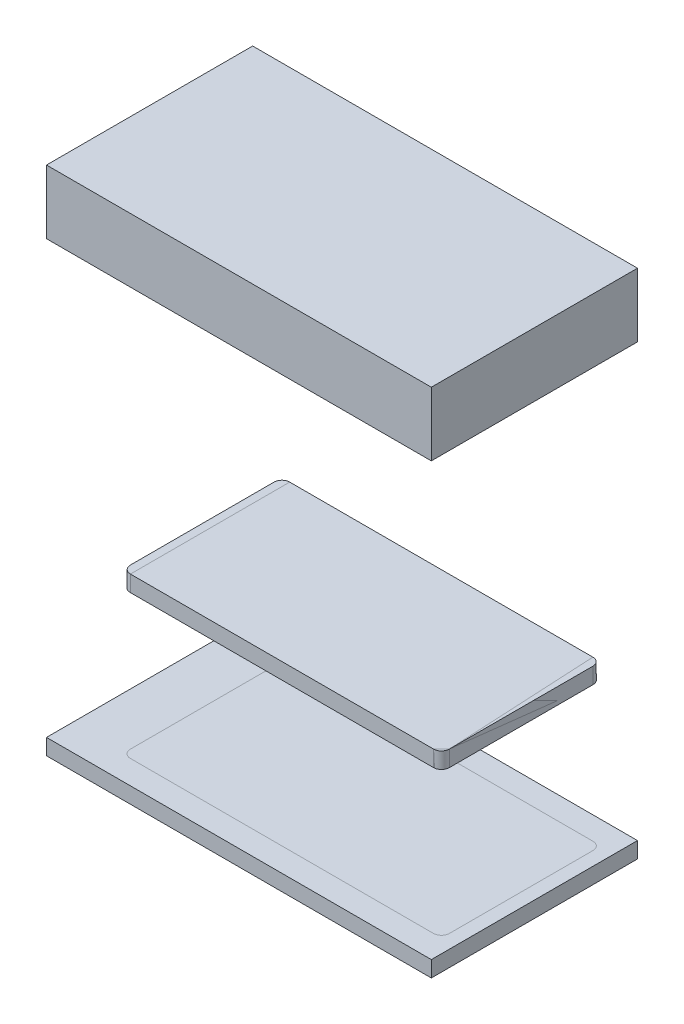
ISO-10303-21;
HEADER;
FILE_DESCRIPTION(('STEP AP214'),'2;1');
FILE_NAME('part.step','',(''),(''),'','','');
FILE_SCHEMA(('AUTOMOTIVE_DESIGN { 1 0 10303 214 1 1 1 1 }'));
ENDSEC;
DATA;
#1=APPLICATION_CONTEXT('core data for automotive mechanical design processes');
#2=APPLICATION_PROTOCOL_DEFINITION('international standard','automotive_design',2000,#1);
#3=PRODUCT_CONTEXT('',#1,'mechanical');
#4=PRODUCT('Part','Part','',(#3));
#5=PRODUCT_RELATED_PRODUCT_CATEGORY('part','',(#4));
#6=PRODUCT_DEFINITION_FORMATION('','',#4);
#7=PRODUCT_DEFINITION_CONTEXT('part definition',#1,'design');
#8=PRODUCT_DEFINITION('design','',#6,#7);
#9=PRODUCT_DEFINITION_SHAPE('','',#8);
#10=(LENGTH_UNIT() NAMED_UNIT(*) SI_UNIT(.MILLI.,.METRE.));
#11=(NAMED_UNIT(*) PLANE_ANGLE_UNIT() SI_UNIT($,.RADIAN.));
#12=(NAMED_UNIT(*) SI_UNIT($,.STERADIAN.) SOLID_ANGLE_UNIT());
#13=UNCERTAINTY_MEASURE_WITH_UNIT(LENGTH_MEASURE(1.E-05),#10,'distance_accuracy_value','');
#14=(GEOMETRIC_REPRESENTATION_CONTEXT(3) GLOBAL_UNCERTAINTY_ASSIGNED_CONTEXT((#13)) GLOBAL_UNIT_ASSIGNED_CONTEXT((#10,
#11,#12)) REPRESENTATION_CONTEXT('',''));
#15=CARTESIAN_POINT('',(0.,0.,0.));
#16=DIRECTION('',(0.,0.,1.));
#17=DIRECTION('',(1.,0.,0.));
#18=AXIS2_PLACEMENT_3D('',#15,#16,#17);
#19=CARTESIAN_POINT('',(0.,-100.,0.));
#20=DIRECTION('',(0.,1.,0.));
#21=DIRECTION('',(0.,0.,1.));
#22=AXIS2_PLACEMENT_3D('',#19,#20,#21);
#23=PLANE('',#22);
#24=DIRECTION('',(0.,0.,-1.));
#25=VECTOR('',#24,1.);
#26=CARTESIAN_POINT('',(577.109459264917,-100.,-513.152738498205));
#27=LINE('',#26,#25);
#28=CARTESIAN_POINT('',(577.109459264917,-100.,-383.952040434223));
#29=VERTEX_POINT('',#28);
#30=CARTESIAN_POINT('',(577.109459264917,-100.,-513.152738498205));
#31=VERTEX_POINT('',#30);
#32=EDGE_CURVE('E754',#29,#31,#27,.T.);
#33=ORIENTED_EDGE('',*,*,#32,.F.);
#34=DIRECTION('',(1.,0.,0.));
#35=VECTOR('',#34,1.);
#36=CARTESIAN_POINT('',(335.935434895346,-100.,-383.952040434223));
#37=LINE('',#36,#35);
#38=CARTESIAN_POINT('',(335.935434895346,-100.,-383.952040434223));
#39=VERTEX_POINT('',#38);
#40=EDGE_CURVE('E767',#39,#29,#37,.T.);
#41=ORIENTED_EDGE('',*,*,#40,.F.);
#42=DIRECTION('',(0.,0.,1.));
#43=VECTOR('',#42,1.);
#44=CARTESIAN_POINT('',(335.935434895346,-100.,-513.152738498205));
#45=LINE('',#44,#43);
#46=CARTESIAN_POINT('',(335.935434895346,-100.,-513.152738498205));
#47=VERTEX_POINT('',#46);
#48=EDGE_CURVE('E756',#47,#39,#45,.T.);
#49=ORIENTED_EDGE('',*,*,#48,.F.);
#50=DIRECTION('',(-1.,0.,0.));
#51=VECTOR('',#50,1.);
#52=CARTESIAN_POINT('',(335.935434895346,-100.,-513.152738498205));
#53=LINE('',#52,#51);
#54=EDGE_CURVE('E745',#31,#47,#53,.T.);
#55=ORIENTED_EDGE('',*,*,#54,.F.);
#56=EDGE_LOOP('',(#33,#41,#49,#55));
#57=FACE_BOUND('',#56,.T.);
#58=ADVANCED_FACE('F671',(#57),#23,.F.);
#59=CARTESIAN_POINT('',(335.935434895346,-50.,-383.952040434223));
#60=DIRECTION('',(0.,0.,-1.));
#61=DIRECTION('',(-1.,0.,0.));
#62=AXIS2_PLACEMENT_3D('',#59,#60,#61);
#63=PLANE('',#62);
#64=DIRECTION('',(0.,-1.,0.));
#65=VECTOR('',#64,1.);
#66=CARTESIAN_POINT('',(577.109459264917,-50.,-383.952040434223));
#67=LINE('',#66,#65);
#68=CARTESIAN_POINT('',(577.109459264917,-90.,-383.952040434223));
#69=VERTEX_POINT('',#68);
#70=EDGE_CURVE('E759',#69,#29,#67,.T.);
#71=ORIENTED_EDGE('',*,*,#70,.F.);
#72=DIRECTION('',(-1.,0.,0.));
#73=VECTOR('',#72,1.);
#74=CARTESIAN_POINT('',(335.935434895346,-90.,-383.952040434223));
#75=LINE('',#74,#73);
#76=CARTESIAN_POINT('',(335.935434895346,-90.,-383.952040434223));
#77=VERTEX_POINT('',#76);
#78=EDGE_CURVE('E675',#69,#77,#75,.T.);
#79=ORIENTED_EDGE('',*,*,#78,.T.);
#80=DIRECTION('',(0.,-1.,0.));
#81=VECTOR('',#80,1.);
#82=CARTESIAN_POINT('',(335.935434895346,-50.,-383.952040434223));
#83=LINE('',#82,#81);
#84=EDGE_CURVE('E770',#77,#39,#83,.T.);
#85=ORIENTED_EDGE('',*,*,#84,.T.);
#86=ORIENTED_EDGE('',*,*,#40,.T.);
#87=EDGE_LOOP('',(#71,#79,#85,#86));
#88=FACE_BOUND('',#87,.T.);
#89=ADVANCED_FACE('F838',(#88),#63,.F.);
#90=CARTESIAN_POINT('',(335.935434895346,-50.,-513.152738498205));
#91=DIRECTION('',(1.,0.,0.));
#92=DIRECTION('',(0.,0.,-1.));
#93=AXIS2_PLACEMENT_3D('',#90,#91,#92);
#94=PLANE('',#93);
#95=ORIENTED_EDGE('',*,*,#84,.F.);
#96=DIRECTION('',(0.,0.,-1.));
#97=VECTOR('',#96,1.);
#98=CARTESIAN_POINT('',(335.935434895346,-90.,-513.152738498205));
#99=LINE('',#98,#97);
#100=CARTESIAN_POINT('',(335.935434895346,-90.,-513.152738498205));
#101=VERTEX_POINT('',#100);
#102=EDGE_CURVE('E776',#77,#101,#99,.T.);
#103=ORIENTED_EDGE('',*,*,#102,.T.);
#104=DIRECTION('',(0.,-1.,0.));
#105=VECTOR('',#104,1.);
#106=CARTESIAN_POINT('',(335.935434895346,-50.,-513.152738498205));
#107=LINE('',#106,#105);
#108=EDGE_CURVE('E750',#101,#47,#107,.T.);
#109=ORIENTED_EDGE('',*,*,#108,.T.);
#110=ORIENTED_EDGE('',*,*,#48,.T.);
#111=EDGE_LOOP('',(#95,#103,#109,#110));
#112=FACE_BOUND('',#111,.T.);
#113=ADVANCED_FACE('F775',(#112),#94,.F.);
#114=CARTESIAN_POINT('',(335.935434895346,-50.,-513.152738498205));
#115=DIRECTION('',(0.,0.,1.));
#116=DIRECTION('',(1.,0.,0.));
#117=AXIS2_PLACEMENT_3D('',#114,#115,#116);
#118=PLANE('',#117);
#119=ORIENTED_EDGE('',*,*,#108,.F.);
#120=DIRECTION('',(1.,0.,0.));
#121=VECTOR('',#120,1.);
#122=CARTESIAN_POINT('',(335.935434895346,-90.,-513.152738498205));
#123=LINE('',#122,#121);
#124=CARTESIAN_POINT('',(577.109459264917,-90.,-513.152738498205));
#125=VERTEX_POINT('',#124);
#126=EDGE_CURVE('E691',#101,#125,#123,.T.);
#127=ORIENTED_EDGE('',*,*,#126,.T.);
#128=DIRECTION('',(0.,-1.,0.));
#129=VECTOR('',#128,1.);
#130=CARTESIAN_POINT('',(577.109459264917,-50.,-513.152738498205));
#131=LINE('',#130,#129);
#132=EDGE_CURVE('E742',#125,#31,#131,.T.);
#133=ORIENTED_EDGE('',*,*,#132,.T.);
#134=ORIENTED_EDGE('',*,*,#54,.T.);
#135=EDGE_LOOP('',(#119,#127,#133,#134));
#136=FACE_BOUND('',#135,.T.);
#137=ADVANCED_FACE('F744',(#136),#118,.F.);
#138=CARTESIAN_POINT('',(577.109459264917,-50.,-513.152738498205));
#139=DIRECTION('',(-1.,0.,0.));
#140=DIRECTION('',(0.,0.,1.));
#141=AXIS2_PLACEMENT_3D('',#138,#139,#140);
#142=PLANE('',#141);
#143=ORIENTED_EDGE('',*,*,#132,.F.);
#144=DIRECTION('',(0.,0.,1.));
#145=VECTOR('',#144,1.);
#146=CARTESIAN_POINT('',(577.109459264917,-90.,-513.152738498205));
#147=LINE('',#146,#145);
#148=EDGE_CURVE('E763',#125,#69,#147,.T.);
#149=ORIENTED_EDGE('',*,*,#148,.T.);
#150=ORIENTED_EDGE('',*,*,#70,.T.);
#151=ORIENTED_EDGE('',*,*,#32,.T.);
#152=EDGE_LOOP('',(#143,#149,#150,#151));
#153=FACE_BOUND('',#152,.T.);
#154=ADVANCED_FACE('F673',(#153),#142,.F.);
#155=CARTESIAN_POINT('',(373.58203197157,-90.,-398.813583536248));
#156=DIRECTION('',(0.,-1.,0.));
#157=DIRECTION('',(1.,0.,0.));
#158=AXIS2_PLACEMENT_3D('',#155,#156,#157);
#159=PLANE('',#158);
#160=DIRECTION('',(-1.,0.,0.));
#161=VECTOR('',#160,1.);
#162=CARTESIAN_POINT('',(563.582222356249,-90.,-498.813583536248));
#163=LINE('',#162,#161);
#164=CARTESIAN_POINT('',(563.582222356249,-90.,-498.813583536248));
#165=VERTEX_POINT('',#164);
#166=CARTESIAN_POINT('',(373.58203197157,-90.,-498.813583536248));
#167=VERTEX_POINT('',#166);
#168=EDGE_CURVE('E830',#165,#167,#163,.T.);
#169=ORIENTED_EDGE('',*,*,#168,.F.);
#170=CARTESIAN_POINT('',(568.58203197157,-90.,-493.813773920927));
#171=CARTESIAN_POINT('',(568.582031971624,-90.,-494.303840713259));
#172=CARTESIAN_POINT('',(568.485900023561,-90.,-494.787990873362));
#173=CARTESIAN_POINT('',(568.389645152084,-90.,-495.272760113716));
#174=CARTESIAN_POINT('',(568.201313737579,-90.,-495.72747973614));
#175=CARTESIAN_POINT('',(568.014381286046,-90.,-496.178821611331));
#176=CARTESIAN_POINT('',(567.74099144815,-90.,-496.588649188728));
#177=CARTESIAN_POINT('',(567.466590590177,-90.,-496.999992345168));
#178=CARTESIAN_POINT('',(567.118583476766,-90.,-497.348257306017));
#179=CARTESIAN_POINT('',(566.773102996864,-90.,-497.693993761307));
#180=CARTESIAN_POINT('',(566.36353488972,-90.,-497.968240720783));
#181=CARTESIAN_POINT('',(565.953400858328,-90.,-498.24286662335));
#182=CARTESIAN_POINT('',(565.499456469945,-90.,-498.431401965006));
#183=CARTESIAN_POINT('',(565.046571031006,-90.,-498.619497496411));
#184=CARTESIAN_POINT('',(564.561628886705,-90.,-498.716417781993));
#185=CARTESIAN_POINT('',(564.075458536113,-90.,-498.813583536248));
#186=CARTESIAN_POINT('',(563.582222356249,-90.,-498.813583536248));
#187=B_SPLINE_CURVE_WITH_KNOTS('',2,(#170,#171,#172,#173,#174,#175,#176,#177,#178,#179,#180,
#181,#182,#183,#184,#185,#186),.UNSPECIFIED.,.F.,.F.,(3,2,2,2,2,2,2,2,3),(0.,0.125,0.25,0.375,
0.5,0.625,0.75,0.875,1.),.UNSPECIFIED.);
#188=CARTESIAN_POINT('',(568.58203197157,-90.,-493.813773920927));
#189=VERTEX_POINT('',#188);
#190=EDGE_CURVE('E14',#189,#165,#187,.T.);
#191=ORIENTED_EDGE('',*,*,#190,.F.);
#192=DIRECTION('',(0.,0.,-1.));
#193=VECTOR('',#192,1.);
#194=CARTESIAN_POINT('',(568.58203197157,-90.,-403.813393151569));
#195=LINE('',#194,#193);
#196=CARTESIAN_POINT('',(568.58203197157,-90.,-403.813393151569));
#197=VERTEX_POINT('',#196);
#198=EDGE_CURVE('E682',#197,#189,#195,.T.);
#199=ORIENTED_EDGE('',*,*,#198,.F.);
#200=CARTESIAN_POINT('',(563.582222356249,-90.,-398.813583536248));
#201=CARTESIAN_POINT('',(564.072289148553,-90.,-398.813583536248));
#202=CARTESIAN_POINT('',(564.556439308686,-90.,-398.909715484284));
#203=CARTESIAN_POINT('',(565.04120854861,-90.,-399.005970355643));
#204=CARTESIAN_POINT('',(565.495928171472,-90.,-399.194301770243));
#205=CARTESIAN_POINT('',(565.947270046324,-90.,-399.381234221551));
#206=CARTESIAN_POINT('',(566.357097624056,-90.,-399.65462405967));
#207=CARTESIAN_POINT('',(566.768440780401,-90.,-399.929024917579));
#208=CARTESIAN_POINT('',(567.116705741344,-90.,-400.277032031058));
#209=CARTESIAN_POINT('',(567.462442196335,-90.,-400.622512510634));
#210=CARTESIAN_POINT('',(567.73668915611,-90.,-401.032080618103));
#211=CARTESIAN_POINT('',(568.011315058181,-90.,-401.442214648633));
#212=CARTESIAN_POINT('',(568.199850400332,-90.,-401.896159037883));
#213=CARTESIAN_POINT('',(568.387945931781,-90.,-402.349044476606));
#214=CARTESIAN_POINT('',(568.484866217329,-90.,-402.833986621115));
#215=CARTESIAN_POINT('',(568.582031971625,-90.,-403.320156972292));
#216=CARTESIAN_POINT('',(568.58203197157,-90.,-403.813393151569));
#217=B_SPLINE_CURVE_WITH_KNOTS('',2,(#200,#201,#202,#203,#204,#205,#206,#207,#208,#209,#210,
#211,#212,#213,#214,#215,#216),.UNSPECIFIED.,.F.,.F.,(3,2,2,2,2,2,2,2,3),(0.,0.125,0.25,0.375,
0.5,0.625,0.75,0.875,1.),.UNSPECIFIED.);
#218=CARTESIAN_POINT('',(563.582222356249,-90.,-398.813583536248));
#219=VERTEX_POINT('',#218);
#220=EDGE_CURVE('E806',#219,#197,#217,.T.);
#221=ORIENTED_EDGE('',*,*,#220,.F.);
#222=DIRECTION('',(1.,0.,0.));
#223=VECTOR('',#222,1.);
#224=CARTESIAN_POINT('',(373.58203197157,-90.,-398.813583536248));
#225=LINE('',#224,#223);
#226=CARTESIAN_POINT('',(373.58203197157,-90.,-398.813583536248));
#227=VERTEX_POINT('',#226);
#228=EDGE_CURVE('E809',#227,#219,#225,.T.);
#229=ORIENTED_EDGE('',*,*,#228,.F.);
#230=CARTESIAN_POINT('',(368.58203197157,-90.,-403.813773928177));
#231=CARTESIAN_POINT('',(368.582031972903,-90.,-403.323684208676));
#232=CARTESIAN_POINT('',(368.678169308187,-90.,-402.83950449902));
#233=CARTESIAN_POINT('',(368.774428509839,-90.,-402.354711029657));
#234=CARTESIAN_POINT('',(368.962766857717,-90.,-401.899963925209));
#235=CARTESIAN_POINT('',(369.149705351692,-90.,-401.448596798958));
#236=CARTESIAN_POINT('',(369.423102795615,-90.,-401.038741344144));
#237=CARTESIAN_POINT('',(369.697511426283,-90.,-400.627369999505));
#238=CARTESIAN_POINT('',(370.045526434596,-90.,-400.279077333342));
#239=CARTESIAN_POINT('',(370.391016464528,-90.,-399.933311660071));
#240=CARTESIAN_POINT('',(370.800594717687,-90.,-399.659037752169));
#241=CARTESIAN_POINT('',(371.210745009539,-90.,-399.384380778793));
#242=CARTESIAN_POINT('',(371.664704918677,-90.,-399.195821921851));
#243=CARTESIAN_POINT('',(372.117610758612,-90.,-399.007700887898));
#244=CARTESIAN_POINT('',(372.602571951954,-90.,-398.91076602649));
#245=CARTESIAN_POINT('',(373.088772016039,-90.,-398.813583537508));
#246=CARTESIAN_POINT('',(373.58203197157,-90.,-398.813583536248));
#247=B_SPLINE_CURVE_WITH_KNOTS('',2,(#230,#231,#232,#233,#234,#235,#236,#237,#238,#239,#240,
#241,#242,#243,#244,#245,#246),.UNSPECIFIED.,.F.,.F.,(3,2,2,2,2,2,2,2,3),(0.,0.125,0.25,0.375,
0.5,0.625,0.75,0.875,1.),.UNSPECIFIED.);
#248=CARTESIAN_POINT('',(368.58203197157,-90.,-403.813773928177));
#249=VERTEX_POINT('',#248);
#250=EDGE_CURVE('E717',#249,#227,#247,.T.);
#251=ORIENTED_EDGE('',*,*,#250,.F.);
#252=DIRECTION('',(0.,0.,1.));
#253=VECTOR('',#252,1.);
#254=CARTESIAN_POINT('',(368.58203197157,-90.,-493.81339314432));
#255=LINE('',#254,#253);
#256=CARTESIAN_POINT('',(368.58203197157,-90.,-493.81339314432));
#257=VERTEX_POINT('',#256);
#258=EDGE_CURVE('E713',#257,#249,#255,.T.);
#259=ORIENTED_EDGE('',*,*,#258,.F.);
#260=CARTESIAN_POINT('',(373.58203197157,-90.,-498.813583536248));
#261=CARTESIAN_POINT('',(373.091942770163,-90.,-498.81358353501));
#262=CARTESIAN_POINT('',(372.607764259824,-90.,-498.71743550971));
#263=CARTESIAN_POINT('',(372.122974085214,-90.,-498.621166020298));
#264=CARTESIAN_POINT('',(371.668232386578,-90.,-498.432808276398));
#265=CARTESIAN_POINT('',(371.216875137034,-90.,-498.245852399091));
#266=CARTESIAN_POINT('',(370.807031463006,-90.,-497.972431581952));
#267=CARTESIAN_POINT('',(370.395677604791,-90.,-497.698003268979));
#268=CARTESIAN_POINT('',(370.047402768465,-90.,-497.349966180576));
#269=CARTESIAN_POINT('',(369.701657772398,-90.,-497.004457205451));
#270=CARTESIAN_POINT('',(369.427402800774,-90.,-496.594859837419));
#271=CARTESIAN_POINT('',(369.152770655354,-90.,-496.184699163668));
#272=CARTESIAN_POINT('',(368.964230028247,-90.,-495.730731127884));
#273=CARTESIAN_POINT('',(368.776127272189,-90.,-495.277817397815));
#274=CARTESIAN_POINT('',(368.679202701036,-90.,-494.792850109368));
#275=CARTESIAN_POINT('',(368.582031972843,-90.,-494.30665116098));
#276=CARTESIAN_POINT('',(368.58203197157,-90.,-493.81339314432));
#277=B_SPLINE_CURVE_WITH_KNOTS('',2,(#260,#261,#262,#263,#264,#265,#266,#267,#268,#269,#270,
#271,#272,#273,#274,#275,#276),.UNSPECIFIED.,.F.,.F.,(3,2,2,2,2,2,2,2,3),(0.,0.125,0.25,0.375,
0.5,0.625,0.75,0.875,1.),.UNSPECIFIED.);
#278=EDGE_CURVE('E709',#167,#257,#277,.T.);
#279=ORIENTED_EDGE('',*,*,#278,.F.);
#280=EDGE_LOOP('',(#169,#191,#199,#221,#229,#251,#259,#279));
#281=FACE_BOUND('',#280,.T.);
#282=ORIENTED_EDGE('',*,*,#126,.F.);
#283=ORIENTED_EDGE('',*,*,#102,.F.);
#284=ORIENTED_EDGE('',*,*,#78,.F.);
#285=ORIENTED_EDGE('',*,*,#148,.F.);
#286=EDGE_LOOP('',(#282,#283,#284,#285));
#287=FACE_BOUND('',#286,.T.);
#288=ADVANCED_FACE('F783',(#281,#287),#159,.F.);
#289=CARTESIAN_POINT('',(563.581841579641,-90.,-493.81339314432));
#290=DIRECTION('',(0.,1.,0.));
#291=DIRECTION('',(0.,0.,1.));
#292=AXIS2_PLACEMENT_3D('',#289,#290,#291);
#293=PLANE('',#292);
#294=ORIENTED_EDGE('',*,*,#190,.T.);
#295=ORIENTED_EDGE('',*,*,#168,.T.);
#296=ORIENTED_EDGE('',*,*,#278,.T.);
#297=ORIENTED_EDGE('',*,*,#258,.T.);
#298=ORIENTED_EDGE('',*,*,#250,.T.);
#299=ORIENTED_EDGE('',*,*,#228,.T.);
#300=ORIENTED_EDGE('',*,*,#220,.T.);
#301=ORIENTED_EDGE('',*,*,#198,.T.);
#302=EDGE_LOOP('',(#294,#295,#296,#297,#298,#299,#300,#301));
#303=FACE_BOUND('',#302,.T.);
#304=ADVANCED_FACE('F793',(#303),#293,.T.);
#305=CLOSED_SHELL('',(#58,#89,#113,#137,#154,#288,#304));
#306=MANIFOLD_SOLID_BREP('B2',#305);
#307=CARTESIAN_POINT('',(577.109459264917,220.649160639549,-513.152738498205));
#308=DIRECTION('',(-1.,0.,0.));
#309=DIRECTION('',(0.,0.,1.));
#310=AXIS2_PLACEMENT_3D('',#307,#308,#309);
#311=PLANE('',#310);
#312=DIRECTION('',(0.,0.,1.));
#313=VECTOR('',#312,1.);
#314=CARTESIAN_POINT('',(577.109459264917,180.649160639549,-513.152738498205));
#315=LINE('',#314,#313);
#316=CARTESIAN_POINT('',(577.109459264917,180.649160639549,-513.152738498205));
#317=VERTEX_POINT('',#316);
#318=CARTESIAN_POINT('',(577.109459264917,180.649160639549,-383.952040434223));
#319=VERTEX_POINT('',#318);
#320=EDGE_CURVE('E1096',#317,#319,#315,.T.);
#321=ORIENTED_EDGE('',*,*,#320,.F.);
#322=DIRECTION('',(0.,-1.,0.));
#323=VECTOR('',#322,1.);
#324=CARTESIAN_POINT('',(577.109459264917,220.649160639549,-513.152738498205));
#325=LINE('',#324,#323);
#326=CARTESIAN_POINT('',(577.109459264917,220.649160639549,-513.152738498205));
#327=VERTEX_POINT('',#326);
#328=EDGE_CURVE('E1079',#327,#317,#325,.T.);
#329=ORIENTED_EDGE('',*,*,#328,.F.);
#330=DIRECTION('',(0.,0.,-1.));
#331=VECTOR('',#330,1.);
#332=CARTESIAN_POINT('',(577.109459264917,220.649160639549,-513.152738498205));
#333=LINE('',#332,#331);
#334=CARTESIAN_POINT('',(577.109459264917,220.649160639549,-383.952040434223));
#335=VERTEX_POINT('',#334);
#336=EDGE_CURVE('E1085',#335,#327,#333,.T.);
#337=ORIENTED_EDGE('',*,*,#336,.F.);
#338=DIRECTION('',(0.,-1.,0.));
#339=VECTOR('',#338,1.);
#340=CARTESIAN_POINT('',(577.109459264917,220.649160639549,-383.952040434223));
#341=LINE('',#340,#339);
#342=EDGE_CURVE('E1105',#335,#319,#341,.T.);
#343=ORIENTED_EDGE('',*,*,#342,.T.);
#344=EDGE_LOOP('',(#321,#329,#337,#343));
#345=FACE_BOUND('',#344,.T.);
#346=ADVANCED_FACE('F989',(#345),#311,.F.);
#347=CARTESIAN_POINT('',(335.935434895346,220.649160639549,-513.152738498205));
#348=DIRECTION('',(0.,0.,1.));
#349=DIRECTION('',(1.,0.,0.));
#350=AXIS2_PLACEMENT_3D('',#347,#348,#349);
#351=PLANE('',#350);
#352=DIRECTION('',(1.,0.,0.));
#353=VECTOR('',#352,1.);
#354=CARTESIAN_POINT('',(335.935434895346,180.649160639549,-513.152738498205));
#355=LINE('',#354,#353);
#356=CARTESIAN_POINT('',(335.935434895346,180.649160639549,-513.152738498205));
#357=VERTEX_POINT('',#356);
#358=EDGE_CURVE('E1098',#357,#317,#355,.T.);
#359=ORIENTED_EDGE('',*,*,#358,.F.);
#360=DIRECTION('',(0.,-1.,0.));
#361=VECTOR('',#360,1.);
#362=CARTESIAN_POINT('',(335.935434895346,220.649160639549,-513.152738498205));
#363=LINE('',#362,#361);
#364=CARTESIAN_POINT('',(335.935434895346,220.649160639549,-513.152738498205));
#365=VERTEX_POINT('',#364);
#366=EDGE_CURVE('E1081',#365,#357,#363,.T.);
#367=ORIENTED_EDGE('',*,*,#366,.F.);
#368=DIRECTION('',(-1.,0.,0.));
#369=VECTOR('',#368,1.);
#370=CARTESIAN_POINT('',(335.935434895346,220.649160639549,-513.152738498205));
#371=LINE('',#370,#369);
#372=EDGE_CURVE('E1074',#327,#365,#371,.T.);
#373=ORIENTED_EDGE('',*,*,#372,.F.);
#374=ORIENTED_EDGE('',*,*,#328,.T.);
#375=EDGE_LOOP('',(#359,#367,#373,#374));
#376=FACE_BOUND('',#375,.T.);
#377=ADVANCED_FACE('F1077',(#376),#351,.F.);
#378=CARTESIAN_POINT('',(335.935434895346,220.649160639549,-513.152738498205));
#379=DIRECTION('',(1.,0.,0.));
#380=DIRECTION('',(0.,0.,-1.));
#381=AXIS2_PLACEMENT_3D('',#378,#379,#380);
#382=PLANE('',#381);
#383=DIRECTION('',(0.,0.,-1.));
#384=VECTOR('',#383,1.);
#385=CARTESIAN_POINT('',(335.935434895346,180.649160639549,-513.152738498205));
#386=LINE('',#385,#384);
#387=CARTESIAN_POINT('',(335.935434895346,180.649160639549,-383.952040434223));
#388=VERTEX_POINT('',#387);
#389=EDGE_CURVE('E1097',#388,#357,#386,.T.);
#390=ORIENTED_EDGE('',*,*,#389,.F.);
#391=DIRECTION('',(0.,-1.,0.));
#392=VECTOR('',#391,1.);
#393=CARTESIAN_POINT('',(335.935434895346,220.649160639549,-383.952040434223));
#394=LINE('',#393,#392);
#395=CARTESIAN_POINT('',(335.935434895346,220.649160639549,-383.952040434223));
#396=VERTEX_POINT('',#395);
#397=EDGE_CURVE('E1100',#396,#388,#394,.T.);
#398=ORIENTED_EDGE('',*,*,#397,.F.);
#399=DIRECTION('',(0.,0.,1.));
#400=VECTOR('',#399,1.);
#401=CARTESIAN_POINT('',(335.935434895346,220.649160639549,-513.152738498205));
#402=LINE('',#401,#400);
#403=EDGE_CURVE('E1084',#365,#396,#402,.T.);
#404=ORIENTED_EDGE('',*,*,#403,.F.);
#405=ORIENTED_EDGE('',*,*,#366,.T.);
#406=EDGE_LOOP('',(#390,#398,#404,#405));
#407=FACE_BOUND('',#406,.T.);
#408=ADVANCED_FACE('F1292',(#407),#382,.F.);
#409=CARTESIAN_POINT('',(335.935434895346,220.649160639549,-383.952040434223));
#410=DIRECTION('',(0.,0.,-1.));
#411=DIRECTION('',(-1.,0.,0.));
#412=AXIS2_PLACEMENT_3D('',#409,#410,#411);
#413=PLANE('',#412);
#414=DIRECTION('',(-1.,0.,0.));
#415=VECTOR('',#414,1.);
#416=CARTESIAN_POINT('',(335.935434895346,180.649160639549,-383.952040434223));
#417=LINE('',#416,#415);
#418=EDGE_CURVE('E992',#319,#388,#417,.T.);
#419=ORIENTED_EDGE('',*,*,#418,.F.);
#420=ORIENTED_EDGE('',*,*,#342,.F.);
#421=DIRECTION('',(1.,0.,0.));
#422=VECTOR('',#421,1.);
#423=CARTESIAN_POINT('',(335.935434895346,220.649160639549,-383.952040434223));
#424=LINE('',#423,#422);
#425=EDGE_CURVE('E1090',#396,#335,#424,.T.);
#426=ORIENTED_EDGE('',*,*,#425,.F.);
#427=ORIENTED_EDGE('',*,*,#397,.T.);
#428=EDGE_LOOP('',(#419,#420,#426,#427));
#429=FACE_BOUND('',#428,.T.);
#430=ADVANCED_FACE('F1296',(#429),#413,.F.);
#431=CARTESIAN_POINT('',(0.,220.649160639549,0.));
#432=DIRECTION('',(0.,1.,0.));
#433=DIRECTION('',(0.,0.,1.));
#434=AXIS2_PLACEMENT_3D('',#431,#432,#433);
#435=PLANE('',#434);
#436=ORIENTED_EDGE('',*,*,#336,.T.);
#437=ORIENTED_EDGE('',*,*,#372,.T.);
#438=ORIENTED_EDGE('',*,*,#403,.T.);
#439=ORIENTED_EDGE('',*,*,#425,.T.);
#440=EDGE_LOOP('',(#436,#437,#438,#439));
#441=FACE_BOUND('',#440,.T.);
#442=ADVANCED_FACE('F1088',(#441),#435,.T.);
#443=CARTESIAN_POINT('',(373.58203197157,180.649160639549,-398.813583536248));
#444=DIRECTION('',(0.,-1.,0.));
#445=DIRECTION('',(1.,0.,0.));
#446=AXIS2_PLACEMENT_3D('',#443,#444,#445);
#447=PLANE('',#446);
#448=DIRECTION('',(-1.,0.,0.));
#449=VECTOR('',#448,1.);
#450=CARTESIAN_POINT('',(563.582222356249,180.649160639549,-498.813583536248));
#451=LINE('',#450,#449);
#452=CARTESIAN_POINT('',(563.582222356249,180.649160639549,-498.813583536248));
#453=VERTEX_POINT('',#452);
#454=CARTESIAN_POINT('',(373.58203197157,180.649160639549,-498.813583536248));
#455=VERTEX_POINT('',#454);
#456=EDGE_CURVE('E1122',#453,#455,#451,.T.);
#457=ORIENTED_EDGE('',*,*,#456,.T.);
#458=CARTESIAN_POINT('',(373.58203197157,180.649160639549,-498.813583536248));
#459=CARTESIAN_POINT('',(373.441528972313,180.649160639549,-498.813583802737));
#460=CARTESIAN_POINT('',(373.301036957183,180.649160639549,-498.807588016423));
#461=CARTESIAN_POINT('',(373.021046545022,180.649160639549,-498.783795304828));
#462=CARTESIAN_POINT('',(372.881548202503,180.649160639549,-498.765997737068));
#463=CARTESIAN_POINT('',(372.604644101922,180.649160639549,-498.718811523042));
#464=CARTESIAN_POINT('',(372.46723674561,180.649160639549,-498.689432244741));
#465=CARTESIAN_POINT('',(372.195366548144,180.649160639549,-498.619282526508));
#466=CARTESIAN_POINT('',(372.060903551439,180.649160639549,-498.578512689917));
#467=CARTESIAN_POINT('',(371.79582019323,180.649160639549,-498.485723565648));
#468=CARTESIAN_POINT('',(371.66520223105,180.649160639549,-498.433697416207));
#469=CARTESIAN_POINT('',(371.408859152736,180.649160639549,-498.318729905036));
#470=CARTESIAN_POINT('',(371.283134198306,180.649160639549,-498.255788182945));
#471=CARTESIAN_POINT('',(371.037431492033,180.649160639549,-498.119602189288));
#472=CARTESIAN_POINT('',(370.917452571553,180.649160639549,-498.046360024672));
#473=CARTESIAN_POINT('',(370.684038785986,180.649160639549,-497.890100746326));
#474=CARTESIAN_POINT('',(370.570603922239,180.649160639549,-497.807083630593));
#475=CARTESIAN_POINT('',(370.350995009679,180.649160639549,-497.631754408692));
#476=CARTESIAN_POINT('',(370.24482728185,180.649160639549,-497.539434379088));
#477=CARTESIAN_POINT('',(370.040734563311,180.649160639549,-497.346100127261));
#478=CARTESIAN_POINT('',(369.942809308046,180.649160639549,-497.245086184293));
#479=CARTESIAN_POINT('',(369.755840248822,180.649160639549,-497.035112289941));
#480=CARTESIAN_POINT('',(369.666797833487,180.649160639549,-496.926151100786));
#481=CARTESIAN_POINT('',(369.498164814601,180.649160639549,-496.701185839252));
#482=CARTESIAN_POINT('',(369.418574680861,180.649160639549,-496.585181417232));
#483=CARTESIAN_POINT('',(369.194926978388,180.649160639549,-496.227957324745));
#484=CARTESIAN_POINT('',(369.065697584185,180.649160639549,-495.977194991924));
#485=CARTESIAN_POINT('',(368.851730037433,180.649160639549,-495.457584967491));
#486=CARTESIAN_POINT('',(368.766966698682,180.649160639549,-495.188747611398));
#487=CARTESIAN_POINT('',(368.664369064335,180.649160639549,-494.734163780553));
#488=CARTESIAN_POINT('',(368.633578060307,180.649160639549,-494.551238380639));
#489=CARTESIAN_POINT('',(368.592430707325,180.649160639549,-494.183371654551));
#490=CARTESIAN_POINT('',(368.58204520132,180.649160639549,-493.998433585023));
#491=CARTESIAN_POINT('',(368.58203197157,180.649160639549,-493.81339314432));
#492=B_SPLINE_CURVE_WITH_KNOTS('',3,(#458,#459,#460,#461,#462,#463,#464,#465,#466,#467,#468,
#469,#470,#471,#472,#473,#474,#475,#476,#477,#478,#479,#480,#481,#482,#483,#484,#485,#486,#487,
#488,#489,#490,#491),.UNSPECIFIED.,.F.,.F.,(4,2,2,2,2,2,2,2,2,2,2,2,2,2,2,2,4),(0.,
0.421366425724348,0.842755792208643,1.26380501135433,1.68483193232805,2.10611623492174,
2.52741444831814,2.94862661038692,3.36983885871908,3.7914129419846,4.21297348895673,
4.63459983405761,5.05624712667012,5.89822709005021,6.73972962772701,7.29516876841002,
7.84981367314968),.UNSPECIFIED.);
#493=CARTESIAN_POINT('',(368.58203197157,180.649160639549,-493.81339314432));
#494=VERTEX_POINT('',#493);
#495=EDGE_CURVE('E1123',#455,#494,#492,.T.);
#496=ORIENTED_EDGE('',*,*,#495,.T.);
#497=DIRECTION('',(0.,0.,1.));
#498=VECTOR('',#497,1.);
#499=CARTESIAN_POINT('',(368.58203197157,180.649160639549,-493.81339314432));
#500=LINE('',#499,#498);
#501=CARTESIAN_POINT('',(368.58203197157,180.649160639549,-403.813773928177));
#502=VERTEX_POINT('',#501);
#503=EDGE_CURVE('E1214',#494,#502,#500,.T.);
#504=ORIENTED_EDGE('',*,*,#503,.T.);
#505=CARTESIAN_POINT('',(368.58203197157,180.649160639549,-403.813773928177));
#506=CARTESIAN_POINT('',(368.582031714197,180.649160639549,-403.673257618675));
#507=CARTESIAN_POINT('',(368.588027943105,180.649160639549,-403.532752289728));
#508=CARTESIAN_POINT('',(368.611822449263,180.649160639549,-403.252735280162));
#509=CARTESIAN_POINT('',(368.629621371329,180.649160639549,-403.113223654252));
#510=CARTESIAN_POINT('',(368.676811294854,180.649160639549,-402.836292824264));
#511=CARTESIAN_POINT('',(368.706192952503,180.649160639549,-402.69887202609));
#512=CARTESIAN_POINT('',(368.776348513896,180.649160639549,-402.426975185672));
#513=CARTESIAN_POINT('',(368.817121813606,180.649160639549,-402.2924989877));
#514=CARTESIAN_POINT('',(368.909919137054,180.649160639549,-402.02738950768));
#515=CARTESIAN_POINT('',(368.961950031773,180.649160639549,-401.896758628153));
#516=CARTESIAN_POINT('',(369.076928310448,180.649160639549,-401.640390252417));
#517=CARTESIAN_POINT('',(369.139876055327,180.649160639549,-401.514652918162));
#518=CARTESIAN_POINT('',(369.276075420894,180.649160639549,-401.268926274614));
#519=CARTESIAN_POINT('',(369.349324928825,180.649160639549,-401.148935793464));
#520=CARTESIAN_POINT('',(369.505600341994,180.649160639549,-400.915499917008));
#521=CARTESIAN_POINT('',(369.588626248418,180.649160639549,-400.802054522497));
#522=CARTESIAN_POINT('',(369.763971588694,180.649160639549,-400.582429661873));
#523=CARTESIAN_POINT('',(369.856298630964,180.649160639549,-400.476256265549));
#524=CARTESIAN_POINT('',(370.049647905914,180.649160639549,-400.272153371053));
#525=CARTESIAN_POINT('',(370.150669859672,180.649160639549,-400.174223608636));
#526=CARTESIAN_POINT('',(370.360660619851,180.649160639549,-399.987246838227));
#527=CARTESIAN_POINT('',(370.469630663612,180.649160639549,-399.89820121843));
#528=CARTESIAN_POINT('',(370.694614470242,180.649160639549,-399.729563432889));
#529=CARTESIAN_POINT('',(370.810628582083,180.649160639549,-399.649971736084));
#530=CARTESIAN_POINT('',(371.167865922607,180.649160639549,-399.426333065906));
#531=CARTESIAN_POINT('',(371.418631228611,180.649160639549,-399.29711447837));
#532=CARTESIAN_POINT('',(371.938246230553,180.649160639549,-399.083172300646));
#533=CARTESIAN_POINT('',(372.207085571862,180.649160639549,-398.998423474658));
#534=CARTESIAN_POINT('',(372.661604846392,180.649160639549,-398.895868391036));
#535=CARTESIAN_POINT('',(372.844462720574,180.649160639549,-398.865096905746));
#536=CARTESIAN_POINT('',(373.212192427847,180.649160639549,-398.823975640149));
#537=CARTESIAN_POINT('',(373.397061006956,180.649160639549,-398.813596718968));
#538=CARTESIAN_POINT('',(373.58203197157,180.649160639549,-398.813583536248));
#539=B_SPLINE_CURVE_WITH_KNOTS('',3,(#505,#506,#507,#508,#509,#510,#511,#512,#513,#514,#515,
#516,#517,#518,#519,#520,#521,#522,#523,#524,#525,#526,#527,#528,#529,#530,#531,#532,#533,#534,
#535,#536,#537,#538),.UNSPECIFIED.,.F.,.F.,(4,2,2,2,2,2,2,2,2,2,2,2,2,2,2,2,4),(0.,
0.421406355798,0.842835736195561,1.26392584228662,1.68499362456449,2.1063191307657,
2.527658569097,2.94891172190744,3.37016492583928,3.79176556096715,4.21335267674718,
4.63500556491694,5.05667935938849,5.8986519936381,6.74014630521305,7.29537699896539,
7.84981369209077),.UNSPECIFIED.);
#540=CARTESIAN_POINT('',(373.58203197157,180.649160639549,-398.813583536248));
#541=VERTEX_POINT('',#540);
#542=EDGE_CURVE('E1206',#502,#541,#539,.T.);
#543=ORIENTED_EDGE('',*,*,#542,.T.);
#544=DIRECTION('',(1.,0.,0.));
#545=VECTOR('',#544,1.);
#546=CARTESIAN_POINT('',(373.58203197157,180.649160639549,-398.813583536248));
#547=LINE('',#546,#545);
#548=CARTESIAN_POINT('',(563.582222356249,180.649160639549,-398.813583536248));
#549=VERTEX_POINT('',#548);
#550=EDGE_CURVE('E1215',#541,#549,#547,.T.);
#551=ORIENTED_EDGE('',*,*,#550,.T.);
#552=CARTESIAN_POINT('',(563.582222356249,180.649160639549,-398.813583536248));
#553=CARTESIAN_POINT('',(563.722727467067,180.649160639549,-398.81358326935));
#554=CARTESIAN_POINT('',(563.863221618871,180.649160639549,-398.819578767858));
#555=CARTESIAN_POINT('',(564.143216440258,180.649160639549,-398.843370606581));
#556=CARTESIAN_POINT('',(564.282717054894,180.649160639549,-398.861167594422));
#557=CARTESIAN_POINT('',(564.559626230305,180.649160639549,-398.908352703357));
#558=CARTESIAN_POINT('',(564.697036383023,180.649160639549,-398.937731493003));
#559=CARTESIAN_POINT('',(564.96891217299,180.649160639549,-399.00788053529));
#560=CARTESIAN_POINT('',(565.103377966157,180.649160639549,-399.048650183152));
#561=CARTESIAN_POINT('',(565.368467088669,180.649160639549,-399.141439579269));
#562=CARTESIAN_POINT('',(565.499088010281,180.649160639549,-399.193466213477));
#563=CARTESIAN_POINT('',(565.75543672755,180.649160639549,-399.308435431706));
#564=CARTESIAN_POINT('',(565.881164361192,180.649160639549,-399.371378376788));
#565=CARTESIAN_POINT('',(566.126871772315,180.649160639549,-399.507567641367));
#566=CARTESIAN_POINT('',(566.246852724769,180.649160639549,-399.580811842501));
#567=CARTESIAN_POINT('',(566.480269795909,180.649160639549,-399.737076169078));
#568=CARTESIAN_POINT('',(566.593705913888,180.649160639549,-399.820096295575));
#569=CARTESIAN_POINT('',(566.813309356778,180.649160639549,-399.99542703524));
#570=CARTESIAN_POINT('',(566.919470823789,180.649160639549,-400.087744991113));
#571=CARTESIAN_POINT('',(567.123550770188,180.649160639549,-400.281075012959));
#572=CARTESIAN_POINT('',(567.221469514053,180.649160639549,-400.382086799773));
#573=CARTESIAN_POINT('',(567.408425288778,180.649160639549,-400.592056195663));
#574=CARTESIAN_POINT('',(567.497460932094,180.649160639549,-400.701015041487));
#575=CARTESIAN_POINT('',(567.666080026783,180.649160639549,-400.925975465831));
#576=CARTESIAN_POINT('',(567.745663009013,180.649160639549,-401.041977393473));
#577=CARTESIAN_POINT('',(567.969280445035,180.649160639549,-401.399180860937));
#578=CARTESIAN_POINT('',(568.098488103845,180.649160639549,-401.64992342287));
#579=CARTESIAN_POINT('',(568.312415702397,180.649160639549,-402.169490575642));
#580=CARTESIAN_POINT('',(568.3971608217,180.649160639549,-402.438304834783));
#581=CARTESIAN_POINT('',(568.499727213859,180.649160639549,-402.892825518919));
#582=CARTESIAN_POINT('',(568.530506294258,180.649160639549,-403.075711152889));
#583=CARTESIAN_POINT('',(568.571637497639,180.649160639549,-403.443496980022));
#584=CARTESIAN_POINT('',(568.58201878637,180.649160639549,-403.628393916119));
#585=CARTESIAN_POINT('',(568.58203197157,180.649160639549,-403.813393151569));
#586=B_SPLINE_CURVE_WITH_KNOTS('',3,(#552,#553,#554,#555,#556,#557,#558,#559,#560,#561,#562,
#563,#564,#565,#566,#567,#568,#569,#570,#571,#572,#573,#574,#575,#576,#577,#578,#579,#580,#581,
#582,#583,#584,#585),.UNSPECIFIED.,.F.,.F.,(4,2,2,2,2,2,2,2,2,2,2,2,2,2,2,2,4),(0.,
0.42137281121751,0.842768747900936,1.26382585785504,1.68486061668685,2.10615365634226,
2.52746063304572,2.94868109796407,3.3699016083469,3.79145741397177,4.21299968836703,
4.63460770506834,5.05623663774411,5.8981343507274,6.73955477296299,7.29487092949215,
7.8493924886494),.UNSPECIFIED.);
#587=CARTESIAN_POINT('',(568.58203197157,180.649160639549,-403.813393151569));
#588=VERTEX_POINT('',#587);
#589=EDGE_CURVE('E1216',#549,#588,#586,.T.);
#590=ORIENTED_EDGE('',*,*,#589,.T.);
#591=DIRECTION('',(0.,0.,-1.));
#592=VECTOR('',#591,1.);
#593=CARTESIAN_POINT('',(568.58203197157,180.649160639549,-403.813393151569));
#594=LINE('',#593,#592);
#595=CARTESIAN_POINT('',(568.58203197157,180.649160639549,-493.813773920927));
#596=VERTEX_POINT('',#595);
#597=EDGE_CURVE('E1121',#588,#596,#594,.T.);
#598=ORIENTED_EDGE('',*,*,#597,.T.);
#599=CARTESIAN_POINT('',(568.58203197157,180.649160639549,-493.813773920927));
#600=CARTESIAN_POINT('',(568.58203223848,180.649160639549,-493.954279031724));
#601=CARTESIAN_POINT('',(568.576036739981,180.649160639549,-494.094773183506));
#602=CARTESIAN_POINT('',(568.552244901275,180.649160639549,-494.374768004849));
#603=CARTESIAN_POINT('',(568.534447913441,180.649160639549,-494.514268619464));
#604=CARTESIAN_POINT('',(568.487262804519,180.649160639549,-494.79117779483));
#605=CARTESIAN_POINT('',(568.457884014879,180.649160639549,-494.928587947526));
#606=CARTESIAN_POINT('',(568.387734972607,180.649160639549,-495.200463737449));
#607=CARTESIAN_POINT('',(568.346965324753,180.649160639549,-495.334929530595));
#608=CARTESIAN_POINT('',(568.25417592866,180.649160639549,-495.600018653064));
#609=CARTESIAN_POINT('',(568.202149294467,180.649160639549,-495.730639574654));
#610=CARTESIAN_POINT('',(568.087180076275,180.649160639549,-495.986988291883));
#611=CARTESIAN_POINT('',(568.024237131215,180.649160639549,-496.112715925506));
#612=CARTESIAN_POINT('',(567.888047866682,180.649160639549,-496.358423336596));
#613=CARTESIAN_POINT('',(567.814803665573,180.649160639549,-496.478404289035));
#614=CARTESIAN_POINT('',(567.658539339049,180.649160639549,-496.711821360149));
#615=CARTESIAN_POINT('',(567.57551921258,180.649160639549,-496.825257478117));
#616=CARTESIAN_POINT('',(567.400188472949,180.649160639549,-497.044860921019));
#617=CARTESIAN_POINT('',(567.307870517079,180.649160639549,-497.151022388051));
#618=CARTESIAN_POINT('',(567.114540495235,180.649160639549,-497.355102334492));
#619=CARTESIAN_POINT('',(567.013528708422,180.649160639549,-497.453021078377));
#620=CARTESIAN_POINT('',(566.80355931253,180.649160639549,-497.639976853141));
#621=CARTESIAN_POINT('',(566.694600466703,180.649160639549,-497.729012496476));
#622=CARTESIAN_POINT('',(566.469640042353,180.649160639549,-497.897631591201));
#623=CARTESIAN_POINT('',(566.353638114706,180.649160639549,-497.977214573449));
#624=CARTESIAN_POINT('',(565.996434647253,180.649160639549,-498.200832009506));
#625=CARTESIAN_POINT('',(565.745692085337,180.649160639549,-498.330039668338));
#626=CARTESIAN_POINT('',(565.226124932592,180.649160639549,-498.54396726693));
#627=CARTESIAN_POINT('',(564.957310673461,180.649160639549,-498.628712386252));
#628=CARTESIAN_POINT('',(564.502789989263,180.649160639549,-498.731278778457));
#629=CARTESIAN_POINT('',(564.319904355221,180.649160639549,-498.762057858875));
#630=CARTESIAN_POINT('',(563.952118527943,180.649160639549,-498.803189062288));
#631=CARTESIAN_POINT('',(563.767221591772,180.649160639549,-498.813570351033));
#632=CARTESIAN_POINT('',(563.582222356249,180.649160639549,-498.813583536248));
#633=B_SPLINE_CURVE_WITH_KNOTS('',3,(#599,#600,#601,#602,#603,#604,#605,#606,#607,#608,#609,
#610,#611,#612,#613,#614,#615,#616,#617,#618,#619,#620,#621,#622,#623,#624,#625,#626,#627,#628,
#629,#630,#631,#632),.UNSPECIFIED.,.F.,.F.,(4,2,2,2,2,2,2,2,2,2,2,2,2,2,2,2,4),(0.,
0.4213728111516,0.842768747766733,1.26382585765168,1.68486061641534,2.10615365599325,
2.52746063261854,2.94868109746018,3.36990160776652,3.79145741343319,4.2129996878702,
4.63460770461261,5.05623663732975,5.89813435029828,6.73955477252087,7.29487092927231,
7.84939248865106),.UNSPECIFIED.);
#634=EDGE_CURVE('E1111',#596,#453,#633,.T.);
#635=ORIENTED_EDGE('',*,*,#634,.T.);
#636=EDGE_LOOP('',(#457,#496,#504,#543,#551,#590,#598,#635));
#637=FACE_BOUND('',#636,.T.);
#638=ORIENTED_EDGE('',*,*,#320,.T.);
#639=ORIENTED_EDGE('',*,*,#418,.T.);
#640=ORIENTED_EDGE('',*,*,#389,.T.);
#641=ORIENTED_EDGE('',*,*,#358,.T.);
#642=EDGE_LOOP('',(#638,#639,#640,#641));
#643=FACE_BOUND('',#642,.T.);
#644=ADVANCED_FACE('F1130',(#637,#643),#447,.T.);
#645=CARTESIAN_POINT('',(563.581841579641,190.649160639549,-493.81339314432));
#646=DIRECTION('',(0.,1.,0.));
#647=DIRECTION('',(0.,0.,1.));
#648=AXIS2_PLACEMENT_3D('',#645,#646,#647);
#649=PLANE('',#648);
#650=CARTESIAN_POINT('',(568.494763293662,190.649160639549,-493.813773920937));
#651=CARTESIAN_POINT('',(568.494763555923,190.649160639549,-493.951835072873));
#652=CARTESIAN_POINT('',(568.488871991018,190.649160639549,-494.089885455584));
#653=CARTESIAN_POINT('',(568.465492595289,190.649160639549,-494.365009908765));
#654=CARTESIAN_POINT('',(568.448004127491,190.649160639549,-494.502083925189));
#655=CARTESIAN_POINT('',(568.401637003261,190.649160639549,-494.774176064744));
#656=CARTESIAN_POINT('',(568.372767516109,190.649160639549,-494.90919575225));
#657=CARTESIAN_POINT('',(568.303834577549,190.649160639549,-495.176341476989));
#658=CARTESIAN_POINT('',(568.263771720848,190.649160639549,-495.308467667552));
#659=CARTESIAN_POINT('',(568.172590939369,190.649160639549,-495.568943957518));
#660=CARTESIAN_POINT('',(568.121466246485,190.649160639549,-495.697291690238));
#661=CARTESIAN_POINT('',(568.008490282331,190.649160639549,-495.949178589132));
#662=CARTESIAN_POINT('',(567.946638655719,190.649160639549,-496.072717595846));
#663=CARTESIAN_POINT('',(567.812810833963,190.649160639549,-496.314147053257));
#664=CARTESIAN_POINT('',(567.740836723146,190.649160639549,-496.432038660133));
#665=CARTESIAN_POINT('',(567.587282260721,190.649160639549,-496.661390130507));
#666=CARTESIAN_POINT('',(567.505701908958,190.649160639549,-496.772849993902));
#667=CARTESIAN_POINT('',(567.333417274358,190.649160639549,-496.988619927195));
#668=CARTESIAN_POINT('',(567.242706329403,190.649160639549,-497.0929246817));
#669=CARTESIAN_POINT('',(567.052742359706,190.649160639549,-497.293434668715));
#670=CARTESIAN_POINT('',(566.953489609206,190.649160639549,-497.389640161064));
#671=CARTESIAN_POINT('',(566.747177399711,190.649160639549,-497.573324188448));
#672=CARTESIAN_POINT('',(566.640116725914,190.649160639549,-497.660801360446));
#673=CARTESIAN_POINT('',(566.419075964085,190.649160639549,-497.826468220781));
#674=CARTESIAN_POINT('',(566.305095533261,190.649160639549,-497.904657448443));
#675=CARTESIAN_POINT('',(565.954117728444,190.649160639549,-498.124357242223));
#676=CARTESIAN_POINT('',(565.707746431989,190.649160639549,-498.25129934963));
#677=CARTESIAN_POINT('',(565.197239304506,190.649160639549,-498.461471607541));
#678=CARTESIAN_POINT('',(564.933113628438,190.649160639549,-498.544726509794));
#679=CARTESIAN_POINT('',(564.486555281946,190.649160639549,-498.645476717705));
#680=CARTESIAN_POINT('',(564.30689438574,190.649160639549,-498.675707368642));
#681=CARTESIAN_POINT('',(563.945594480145,190.649160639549,-498.716105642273));
#682=CARTESIAN_POINT('',(563.763958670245,190.649160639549,-498.726301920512));
#683=CARTESIAN_POINT('',(563.582222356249,190.649160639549,-498.726314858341));
#684=B_SPLINE_CURVE_WITH_KNOTS('',3,(#650,#651,#652,#653,#654,#655,#656,#657,#658,#659,#660,
#661,#662,#663,#664,#665,#666,#667,#668,#669,#670,#671,#672,#673,#674,#675,#676,#677,#678,#679,
#680,#681,#682,#683),.UNSPECIFIED.,.F.,.F.,(4,2,2,2,2,2,2,2,2,2,2,2,2,2,2,2,4),(0.,
0.414043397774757,0.828109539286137,1.24184276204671,1.65555400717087,2.06951909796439,
2.48349790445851,2.89739159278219,3.31128528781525,3.72548319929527,4.13966781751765,
4.55391701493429,4.96818675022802,5.79538959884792,6.62212327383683,7.16764538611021,
7.71238665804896),.UNSPECIFIED.);
#685=CARTESIAN_POINT('',(568.494763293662,190.649160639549,-493.813773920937));
#686=VERTEX_POINT('',#685);
#687=CARTESIAN_POINT('',(563.582222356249,190.649160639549,-498.726314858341));
#688=VERTEX_POINT('',#687);
#689=EDGE_CURVE('E1150',#686,#688,#684,.T.);
#690=ORIENTED_EDGE('',*,*,#689,.F.);
#691=DIRECTION('',(0.,0.,1.));
#692=VECTOR('',#691,1.);
#693=CARTESIAN_POINT('',(568.494763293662,190.649160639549,-403.813393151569));
#694=LINE('',#693,#692);
#695=CARTESIAN_POINT('',(568.494763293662,190.649160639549,-403.813393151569));
#696=VERTEX_POINT('',#695);
#697=EDGE_CURVE('E1158',#696,#686,#694,.F.);
#698=ORIENTED_EDGE('',*,*,#697,.F.);
#699=CARTESIAN_POINT('',(563.582222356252,190.649160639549,-398.900852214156));
#700=CARTESIAN_POINT('',(563.720283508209,190.649160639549,-398.900851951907));
#701=CARTESIAN_POINT('',(563.858333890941,190.649160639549,-398.906743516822));
#702=CARTESIAN_POINT('',(564.133458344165,190.649160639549,-398.930122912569));
#703=CARTESIAN_POINT('',(564.27053236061,190.649160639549,-398.947611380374));
#704=CARTESIAN_POINT('',(564.542624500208,190.649160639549,-398.993978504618));
#705=CARTESIAN_POINT('',(564.677644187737,190.649160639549,-399.022847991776));
#706=CARTESIAN_POINT('',(564.944789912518,190.649160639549,-399.09178093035));
#707=CARTESIAN_POINT('',(565.076916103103,190.649160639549,-399.131843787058));
#708=CARTESIAN_POINT('',(565.337392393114,190.649160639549,-399.223024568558));
#709=CARTESIAN_POINT('',(565.465740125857,190.649160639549,-399.274149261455));
#710=CARTESIAN_POINT('',(565.717627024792,190.649160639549,-399.387125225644));
#711=CARTESIAN_POINT('',(565.841166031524,190.649160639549,-399.448976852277));
#712=CARTESIAN_POINT('',(566.08259548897,190.649160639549,-399.58280467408));
#713=CARTESIAN_POINT('',(566.200487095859,190.649160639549,-399.654778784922));
#714=CARTESIAN_POINT('',(566.42983856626,190.649160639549,-399.808333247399));
#715=CARTESIAN_POINT('',(566.541298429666,190.649160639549,-399.88991359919));
#716=CARTESIAN_POINT('',(566.757068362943,190.649160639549,-400.062198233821));
#717=CARTESIAN_POINT('',(566.861373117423,190.649160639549,-400.152909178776));
#718=CARTESIAN_POINT('',(567.061883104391,190.649160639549,-400.342873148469));
#719=CARTESIAN_POINT('',(567.158088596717,190.649160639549,-400.442125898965));
#720=CARTESIAN_POINT('',(567.341772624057,190.649160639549,-400.64843810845));
#721=CARTESIAN_POINT('',(567.429249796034,190.649160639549,-400.75549878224));
#722=CARTESIAN_POINT('',(567.594916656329,190.649160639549,-400.976539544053));
#723=CARTESIAN_POINT('',(567.673105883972,190.649160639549,-401.090519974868));
#724=CARTESIAN_POINT('',(567.892805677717,190.649160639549,-401.441497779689));
#725=CARTESIAN_POINT('',(568.019747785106,190.649160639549,-401.687869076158));
#726=CARTESIAN_POINT('',(568.229920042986,190.649160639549,-402.198376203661));
#727=CARTESIAN_POINT('',(568.313174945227,190.649160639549,-402.462501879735));
#728=CARTESIAN_POINT('',(568.413925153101,190.649160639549,-402.909060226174));
#729=CARTESIAN_POINT('',(568.444155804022,190.649160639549,-403.088721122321));
#730=CARTESIAN_POINT('',(568.484554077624,190.649160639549,-403.450021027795));
#731=CARTESIAN_POINT('',(568.49475035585,190.649160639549,-403.631656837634));
#732=CARTESIAN_POINT('',(568.494763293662,190.649160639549,-403.813393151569));
#733=B_SPLINE_CURVE_WITH_KNOTS('',3,(#699,#700,#701,#702,#703,#704,#705,#706,#707,#708,#709,
#710,#711,#712,#713,#714,#715,#716,#717,#718,#719,#720,#721,#722,#723,#724,#725,#726,#727,#728,
#729,#730,#731,#732),.UNSPECIFIED.,.F.,.F.,(4,2,2,2,2,2,2,2,2,2,2,2,2,2,2,2,4),(0.,
0.414043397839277,0.828109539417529,1.24184276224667,1.65555400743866,2.06951909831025,
2.48349790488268,2.89739159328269,3.31128528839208,3.72548319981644,4.13966781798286,
4.55391701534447,4.96818675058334,5.79538959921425,6.62212327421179,7.16764538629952,
7.71238665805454),.UNSPECIFIED.);
#734=CARTESIAN_POINT('',(563.582222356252,190.649160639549,-398.900852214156));
#735=VERTEX_POINT('',#734);
#736=EDGE_CURVE('E1255',#735,#696,#733,.T.);
#737=ORIENTED_EDGE('',*,*,#736,.F.);
#738=DIRECTION('',(-1.,0.,0.));
#739=VECTOR('',#738,1.);
#740=CARTESIAN_POINT('',(373.58203197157,190.649160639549,-398.900852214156));
#741=LINE('',#740,#739);
#742=CARTESIAN_POINT('',(373.58203197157,190.649160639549,-398.900852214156));
#743=VERTEX_POINT('',#742);
#744=EDGE_CURVE('E1189',#743,#735,#741,.F.);
#745=ORIENTED_EDGE('',*,*,#744,.F.);
#746=CARTESIAN_POINT('',(368.669300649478,190.649160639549,-403.813773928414));
#747=CARTESIAN_POINT('',(368.6693014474,190.649160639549,-403.675709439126));
#748=CARTESIAN_POINT('',(368.675197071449,190.649160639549,-403.537656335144));
#749=CARTESIAN_POINT('',(368.698584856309,190.649160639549,-403.262525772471));
#750=CARTESIAN_POINT('',(368.716077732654,190.649160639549,-403.125448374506));
#751=CARTESIAN_POINT('',(368.762448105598,190.649160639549,-402.853349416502));
#752=CARTESIAN_POINT('',(368.791316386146,190.649160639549,-402.718326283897));
#753=CARTESIAN_POINT('',(368.86024210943,190.649160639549,-402.451172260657));
#754=CARTESIAN_POINT('',(368.900298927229,190.649160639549,-402.319041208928));
#755=CARTESIAN_POINT('',(368.991471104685,190.649160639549,-402.058554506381));
#756=CARTESIAN_POINT('',(369.042593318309,190.649160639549,-401.930201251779));
#757=CARTESIAN_POINT('',(369.155571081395,190.649160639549,-401.678306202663));
#758=CARTESIAN_POINT('',(369.217427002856,190.649160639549,-401.554764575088));
#759=CARTESIAN_POINT('',(369.351259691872,190.649160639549,-401.313328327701));
#760=CARTESIAN_POINT('',(369.423234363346,190.649160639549,-401.195432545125));
#761=CARTESIAN_POINT('',(369.576785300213,190.649160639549,-400.966069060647));
#762=CARTESIAN_POINT('',(369.658361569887,190.649160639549,-400.85460136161));
#763=CARTESIAN_POINT('',(369.830642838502,190.649160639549,-400.638803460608));
#764=CARTESIAN_POINT('',(369.921355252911,190.649160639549,-400.534479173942));
#765=CARTESIAN_POINT('',(370.111329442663,190.649160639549,-400.333936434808));
#766=CARTESIAN_POINT('',(370.21059092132,190.649160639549,-400.237717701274));
#767=CARTESIAN_POINT('',(370.41692360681,190.649160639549,-400.054011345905));
#768=CARTESIAN_POINT('',(370.523996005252,190.649160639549,-399.966525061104));
#769=CARTESIAN_POINT('',(370.745058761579,190.649160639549,-399.800837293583));
#770=CARTESIAN_POINT('',(370.859049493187,190.649160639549,-399.722636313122));
#771=CARTESIAN_POINT('',(371.210037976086,190.649160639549,-399.502906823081));
#772=CARTESIAN_POINT('',(371.456406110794,190.649160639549,-399.375937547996));
#773=CARTESIAN_POINT('',(371.966921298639,190.649160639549,-399.165742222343));
#774=CARTESIAN_POINT('',(372.231058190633,190.649160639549,-399.08249140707));
#775=CARTESIAN_POINT('',(372.677637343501,190.649160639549,-398.981728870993));
#776=CARTESIAN_POINT('',(372.857309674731,190.649160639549,-398.951488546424));
#777=CARTESIAN_POINT('',(373.218633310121,190.649160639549,-398.911072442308));
#778=CARTESIAN_POINT('',(373.400281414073,190.649160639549,-398.900868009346));
#779=CARTESIAN_POINT('',(373.582031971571,190.649160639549,-398.900852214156));
#780=B_SPLINE_CURVE_WITH_KNOTS('',3,(#746,#747,#748,#749,#750,#751,#752,#753,#754,#755,#756,
#757,#758,#759,#760,#761,#762,#763,#764,#765,#766,#767,#768,#769,#770,#771,#772,#773,#774,#775,
#776,#777,#778,#779),.UNSPECIFIED.,.F.,.F.,(4,2,2,2,2,2,2,2,2,2,2,2,2,2,2,2,4),(0.,
0.414052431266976,0.828130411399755,1.24187360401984,1.655593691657,2.06957077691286,
2.48356221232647,2.89746801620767,3.31137400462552,3.72561869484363,4.13984901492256,
4.55414266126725,4.96845870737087,5.79568808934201,6.62244837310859,7.16800989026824,
7.71279062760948),.UNSPECIFIED.);
#781=CARTESIAN_POINT('',(368.669300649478,190.649160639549,-403.813773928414));
#782=VERTEX_POINT('',#781);
#783=EDGE_CURVE('E1181',#782,#743,#780,.T.);
#784=ORIENTED_EDGE('',*,*,#783,.F.);
#785=DIRECTION('',(0.,0.,-1.));
#786=VECTOR('',#785,1.);
#787=CARTESIAN_POINT('',(368.669300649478,190.649160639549,-493.81339314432));
#788=LINE('',#787,#786);
#789=CARTESIAN_POINT('',(368.669300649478,190.649160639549,-493.81339314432));
#790=VERTEX_POINT('',#789);
#791=EDGE_CURVE('E1190',#790,#782,#788,.F.);
#792=ORIENTED_EDGE('',*,*,#791,.F.);
#793=CARTESIAN_POINT('',(373.58203197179,190.649160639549,-498.726314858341));
#794=CARTESIAN_POINT('',(373.443980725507,190.649160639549,-498.726314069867));
#795=CARTESIAN_POINT('',(373.305940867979,190.649160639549,-498.720418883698));
#796=CARTESIAN_POINT('',(373.030836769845,190.649160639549,-498.697032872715));
#797=CARTESIAN_POINT('',(372.893772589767,190.649160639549,-498.67954133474));
#798=CARTESIAN_POINT('',(372.621700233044,190.649160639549,-498.633174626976));
#799=CARTESIAN_POINT('',(372.486690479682,190.649160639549,-498.60430869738));
#800=CARTESIAN_POINT('',(372.219562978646,190.649160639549,-498.535388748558));
#801=CARTESIAN_POINT('',(372.087445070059,190.649160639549,-498.495335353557));
#802=CARTESIAN_POINT('',(371.826984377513,190.649160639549,-498.40417128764));
#803=CARTESIAN_POINT('',(371.698643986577,190.649160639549,-498.35305377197));
#804=CARTESIAN_POINT('',(371.446774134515,190.649160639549,-498.240086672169));
#805=CARTESIAN_POINT('',(371.323244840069,190.649160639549,-498.178236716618));
#806=CARTESIAN_POINT('',(371.08183244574,190.649160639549,-498.044417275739));
#807=CARTESIAN_POINT('',(370.963948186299,190.649160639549,-497.972449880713));
#808=CARTESIAN_POINT('',(370.734606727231,190.649160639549,-497.818914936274));
#809=CARTESIAN_POINT('',(370.62314953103,190.649160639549,-497.737347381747));
#810=CARTESIAN_POINT('',(370.407367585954,190.649160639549,-497.565082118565));
#811=CARTESIAN_POINT('',(370.303048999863,190.649160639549,-497.474376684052));
#812=CARTESIAN_POINT('',(370.10251649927,190.649160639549,-497.284417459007));
#813=CARTESIAN_POINT('',(370.00630230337,190.649160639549,-497.185163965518));
#814=CARTESIAN_POINT('',(369.822603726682,190.649160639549,-496.978848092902));
#815=CARTESIAN_POINT('',(369.735120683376,190.649160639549,-496.871784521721));
#816=CARTESIAN_POINT('',(369.569437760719,190.649160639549,-496.650740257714));
#817=CARTESIAN_POINT('',(369.491238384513,190.649160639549,-496.536759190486));
#818=CARTESIAN_POINT('',(369.27149998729,190.649160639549,-496.18578389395));
#819=CARTESIAN_POINT('',(369.144519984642,190.649160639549,-495.939418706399));
#820=CARTESIAN_POINT('',(368.934299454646,190.649160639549,-495.42890845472));
#821=CARTESIAN_POINT('',(368.85103421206,190.649160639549,-495.164773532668));
#822=CARTESIAN_POINT('',(368.750229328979,190.649160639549,-494.718130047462));
#823=CARTESIAN_POINT('',(368.719969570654,190.649160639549,-494.538390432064));
#824=CARTESIAN_POINT('',(368.679527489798,190.649160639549,-494.176930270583));
#825=CARTESIAN_POINT('',(368.669316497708,190.649160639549,-493.995212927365));
#826=CARTESIAN_POINT('',(368.669300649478,190.649160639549,-493.813393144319));
#827=B_SPLINE_CURVE_WITH_KNOTS('',3,(#793,#794,#795,#796,#797,#798,#799,#800,#801,#802,#803,
#804,#805,#806,#807,#808,#809,#810,#811,#812,#813,#814,#815,#816,#817,#818,#819,#820,#821,#822,
#823,#824,#825,#826),.UNSPECIFIED.,.F.,.F.,(4,2,2,2,2,2,2,2,2,2,2,2,2,2,2,2,4),(0.,
0.414012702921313,0.828050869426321,1.24175337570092,1.65543280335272,2.06936888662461,
2.48331929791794,2.89718431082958,3.3110495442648,3.72526767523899,4.13947141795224,
4.55373851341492,4.96802805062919,5.79526472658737,6.62203319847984,7.16780241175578,
7.71279060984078),.UNSPECIFIED.);
#828=CARTESIAN_POINT('',(373.58203197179,190.649160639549,-498.726314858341));
#829=VERTEX_POINT('',#828);
#830=EDGE_CURVE('E1174',#829,#790,#827,.T.);
#831=ORIENTED_EDGE('',*,*,#830,.F.);
#832=DIRECTION('',(1.,0.,0.));
#833=VECTOR('',#832,1.);
#834=CARTESIAN_POINT('',(563.582222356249,190.649160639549,-498.726314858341));
#835=LINE('',#834,#833);
#836=EDGE_CURVE('E1157',#688,#829,#835,.F.);
#837=ORIENTED_EDGE('',*,*,#836,.F.);
#838=EDGE_LOOP('',(#690,#698,#737,#745,#784,#792,#831,#837));
#839=FACE_BOUND('',#838,.T.);
#840=ADVANCED_FACE('F1160',(#839),#649,.F.);
#841=CARTESIAN_POINT('',(563.582222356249,180.649160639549,-398.813583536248));
#842=CARTESIAN_POINT('',(564.236832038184,180.649160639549,-398.81358353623));
#843=CARTESIAN_POINT('',(564.890938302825,180.649160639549,-398.943712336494));
#844=CARTESIAN_POINT('',(566.100252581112,180.649160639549,-399.44461553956));
#845=CARTESIAN_POINT('',(566.654866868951,180.649160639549,-399.815192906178));
#846=CARTESIAN_POINT('',(567.580422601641,180.649160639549,-400.740748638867));
#847=CARTESIAN_POINT('',(567.950999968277,180.649160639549,-401.295362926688));
#848=CARTESIAN_POINT('',(568.451903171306,180.649160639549,-402.504677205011));
#849=CARTESIAN_POINT('',(568.582031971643,180.649160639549,-403.158783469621));
#850=CARTESIAN_POINT('',(568.58203197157,180.649160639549,-403.813393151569));
#851=CARTESIAN_POINT('',(563.582222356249,192.649160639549,-398.918305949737));
#852=CARTESIAN_POINT('',(564.223122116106,192.649160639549,-398.918305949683));
#853=CARTESIAN_POINT('',(564.863528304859,192.649160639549,-399.045709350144));
#854=CARTESIAN_POINT('',(566.047513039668,192.649160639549,-399.536120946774));
#855=CARTESIAN_POINT('',(566.59051032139,192.649160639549,-399.898936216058));
#856=CARTESIAN_POINT('',(567.496679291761,192.649160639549,-400.805105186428));
#857=CARTESIAN_POINT('',(567.859494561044,192.649160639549,-401.348102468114));
#858=CARTESIAN_POINT('',(568.349906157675,192.649160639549,-402.532087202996));
#859=CARTESIAN_POINT('',(568.47730955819,192.649160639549,-403.172493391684));
#860=CARTESIAN_POINT('',(568.477309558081,192.649160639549,-403.813393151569));
#861=B_SPLINE_SURFACE_WITH_KNOTS('',1,3,((#841,#842,#843,#844,#845,#846,#847,#848,#849,#850),
(#851,#852,#853,#854,#855,#856,#857,#858,#859,#860)),.UNSPECIFIED.,.F.,.F.,.F.,(2,2),(4,2,2,2,
4),(0.,1.),(5.49782521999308,5.89050526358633,6.28318530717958,6.67586535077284,
7.06854539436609),.UNSPECIFIED.);
#862=DIRECTION('',(-2.4198442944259E-13,-0.999961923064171,0.00872653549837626));
#863=VECTOR('',#862,1.);
#864=CARTESIAN_POINT('',(563.582222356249,180.649160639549,-398.813583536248));
#865=LINE('',#864,#863);
#866=EDGE_CURVE('E1244',#735,#549,#865,.T.);
#867=DIRECTION('',(0.00872653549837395,-0.999961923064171,0.));
#868=VECTOR('',#867,1.);
#869=CARTESIAN_POINT('',(568.58203197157,180.649160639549,-403.813393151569));
#870=LINE('',#869,#868);
#871=EDGE_CURVE('E1245',#696,#588,#870,.T.);
#872=ORIENTED_EDGE('',*,*,#589,.F.);
#873=ORIENTED_EDGE('',*,*,#866,.F.);
#874=ORIENTED_EDGE('',*,*,#736,.T.);
#875=ORIENTED_EDGE('',*,*,#871,.T.);
#876=EDGE_LOOP('',(#872,#873,#874,#875));
#877=FACE_BOUND('',#876,.T.);
#878=ADVANCED_FACE('F1164',(#877),#861,.T.);
#879=CARTESIAN_POINT('',(373.58203197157,180.649160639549,-398.813583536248));
#880=DIRECTION('',(0.,0.00872653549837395,0.999961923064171));
#881=DIRECTION('',(0.,-0.999961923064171,0.00872653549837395));
#882=AXIS2_PLACEMENT_3D('',#879,#880,#881);
#883=PLANE('',#882);
#884=ORIENTED_EDGE('',*,*,#550,.F.);
#885=DIRECTION('',(0.,-0.999961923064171,0.00872653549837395));
#886=VECTOR('',#885,1.);
#887=CARTESIAN_POINT('',(373.58203197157,180.649160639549,-398.813583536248));
#888=LINE('',#887,#886);
#889=EDGE_CURVE('E1238',#743,#541,#888,.T.);
#890=ORIENTED_EDGE('',*,*,#889,.F.);
#891=ORIENTED_EDGE('',*,*,#744,.T.);
#892=ORIENTED_EDGE('',*,*,#866,.T.);
#893=EDGE_LOOP('',(#884,#890,#891,#892));
#894=FACE_BOUND('',#893,.T.);
#895=ADVANCED_FACE('F1198',(#894),#883,.F.);
#896=CARTESIAN_POINT('',(368.58203197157,180.649160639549,-403.813773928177));
#897=CARTESIAN_POINT('',(368.582031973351,180.649160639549,-403.159132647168));
#898=CARTESIAN_POINT('',(368.712168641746,180.649160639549,-402.50498451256));
#899=CARTESIAN_POINT('',(369.213099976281,180.649160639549,-401.29558330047));
#900=CARTESIAN_POINT('',(369.583697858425,180.649160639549,-400.740923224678));
#901=CARTESIAN_POINT('',(370.50929827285,180.649160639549,-399.815287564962));
#902=CARTESIAN_POINT('',(371.063937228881,180.649160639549,-399.444675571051));
#903=CARTESIAN_POINT('',(372.273292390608,180.649160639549,-398.943725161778));
#904=CARTESIAN_POINT('',(372.927415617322,180.649160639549,-398.81358353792));
#905=CARTESIAN_POINT('',(373.58203197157,180.649160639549,-398.813583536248));
#906=CARTESIAN_POINT('',(368.686754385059,192.649160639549,-403.813773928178));
#907=CARTESIAN_POINT('',(368.686754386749,192.649160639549,-403.173006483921));
#908=CARTESIAN_POINT('',(368.814230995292,192.649160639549,-402.532236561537));
#909=CARTESIAN_POINT('',(369.304540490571,192.649160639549,-401.348479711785));
#910=CARTESIAN_POINT('',(369.667564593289,192.649160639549,-400.805155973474));
#911=CARTESIAN_POINT('',(370.573534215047,192.649160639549,-399.899151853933));
#912=CARTESIAN_POINT('',(371.116836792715,192.649160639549,-399.536114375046));
#913=CARTESIAN_POINT('',(372.300546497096,192.649160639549,-399.045787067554));
#914=CARTESIAN_POINT('',(372.941290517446,192.649160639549,-398.9183059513));
#915=CARTESIAN_POINT('',(373.582031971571,192.649160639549,-398.918305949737));
#916=B_SPLINE_SURFACE_WITH_KNOTS('',1,3,((#896,#897,#898,#899,#900,#901,#902,#903,#904,#905),
(#906,#907,#908,#909,#910,#911,#912,#913,#914,#915)),.UNSPECIFIED.,.F.,.F.,.F.,(2,2),(4,2,2,2,
4),(0.,1.),(1.5707963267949,1.96349540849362,2.35619449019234,2.74889357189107,
3.14159265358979),.UNSPECIFIED.);
#917=DIRECTION('',(-0.00872653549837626,-0.999961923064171,2.373626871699E-11));
#918=VECTOR('',#917,1.);
#919=CARTESIAN_POINT('',(368.58203197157,180.649160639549,-403.813773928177));
#920=LINE('',#919,#918);
#921=EDGE_CURVE('E1235',#782,#502,#920,.T.);
#922=ORIENTED_EDGE('',*,*,#542,.F.);
#923=ORIENTED_EDGE('',*,*,#921,.F.);
#924=ORIENTED_EDGE('',*,*,#783,.T.);
#925=ORIENTED_EDGE('',*,*,#889,.T.);
#926=EDGE_LOOP('',(#922,#923,#924,#925));
#927=FACE_BOUND('',#926,.T.);
#928=ADVANCED_FACE('F1191',(#927),#916,.T.);
#929=CARTESIAN_POINT('',(368.58203197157,180.649160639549,-493.81339314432));
#930=DIRECTION('',(-0.999961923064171,0.00872653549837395,0.));
#931=DIRECTION('',(-0.00872653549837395,-0.999961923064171,0.));
#932=AXIS2_PLACEMENT_3D('',#929,#930,#931);
#933=PLANE('',#932);
#934=ORIENTED_EDGE('',*,*,#503,.F.);
#935=DIRECTION('',(-0.00872653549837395,-0.999961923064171,0.));
#936=VECTOR('',#935,1.);
#937=CARTESIAN_POINT('',(368.58203197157,180.649160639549,-493.81339314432));
#938=LINE('',#937,#936);
#939=EDGE_CURVE('E1229',#790,#494,#938,.T.);
#940=ORIENTED_EDGE('',*,*,#939,.F.);
#941=ORIENTED_EDGE('',*,*,#791,.T.);
#942=ORIENTED_EDGE('',*,*,#921,.T.);
#943=EDGE_LOOP('',(#934,#940,#941,#942));
#944=FACE_BOUND('',#943,.T.);
#945=ADVANCED_FACE('F1197',(#944),#933,.F.);
#946=CARTESIAN_POINT('',(373.58203197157,180.649160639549,-498.813583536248));
#947=CARTESIAN_POINT('',(372.927415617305,180.649160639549,-498.813583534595));
#948=CARTESIAN_POINT('',(372.27329239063,180.649160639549,-498.68344191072));
#949=CARTESIAN_POINT('',(371.063937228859,180.649160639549,-498.182491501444));
#950=CARTESIAN_POINT('',(370.509298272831,180.649160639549,-497.811879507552));
#951=CARTESIAN_POINT('',(369.583697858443,180.649160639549,-496.8862438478));
#952=CARTESIAN_POINT('',(369.21309997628,180.649160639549,-496.331583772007));
#953=CARTESIAN_POINT('',(368.712168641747,180.649160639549,-495.122182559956));
#954=CARTESIAN_POINT('',(368.58203197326,180.649160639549,-494.468034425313));
#955=CARTESIAN_POINT('',(368.58203197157,180.649160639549,-493.81339314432));
#956=CARTESIAN_POINT('',(373.582031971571,192.649160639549,-498.708861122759));
#957=CARTESIAN_POINT('',(372.941290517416,192.649160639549,-498.708861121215));
#958=CARTESIAN_POINT('',(372.300546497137,192.649160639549,-498.581380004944));
#959=CARTESIAN_POINT('',(371.116836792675,192.649160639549,-498.091052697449));
#960=CARTESIAN_POINT('',(370.573534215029,192.649160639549,-497.728015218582));
#961=CARTESIAN_POINT('',(369.667564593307,192.649160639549,-496.822011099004));
#962=CARTESIAN_POINT('',(369.30454049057,192.649160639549,-496.278687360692));
#963=CARTESIAN_POINT('',(368.814230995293,192.649160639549,-495.094930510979));
#964=CARTESIAN_POINT('',(368.686754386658,192.649160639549,-494.45416058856));
#965=CARTESIAN_POINT('',(368.686754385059,192.649160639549,-493.813393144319));
#966=B_SPLINE_SURFACE_WITH_KNOTS('',1,3,((#946,#947,#948,#949,#950,#951,#952,#953,#954,#955),
(#956,#957,#958,#959,#960,#961,#962,#963,#964,#965)),.UNSPECIFIED.,.F.,.F.,.F.,(2,2),(4,2,2,2,
4),(0.,1.),(3.14159265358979,3.53429173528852,3.92699081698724,4.31968989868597,
4.7123889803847),.UNSPECIFIED.);
#967=DIRECTION('',(-2.20410787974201E-11,-0.999961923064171,-0.00872653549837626));
#968=VECTOR('',#967,1.);
#969=CARTESIAN_POINT('',(373.58203197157,180.649160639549,-498.813583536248));
#970=LINE('',#969,#968);
#971=EDGE_CURVE('E1226',#829,#455,#970,.T.);
#972=ORIENTED_EDGE('',*,*,#495,.F.);
#973=ORIENTED_EDGE('',*,*,#971,.F.);
#974=ORIENTED_EDGE('',*,*,#830,.T.);
#975=ORIENTED_EDGE('',*,*,#939,.T.);
#976=EDGE_LOOP('',(#972,#973,#974,#975));
#977=FACE_BOUND('',#976,.T.);
#978=ADVANCED_FACE('F1283',(#977),#966,.T.);
#979=CARTESIAN_POINT('',(563.582222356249,180.649160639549,-498.813583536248));
#980=DIRECTION('',(0.,0.00872653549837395,-0.999961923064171));
#981=DIRECTION('',(0.,0.999961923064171,0.00872653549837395));
#982=AXIS2_PLACEMENT_3D('',#979,#980,#981);
#983=PLANE('',#982);
#984=ORIENTED_EDGE('',*,*,#456,.F.);
#985=DIRECTION('',(0.,-0.999961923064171,-0.00872653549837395));
#986=VECTOR('',#985,1.);
#987=CARTESIAN_POINT('',(563.582222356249,180.649160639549,-498.813583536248));
#988=LINE('',#987,#986);
#989=EDGE_CURVE('E998',#688,#453,#988,.T.);
#990=ORIENTED_EDGE('',*,*,#989,.F.);
#991=ORIENTED_EDGE('',*,*,#836,.T.);
#992=ORIENTED_EDGE('',*,*,#971,.T.);
#993=EDGE_LOOP('',(#984,#990,#991,#992));
#994=FACE_BOUND('',#993,.T.);
#995=ADVANCED_FACE('F1142',(#994),#983,.F.);
#996=CARTESIAN_POINT('',(568.58203197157,180.649160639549,-493.813773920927));
#997=CARTESIAN_POINT('',(568.582031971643,180.649160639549,-494.468383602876));
#998=CARTESIAN_POINT('',(568.451903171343,180.649160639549,-495.122489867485));
#999=CARTESIAN_POINT('',(567.95099996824,180.649160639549,-496.331804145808));
#1000=CARTESIAN_POINT('',(567.580422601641,180.649160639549,-496.886418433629));
#1001=CARTESIAN_POINT('',(566.654866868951,180.649160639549,-497.811974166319));
#1002=CARTESIAN_POINT('',(566.100252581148,180.649160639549,-498.182551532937));
#1003=CARTESIAN_POINT('',(564.890938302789,180.649160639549,-498.683454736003));
#1004=CARTESIAN_POINT('',(564.236832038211,180.649160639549,-498.813583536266));
#1005=CARTESIAN_POINT('',(563.582222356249,180.649160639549,-498.813583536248));
#1006=CARTESIAN_POINT('',(568.477309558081,192.649160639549,-493.813773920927));
#1007=CARTESIAN_POINT('',(568.47730955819,192.649160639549,-494.454673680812));
#1008=CARTESIAN_POINT('',(568.349906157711,192.649160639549,-495.095079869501));
#1009=CARTESIAN_POINT('',(567.859494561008,192.649160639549,-496.279064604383));
#1010=CARTESIAN_POINT('',(567.496679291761,192.649160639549,-496.822061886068));
#1011=CARTESIAN_POINT('',(566.59051032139,192.649160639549,-497.728230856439));
#1012=CARTESIAN_POINT('',(566.047513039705,192.649160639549,-498.091046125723));
#1013=CARTESIAN_POINT('',(564.863528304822,192.649160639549,-498.581457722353));
#1014=CARTESIAN_POINT('',(564.223122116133,192.649160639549,-498.708861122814));
#1015=CARTESIAN_POINT('',(563.582222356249,192.649160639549,-498.708861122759));
#1016=B_SPLINE_SURFACE_WITH_KNOTS('',1,3,((#996,#997,#998,#999,#1000,#1001,#1002,#1003,#1004,
#1005),(#1006,#1007,#1008,#1009,#1010,#1011,#1012,#1013,#1014,#1015)),.UNSPECIFIED.,.F.,.F.,.F.,
(2,2),(4,2,2,2,4),(0.,1.),(5.49782521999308,5.89050526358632,6.28318530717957,6.67586535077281,
7.06854539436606),.UNSPECIFIED.);
#1017=DIRECTION('',(0.00872653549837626,-0.999961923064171,9.69417744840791E-13));
#1018=VECTOR('',#1017,1.);
#1019=CARTESIAN_POINT('',(568.58203197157,180.649160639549,-493.813773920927));
#1020=LINE('',#1019,#1018);
#1021=EDGE_CURVE('E669',#686,#596,#1020,.T.);
#1022=ORIENTED_EDGE('',*,*,#634,.F.);
#1023=ORIENTED_EDGE('',*,*,#1021,.F.);
#1024=ORIENTED_EDGE('',*,*,#689,.T.);
#1025=ORIENTED_EDGE('',*,*,#989,.T.);
#1026=EDGE_LOOP('',(#1022,#1023,#1024,#1025));
#1027=FACE_BOUND('',#1026,.T.);
#1028=ADVANCED_FACE('F1134',(#1027),#1016,.T.);
#1029=CARTESIAN_POINT('',(568.58203197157,180.649160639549,-403.813393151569));
#1030=DIRECTION('',(0.999961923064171,0.00872653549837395,0.));
#1031=DIRECTION('',(-0.00872653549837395,0.999961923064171,0.));
#1032=AXIS2_PLACEMENT_3D('',#1029,#1030,#1031);
#1033=PLANE('',#1032);
#1034=ORIENTED_EDGE('',*,*,#597,.F.);
#1035=ORIENTED_EDGE('',*,*,#871,.F.);
#1036=ORIENTED_EDGE('',*,*,#697,.T.);
#1037=ORIENTED_EDGE('',*,*,#1021,.T.);
#1038=EDGE_LOOP('',(#1034,#1035,#1036,#1037));
#1039=FACE_BOUND('',#1038,.T.);
#1040=ADVANCED_FACE('F1141',(#1039),#1033,.F.);
#1041=CLOSED_SHELL('',(#346,#377,#408,#430,#442,#644,#840,#878,#895,#928,#945,#978,#995,#1028,#1040));
#1042=MANIFOLD_SOLID_BREP('B8',#1041);
#1043=CARTESIAN_POINT('',(563.581841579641,10.,-493.81339314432));
#1044=DIRECTION('',(0.,1.,0.));
#1045=DIRECTION('',(0.,0.,1.));
#1046=AXIS2_PLACEMENT_3D('',#1043,#1044,#1045);
#1047=PLANE('',#1046);
#1048=CARTESIAN_POINT('',(568.494763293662,10.,-493.813773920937));
#1049=CARTESIAN_POINT('',(568.494763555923,10.,-493.951835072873));
#1050=CARTESIAN_POINT('',(568.488871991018,10.,-494.089885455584));
#1051=CARTESIAN_POINT('',(568.465492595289,10.,-494.365009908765));
#1052=CARTESIAN_POINT('',(568.448004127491,10.,-494.502083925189));
#1053=CARTESIAN_POINT('',(568.401637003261,10.,-494.774176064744));
#1054=CARTESIAN_POINT('',(568.372767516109,10.,-494.90919575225));
#1055=CARTESIAN_POINT('',(568.303834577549,10.,-495.176341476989));
#1056=CARTESIAN_POINT('',(568.263771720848,10.,-495.308467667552));
#1057=CARTESIAN_POINT('',(568.172590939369,10.,-495.568943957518));
#1058=CARTESIAN_POINT('',(568.121466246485,10.,-495.697291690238));
#1059=CARTESIAN_POINT('',(568.008490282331,10.,-495.949178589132));
#1060=CARTESIAN_POINT('',(567.946638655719,10.,-496.072717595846));
#1061=CARTESIAN_POINT('',(567.812810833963,10.,-496.314147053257));
#1062=CARTESIAN_POINT('',(567.740836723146,10.,-496.432038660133));
#1063=CARTESIAN_POINT('',(567.587282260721,10.,-496.661390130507));
#1064=CARTESIAN_POINT('',(567.505701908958,10.,-496.772849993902));
#1065=CARTESIAN_POINT('',(567.333417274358,10.,-496.988619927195));
#1066=CARTESIAN_POINT('',(567.242706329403,10.,-497.0929246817));
#1067=CARTESIAN_POINT('',(567.052742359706,10.,-497.293434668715));
#1068=CARTESIAN_POINT('',(566.953489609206,10.,-497.389640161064));
#1069=CARTESIAN_POINT('',(566.747177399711,10.,-497.573324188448));
#1070=CARTESIAN_POINT('',(566.640116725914,10.,-497.660801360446));
#1071=CARTESIAN_POINT('',(566.419075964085,10.,-497.826468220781));
#1072=CARTESIAN_POINT('',(566.305095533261,10.,-497.904657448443));
#1073=CARTESIAN_POINT('',(565.954117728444,10.,-498.124357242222));
#1074=CARTESIAN_POINT('',(565.707746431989,10.,-498.25129934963));
#1075=CARTESIAN_POINT('',(565.197239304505,10.,-498.461471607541));
#1076=CARTESIAN_POINT('',(564.933113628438,10.,-498.544726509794));
#1077=CARTESIAN_POINT('',(564.486555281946,10.,-498.645476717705));
#1078=CARTESIAN_POINT('',(564.30689438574,10.,-498.675707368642));
#1079=CARTESIAN_POINT('',(563.945594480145,10.,-498.716105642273));
#1080=CARTESIAN_POINT('',(563.763958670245,10.,-498.726301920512));
#1081=CARTESIAN_POINT('',(563.582222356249,10.,-498.726314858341));
#1082=B_SPLINE_CURVE_WITH_KNOTS('',3,(#1048,#1049,#1050,#1051,#1052,#1053,#1054,#1055,#1056,
#1057,#1058,#1059,#1060,#1061,#1062,#1063,#1064,#1065,#1066,#1067,#1068,#1069,#1070,#1071,#1072,
#1073,#1074,#1075,#1076,#1077,#1078,#1079,#1080,#1081),.UNSPECIFIED.,.F.,.F.,(4,2,2,2,2,2,2,2,2,
2,2,2,2,2,2,2,4),(0.,0.414043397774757,0.828109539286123,1.24184276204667,1.65555400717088,
2.06951909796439,2.48349790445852,2.8973915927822,3.31128528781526,3.72548319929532,
4.1396678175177,4.55391701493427,4.96818675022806,5.79538959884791,6.62212327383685,
7.16764538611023,7.71238665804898),.UNSPECIFIED.);
#1083=CARTESIAN_POINT('',(568.494763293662,10.,-493.813773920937));
#1084=VERTEX_POINT('',#1083);
#1085=CARTESIAN_POINT('',(563.582222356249,10.,-498.726314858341));
#1086=VERTEX_POINT('',#1085);
#1087=EDGE_CURVE('E1862',#1084,#1086,#1082,.T.);
#1088=ORIENTED_EDGE('',*,*,#1087,.T.);
#1089=DIRECTION('',(1.,0.,0.));
#1090=VECTOR('',#1089,1.);
#1091=CARTESIAN_POINT('',(563.582222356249,10.,-498.726314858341));
#1092=LINE('',#1091,#1090);
#1093=CARTESIAN_POINT('',(373.58203197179,10.,-498.726314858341));
#1094=VERTEX_POINT('',#1093);
#1095=EDGE_CURVE('E1976',#1086,#1094,#1092,.F.);
#1096=ORIENTED_EDGE('',*,*,#1095,.T.);
#1097=CARTESIAN_POINT('',(373.58203197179,10.,-498.726314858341));
#1098=CARTESIAN_POINT('',(373.443980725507,10.,-498.726314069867));
#1099=CARTESIAN_POINT('',(373.305940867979,10.,-498.720418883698));
#1100=CARTESIAN_POINT('',(373.030836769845,10.,-498.697032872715));
#1101=CARTESIAN_POINT('',(372.893772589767,10.,-498.67954133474));
#1102=CARTESIAN_POINT('',(372.621700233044,10.,-498.633174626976));
#1103=CARTESIAN_POINT('',(372.486690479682,10.,-498.60430869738));
#1104=CARTESIAN_POINT('',(372.219562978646,10.,-498.535388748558));
#1105=CARTESIAN_POINT('',(372.087445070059,10.,-498.495335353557));
#1106=CARTESIAN_POINT('',(371.826984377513,10.,-498.40417128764));
#1107=CARTESIAN_POINT('',(371.698643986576,10.,-498.35305377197));
#1108=CARTESIAN_POINT('',(371.446774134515,10.,-498.240086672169));
#1109=CARTESIAN_POINT('',(371.323244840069,10.,-498.178236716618));
#1110=CARTESIAN_POINT('',(371.08183244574,10.,-498.044417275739));
#1111=CARTESIAN_POINT('',(370.963948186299,10.,-497.972449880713));
#1112=CARTESIAN_POINT('',(370.734606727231,10.,-497.818914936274));
#1113=CARTESIAN_POINT('',(370.62314953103,10.,-497.737347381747));
#1114=CARTESIAN_POINT('',(370.407367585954,10.,-497.565082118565));
#1115=CARTESIAN_POINT('',(370.303048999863,10.,-497.474376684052));
#1116=CARTESIAN_POINT('',(370.10251649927,10.,-497.284417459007));
#1117=CARTESIAN_POINT('',(370.00630230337,10.,-497.185163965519));
#1118=CARTESIAN_POINT('',(369.822603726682,10.,-496.978848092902));
#1119=CARTESIAN_POINT('',(369.735120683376,10.,-496.871784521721));
#1120=CARTESIAN_POINT('',(369.569437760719,10.,-496.650740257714));
#1121=CARTESIAN_POINT('',(369.491238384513,10.,-496.536759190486));
#1122=CARTESIAN_POINT('',(369.27149998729,10.,-496.18578389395));
#1123=CARTESIAN_POINT('',(369.144519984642,10.,-495.939418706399));
#1124=CARTESIAN_POINT('',(368.934299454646,10.,-495.42890845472));
#1125=CARTESIAN_POINT('',(368.85103421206,10.,-495.164773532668));
#1126=CARTESIAN_POINT('',(368.750229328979,10.,-494.718130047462));
#1127=CARTESIAN_POINT('',(368.719969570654,10.,-494.538390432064));
#1128=CARTESIAN_POINT('',(368.679527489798,10.,-494.176930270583));
#1129=CARTESIAN_POINT('',(368.669316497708,10.,-493.995212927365));
#1130=CARTESIAN_POINT('',(368.669300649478,10.,-493.813393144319));
#1131=B_SPLINE_CURVE_WITH_KNOTS('',3,(#1097,#1098,#1099,#1100,#1101,#1102,#1103,#1104,#1105,
#1106,#1107,#1108,#1109,#1110,#1111,#1112,#1113,#1114,#1115,#1116,#1117,#1118,#1119,#1120,#1121,
#1122,#1123,#1124,#1125,#1126,#1127,#1128,#1129,#1130),.UNSPECIFIED.,.F.,.F.,(4,2,2,2,2,2,2,2,2,
2,2,2,2,2,2,2,4),(0.,0.414012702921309,0.82805086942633,1.24175337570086,1.65543280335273,
2.06936888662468,2.48331929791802,2.89718431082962,3.31104954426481,3.72526767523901,
4.13947141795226,4.55373851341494,4.96802805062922,5.79526472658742,6.62203319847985,
7.16780241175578,7.71279060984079),.UNSPECIFIED.);
#1132=CARTESIAN_POINT('',(368.669300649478,10.,-493.81339314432));
#1133=VERTEX_POINT('',#1132);
#1134=EDGE_CURVE('E1914',#1094,#1133,#1131,.T.);
#1135=ORIENTED_EDGE('',*,*,#1134,.T.);
#1136=DIRECTION('',(0.,0.,-1.));
#1137=VECTOR('',#1136,1.);
#1138=CARTESIAN_POINT('',(368.669300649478,10.,-493.81339314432));
#1139=LINE('',#1138,#1137);
#1140=CARTESIAN_POINT('',(368.669300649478,10.,-403.813773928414));
#1141=VERTEX_POINT('',#1140);
#1142=EDGE_CURVE('E1956',#1133,#1141,#1139,.F.);
#1143=ORIENTED_EDGE('',*,*,#1142,.T.);
#1144=CARTESIAN_POINT('',(368.669300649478,10.,-403.813773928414));
#1145=CARTESIAN_POINT('',(368.6693014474,10.,-403.675709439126));
#1146=CARTESIAN_POINT('',(368.675197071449,10.,-403.537656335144));
#1147=CARTESIAN_POINT('',(368.698584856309,10.,-403.262525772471));
#1148=CARTESIAN_POINT('',(368.716077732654,10.,-403.125448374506));
#1149=CARTESIAN_POINT('',(368.762448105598,10.,-402.853349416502));
#1150=CARTESIAN_POINT('',(368.791316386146,10.,-402.718326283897));
#1151=CARTESIAN_POINT('',(368.86024210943,10.,-402.451172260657));
#1152=CARTESIAN_POINT('',(368.900298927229,10.,-402.319041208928));
#1153=CARTESIAN_POINT('',(368.991471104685,10.,-402.058554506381));
#1154=CARTESIAN_POINT('',(369.042593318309,10.,-401.930201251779));
#1155=CARTESIAN_POINT('',(369.155571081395,10.,-401.678306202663));
#1156=CARTESIAN_POINT('',(369.217427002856,10.,-401.554764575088));
#1157=CARTESIAN_POINT('',(369.351259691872,10.,-401.313328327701));
#1158=CARTESIAN_POINT('',(369.423234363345,10.,-401.195432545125));
#1159=CARTESIAN_POINT('',(369.576785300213,10.,-400.966069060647));
#1160=CARTESIAN_POINT('',(369.658361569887,10.,-400.85460136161));
#1161=CARTESIAN_POINT('',(369.830642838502,10.,-400.638803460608));
#1162=CARTESIAN_POINT('',(369.921355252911,10.,-400.534479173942));
#1163=CARTESIAN_POINT('',(370.111329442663,10.,-400.333936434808));
#1164=CARTESIAN_POINT('',(370.21059092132,10.,-400.237717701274));
#1165=CARTESIAN_POINT('',(370.41692360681,10.,-400.054011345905));
#1166=CARTESIAN_POINT('',(370.523996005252,10.,-399.966525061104));
#1167=CARTESIAN_POINT('',(370.745058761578,10.,-399.800837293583));
#1168=CARTESIAN_POINT('',(370.859049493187,10.,-399.722636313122));
#1169=CARTESIAN_POINT('',(371.210037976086,10.,-399.502906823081));
#1170=CARTESIAN_POINT('',(371.456406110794,10.,-399.375937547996));
#1171=CARTESIAN_POINT('',(371.966921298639,10.,-399.165742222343));
#1172=CARTESIAN_POINT('',(372.231058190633,10.,-399.08249140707));
#1173=CARTESIAN_POINT('',(372.677637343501,10.,-398.981728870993));
#1174=CARTESIAN_POINT('',(372.857309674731,10.,-398.951488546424));
#1175=CARTESIAN_POINT('',(373.218633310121,10.,-398.911072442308));
#1176=CARTESIAN_POINT('',(373.400281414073,10.,-398.900868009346));
#1177=CARTESIAN_POINT('',(373.582031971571,10.,-398.900852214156));
#1178=B_SPLINE_CURVE_WITH_KNOTS('',3,(#1144,#1145,#1146,#1147,#1148,#1149,#1150,#1151,#1152,
#1153,#1154,#1155,#1156,#1157,#1158,#1159,#1160,#1161,#1162,#1163,#1164,#1165,#1166,#1167,#1168,
#1169,#1170,#1171,#1172,#1173,#1174,#1175,#1176,#1177),.UNSPECIFIED.,.F.,.F.,(4,2,2,2,2,2,2,2,2,
2,2,2,2,2,2,2,4),(0.,0.414052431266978,0.828130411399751,1.24187360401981,1.65559369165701,
2.06957077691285,2.48356221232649,2.89746801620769,3.31137400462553,3.72561869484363,
4.13984901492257,4.5541426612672,4.96845870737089,5.79568808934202,6.62244837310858,
7.16800989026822,7.71279062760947),.UNSPECIFIED.);
#1179=CARTESIAN_POINT('',(373.58203197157,10.,-398.900852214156));
#1180=VERTEX_POINT('',#1179);
#1181=EDGE_CURVE('E1922',#1141,#1180,#1178,.T.);
#1182=ORIENTED_EDGE('',*,*,#1181,.T.);
#1183=DIRECTION('',(-1.,0.,0.));
#1184=VECTOR('',#1183,1.);
#1185=CARTESIAN_POINT('',(373.58203197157,10.,-398.900852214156));
#1186=LINE('',#1185,#1184);
#1187=CARTESIAN_POINT('',(563.582222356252,10.,-398.900852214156));
#1188=VERTEX_POINT('',#1187);
#1189=EDGE_CURVE('E2012',#1180,#1188,#1186,.F.);
#1190=ORIENTED_EDGE('',*,*,#1189,.T.);
#1191=CARTESIAN_POINT('',(563.582222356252,10.,-398.900852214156));
#1192=CARTESIAN_POINT('',(563.720283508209,10.,-398.900851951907));
#1193=CARTESIAN_POINT('',(563.858333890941,10.,-398.906743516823));
#1194=CARTESIAN_POINT('',(564.133458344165,10.,-398.930122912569));
#1195=CARTESIAN_POINT('',(564.27053236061,10.,-398.947611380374));
#1196=CARTESIAN_POINT('',(564.542624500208,10.,-398.993978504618));
#1197=CARTESIAN_POINT('',(564.677644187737,10.,-399.022847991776));
#1198=CARTESIAN_POINT('',(564.944789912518,10.,-399.09178093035));
#1199=CARTESIAN_POINT('',(565.076916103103,10.,-399.131843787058));
#1200=CARTESIAN_POINT('',(565.337392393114,10.,-399.223024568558));
#1201=CARTESIAN_POINT('',(565.465740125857,10.,-399.274149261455));
#1202=CARTESIAN_POINT('',(565.717627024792,10.,-399.387125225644));
#1203=CARTESIAN_POINT('',(565.841166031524,10.,-399.448976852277));
#1204=CARTESIAN_POINT('',(566.08259548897,10.,-399.58280467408));
#1205=CARTESIAN_POINT('',(566.200487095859,10.,-399.654778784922));
#1206=CARTESIAN_POINT('',(566.42983856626,10.,-399.808333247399));
#1207=CARTESIAN_POINT('',(566.541298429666,10.,-399.88991359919));
#1208=CARTESIAN_POINT('',(566.757068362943,10.,-400.062198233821));
#1209=CARTESIAN_POINT('',(566.861373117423,10.,-400.152909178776));
#1210=CARTESIAN_POINT('',(567.061883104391,10.,-400.342873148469));
#1211=CARTESIAN_POINT('',(567.158088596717,10.,-400.442125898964));
#1212=CARTESIAN_POINT('',(567.341772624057,10.,-400.64843810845));
#1213=CARTESIAN_POINT('',(567.429249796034,10.,-400.75549878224));
#1214=CARTESIAN_POINT('',(567.594916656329,10.,-400.976539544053));
#1215=CARTESIAN_POINT('',(567.673105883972,10.,-401.090519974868));
#1216=CARTESIAN_POINT('',(567.892805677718,10.,-401.441497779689));
#1217=CARTESIAN_POINT('',(568.019747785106,10.,-401.687869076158));
#1218=CARTESIAN_POINT('',(568.229920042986,10.,-402.198376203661));
#1219=CARTESIAN_POINT('',(568.313174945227,10.,-402.462501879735));
#1220=CARTESIAN_POINT('',(568.413925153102,10.,-402.909060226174));
#1221=CARTESIAN_POINT('',(568.444155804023,10.,-403.088721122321));
#1222=CARTESIAN_POINT('',(568.484554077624,10.,-403.450021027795));
#1223=CARTESIAN_POINT('',(568.49475035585,10.,-403.631656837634));
#1224=CARTESIAN_POINT('',(568.494763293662,10.,-403.813393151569));
#1225=B_SPLINE_CURVE_WITH_KNOTS('',3,(#1191,#1192,#1193,#1194,#1195,#1196,#1197,#1198,#1199,
#1200,#1201,#1202,#1203,#1204,#1205,#1206,#1207,#1208,#1209,#1210,#1211,#1212,#1213,#1214,#1215,
#1216,#1217,#1218,#1219,#1220,#1221,#1222,#1223,#1224),.UNSPECIFIED.,.F.,.F.,(4,2,2,2,2,2,2,2,2,
2,2,2,2,2,2,2,4),(0.,0.414043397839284,0.828109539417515,1.24184276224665,1.65555400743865,
2.06951909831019,2.4834979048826,2.89739159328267,3.31128528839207,3.72548319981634,
4.1396678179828,4.55391701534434,4.96818675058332,5.79538959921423,6.62212327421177,
7.16764538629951,7.71238665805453),.UNSPECIFIED.);
#1226=CARTESIAN_POINT('',(568.494763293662,10.,-403.813393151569));
#1227=VERTEX_POINT('',#1226);
#1228=EDGE_CURVE('E1553',#1188,#1227,#1225,.T.);
#1229=ORIENTED_EDGE('',*,*,#1228,.T.);
#1230=DIRECTION('',(0.,0.,1.));
#1231=VECTOR('',#1230,1.);
#1232=CARTESIAN_POINT('',(568.494763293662,10.,-403.813393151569));
#1233=LINE('',#1232,#1231);
#1234=EDGE_CURVE('E1863',#1227,#1084,#1233,.F.);
#1235=ORIENTED_EDGE('',*,*,#1234,.T.);
#1236=EDGE_LOOP('',(#1088,#1096,#1135,#1143,#1182,#1190,#1229,#1235));
#1237=FACE_BOUND('',#1236,.T.);
#1238=ADVANCED_FACE('F1778',(#1237),#1047,.T.);
#1239=CARTESIAN_POINT('',(563.582222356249,0.,-398.813583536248));
#1240=CARTESIAN_POINT('',(564.236832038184,0.,-398.81358353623));
#1241=CARTESIAN_POINT('',(564.890938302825,0.,-398.943712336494));
#1242=CARTESIAN_POINT('',(566.100252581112,0.,-399.44461553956));
#1243=CARTESIAN_POINT('',(566.654866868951,0.,-399.815192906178));
#1244=CARTESIAN_POINT('',(567.580422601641,0.,-400.740748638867));
#1245=CARTESIAN_POINT('',(567.950999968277,0.,-401.295362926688));
#1246=CARTESIAN_POINT('',(568.451903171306,0.,-402.504677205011));
#1247=CARTESIAN_POINT('',(568.582031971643,0.,-403.158783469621));
#1248=CARTESIAN_POINT('',(568.58203197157,0.,-403.813393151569));
#1249=CARTESIAN_POINT('',(563.582222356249,12.,-398.918305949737));
#1250=CARTESIAN_POINT('',(564.223122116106,12.,-398.918305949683));
#1251=CARTESIAN_POINT('',(564.863528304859,12.,-399.045709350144));
#1252=CARTESIAN_POINT('',(566.047513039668,12.,-399.536120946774));
#1253=CARTESIAN_POINT('',(566.59051032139,12.,-399.898936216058));
#1254=CARTESIAN_POINT('',(567.496679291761,12.,-400.805105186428));
#1255=CARTESIAN_POINT('',(567.859494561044,12.,-401.348102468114));
#1256=CARTESIAN_POINT('',(568.349906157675,12.,-402.532087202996));
#1257=CARTESIAN_POINT('',(568.47730955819,12.,-403.172493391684));
#1258=CARTESIAN_POINT('',(568.477309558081,12.,-403.813393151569));
#1259=B_SPLINE_SURFACE_WITH_KNOTS('',1,3,((#1239,#1240,#1241,#1242,#1243,#1244,#1245,#1246,
#1247,#1248),(#1249,#1250,#1251,#1252,#1253,#1254,#1255,#1256,#1257,#1258)),.UNSPECIFIED.,.F.,
.F.,.F.,(2,2),(4,2,2,2,4),(0.,1.),(5.49782521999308,5.89050526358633,6.28318530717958,
6.67586535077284,7.06854539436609),.UNSPECIFIED.);
#1260=CARTESIAN_POINT('',(563.582222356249,0.,-398.813583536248));
#1261=CARTESIAN_POINT('',(563.722727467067,0.,-398.81358326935));
#1262=CARTESIAN_POINT('',(563.863221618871,0.,-398.819578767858));
#1263=CARTESIAN_POINT('',(564.143216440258,0.,-398.843370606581));
#1264=CARTESIAN_POINT('',(564.282717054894,0.,-398.861167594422));
#1265=CARTESIAN_POINT('',(564.559626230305,0.,-398.908352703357));
#1266=CARTESIAN_POINT('',(564.697036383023,0.,-398.937731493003));
#1267=CARTESIAN_POINT('',(564.96891217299,0.,-399.00788053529));
#1268=CARTESIAN_POINT('',(565.103377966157,0.,-399.048650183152));
#1269=CARTESIAN_POINT('',(565.368467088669,0.,-399.141439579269));
#1270=CARTESIAN_POINT('',(565.499088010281,0.,-399.193466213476));
#1271=CARTESIAN_POINT('',(565.75543672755,0.,-399.308435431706));
#1272=CARTESIAN_POINT('',(565.881164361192,0.,-399.371378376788));
#1273=CARTESIAN_POINT('',(566.126871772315,0.,-399.507567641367));
#1274=CARTESIAN_POINT('',(566.246852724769,0.,-399.580811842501));
#1275=CARTESIAN_POINT('',(566.480269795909,0.,-399.737076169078));
#1276=CARTESIAN_POINT('',(566.593705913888,0.,-399.820096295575));
#1277=CARTESIAN_POINT('',(566.813309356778,0.,-399.99542703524));
#1278=CARTESIAN_POINT('',(566.919470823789,0.,-400.087744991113));
#1279=CARTESIAN_POINT('',(567.123550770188,0.,-400.281075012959));
#1280=CARTESIAN_POINT('',(567.221469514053,0.,-400.382086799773));
#1281=CARTESIAN_POINT('',(567.408425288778,0.,-400.592056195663));
#1282=CARTESIAN_POINT('',(567.497460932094,0.,-400.701015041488));
#1283=CARTESIAN_POINT('',(567.666080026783,0.,-400.925975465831));
#1284=CARTESIAN_POINT('',(567.745663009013,0.,-401.041977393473));
#1285=CARTESIAN_POINT('',(567.969280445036,0.,-401.399180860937));
#1286=CARTESIAN_POINT('',(568.098488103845,0.,-401.64992342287));
#1287=CARTESIAN_POINT('',(568.312415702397,0.,-402.169490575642));
#1288=CARTESIAN_POINT('',(568.3971608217,0.,-402.438304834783));
#1289=CARTESIAN_POINT('',(568.499727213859,0.,-402.892825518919));
#1290=CARTESIAN_POINT('',(568.530506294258,0.,-403.075711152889));
#1291=CARTESIAN_POINT('',(568.571637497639,0.,-403.443496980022));
#1292=CARTESIAN_POINT('',(568.58201878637,0.,-403.628393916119));
#1293=CARTESIAN_POINT('',(568.58203197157,0.,-403.813393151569));
#1294=B_SPLINE_CURVE_WITH_KNOTS('',3,(#1260,#1261,#1262,#1263,#1264,#1265,#1266,#1267,#1268,
#1269,#1270,#1271,#1272,#1273,#1274,#1275,#1276,#1277,#1278,#1279,#1280,#1281,#1282,#1283,#1284,
#1285,#1286,#1287,#1288,#1289,#1290,#1291,#1292,#1293),.UNSPECIFIED.,.F.,.F.,(4,2,2,2,2,2,2,2,2,
2,2,2,2,2,2,2,4),(0.,0.42137281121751,0.842768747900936,1.26382585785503,1.68486061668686,
2.10615365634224,2.52746063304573,2.94868109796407,3.36990160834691,3.79145741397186,
4.21299968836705,4.63460770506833,5.05623663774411,5.89813435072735,6.739554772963,
7.29487092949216,7.84939248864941),.UNSPECIFIED.);
#1295=CARTESIAN_POINT('',(563.582222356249,0.,-398.813583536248));
#1296=VERTEX_POINT('',#1295);
#1297=CARTESIAN_POINT('',(568.58203197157,0.,-403.813393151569));
#1298=VERTEX_POINT('',#1297);
#1299=EDGE_CURVE('E1789',#1296,#1298,#1294,.T.);
#1300=DIRECTION('',(0.00872653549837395,-0.999961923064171,0.));
#1301=VECTOR('',#1300,1.);
#1302=CARTESIAN_POINT('',(568.58203197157,0.,-403.813393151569));
#1303=LINE('',#1302,#1301);
#1304=EDGE_CURVE('E1851',#1227,#1298,#1303,.T.);
#1305=DIRECTION('',(-2.4198442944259E-13,-0.999961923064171,0.00872653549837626));
#1306=VECTOR('',#1305,1.);
#1307=CARTESIAN_POINT('',(563.582222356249,0.,-398.813583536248));
#1308=LINE('',#1307,#1306);
#1309=EDGE_CURVE('E1796',#1188,#1296,#1308,.T.);
#1310=ORIENTED_EDGE('',*,*,#1299,.T.);
#1311=ORIENTED_EDGE('',*,*,#1304,.F.);
#1312=ORIENTED_EDGE('',*,*,#1228,.F.);
#1313=ORIENTED_EDGE('',*,*,#1309,.T.);
#1314=EDGE_LOOP('',(#1310,#1311,#1312,#1313));
#1315=FACE_BOUND('',#1314,.T.);
#1316=ADVANCED_FACE('F1904',(#1315),#1259,.F.);
#1317=CARTESIAN_POINT('',(373.58203197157,0.,-398.813583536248));
#1318=DIRECTION('',(0.,0.00872653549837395,0.999961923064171));
#1319=DIRECTION('',(0.,-0.999961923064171,0.00872653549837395));
#1320=AXIS2_PLACEMENT_3D('',#1317,#1318,#1319);
#1321=PLANE('',#1320);
#1322=DIRECTION('',(1.,0.,0.));
#1323=VECTOR('',#1322,1.);
#1324=CARTESIAN_POINT('',(373.58203197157,0.,-398.813583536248));
#1325=LINE('',#1324,#1323);
#1326=CARTESIAN_POINT('',(373.58203197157,0.,-398.813583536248));
#1327=VERTEX_POINT('',#1326);
#1328=EDGE_CURVE('E1801',#1327,#1296,#1325,.T.);
#1329=ORIENTED_EDGE('',*,*,#1328,.T.);
#1330=ORIENTED_EDGE('',*,*,#1309,.F.);
#1331=ORIENTED_EDGE('',*,*,#1189,.F.);
#1332=DIRECTION('',(0.,-0.999961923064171,0.00872653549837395));
#1333=VECTOR('',#1332,1.);
#1334=CARTESIAN_POINT('',(373.58203197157,0.,-398.813583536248));
#1335=LINE('',#1334,#1333);
#1336=EDGE_CURVE('E1931',#1180,#1327,#1335,.T.);
#1337=ORIENTED_EDGE('',*,*,#1336,.T.);
#1338=EDGE_LOOP('',(#1329,#1330,#1331,#1337));
#1339=FACE_BOUND('',#1338,.T.);
#1340=ADVANCED_FACE('F1941',(#1339),#1321,.T.);
#1341=CARTESIAN_POINT('',(368.58203197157,0.,-403.813773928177));
#1342=CARTESIAN_POINT('',(368.582031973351,0.,-403.159132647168));
#1343=CARTESIAN_POINT('',(368.712168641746,0.,-402.50498451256));
#1344=CARTESIAN_POINT('',(369.213099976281,0.,-401.29558330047));
#1345=CARTESIAN_POINT('',(369.583697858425,0.,-400.740923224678));
#1346=CARTESIAN_POINT('',(370.50929827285,0.,-399.815287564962));
#1347=CARTESIAN_POINT('',(371.063937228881,0.,-399.444675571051));
#1348=CARTESIAN_POINT('',(372.273292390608,0.,-398.943725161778));
#1349=CARTESIAN_POINT('',(372.927415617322,0.,-398.81358353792));
#1350=CARTESIAN_POINT('',(373.58203197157,0.,-398.813583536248));
#1351=CARTESIAN_POINT('',(368.686754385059,12.,-403.813773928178));
#1352=CARTESIAN_POINT('',(368.686754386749,12.,-403.173006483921));
#1353=CARTESIAN_POINT('',(368.814230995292,12.,-402.532236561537));
#1354=CARTESIAN_POINT('',(369.304540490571,12.,-401.348479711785));
#1355=CARTESIAN_POINT('',(369.667564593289,12.,-400.805155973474));
#1356=CARTESIAN_POINT('',(370.573534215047,12.,-399.899151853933));
#1357=CARTESIAN_POINT('',(371.116836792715,12.,-399.536114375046));
#1358=CARTESIAN_POINT('',(372.300546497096,12.,-399.045787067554));
#1359=CARTESIAN_POINT('',(372.941290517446,12.,-398.9183059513));
#1360=CARTESIAN_POINT('',(373.582031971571,12.,-398.918305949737));
#1361=B_SPLINE_SURFACE_WITH_KNOTS('',1,3,((#1341,#1342,#1343,#1344,#1345,#1346,#1347,#1348,
#1349,#1350),(#1351,#1352,#1353,#1354,#1355,#1356,#1357,#1358,#1359,#1360)),.UNSPECIFIED.,.F.,
.F.,.F.,(2,2),(4,2,2,2,4),(0.,1.),(1.5707963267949,1.96349540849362,2.35619449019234,
2.74889357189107,3.14159265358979),.UNSPECIFIED.);
#1362=CARTESIAN_POINT('',(368.58203197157,0.,-403.813773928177));
#1363=CARTESIAN_POINT('',(368.582031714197,0.,-403.673257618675));
#1364=CARTESIAN_POINT('',(368.588027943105,0.,-403.532752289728));
#1365=CARTESIAN_POINT('',(368.611822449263,0.,-403.252735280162));
#1366=CARTESIAN_POINT('',(368.629621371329,0.,-403.113223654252));
#1367=CARTESIAN_POINT('',(368.676811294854,0.,-402.836292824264));
#1368=CARTESIAN_POINT('',(368.706192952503,0.,-402.69887202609));
#1369=CARTESIAN_POINT('',(368.776348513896,0.,-402.426975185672));
#1370=CARTESIAN_POINT('',(368.817121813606,0.,-402.2924989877));
#1371=CARTESIAN_POINT('',(368.909919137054,0.,-402.02738950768));
#1372=CARTESIAN_POINT('',(368.961950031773,0.,-401.896758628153));
#1373=CARTESIAN_POINT('',(369.076928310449,0.,-401.640390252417));
#1374=CARTESIAN_POINT('',(369.139876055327,0.,-401.514652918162));
#1375=CARTESIAN_POINT('',(369.276075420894,0.,-401.268926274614));
#1376=CARTESIAN_POINT('',(369.349324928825,0.,-401.148935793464));
#1377=CARTESIAN_POINT('',(369.505600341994,0.,-400.915499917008));
#1378=CARTESIAN_POINT('',(369.588626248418,0.,-400.802054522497));
#1379=CARTESIAN_POINT('',(369.763971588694,0.,-400.582429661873));
#1380=CARTESIAN_POINT('',(369.856298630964,0.,-400.476256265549));
#1381=CARTESIAN_POINT('',(370.049647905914,0.,-400.272153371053));
#1382=CARTESIAN_POINT('',(370.150669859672,0.,-400.174223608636));
#1383=CARTESIAN_POINT('',(370.360660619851,0.,-399.987246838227));
#1384=CARTESIAN_POINT('',(370.469630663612,0.,-399.89820121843));
#1385=CARTESIAN_POINT('',(370.694614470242,0.,-399.729563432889));
#1386=CARTESIAN_POINT('',(370.810628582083,0.,-399.649971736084));
#1387=CARTESIAN_POINT('',(371.167865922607,0.,-399.426333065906));
#1388=CARTESIAN_POINT('',(371.418631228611,0.,-399.29711447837));
#1389=CARTESIAN_POINT('',(371.938246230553,0.,-399.083172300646));
#1390=CARTESIAN_POINT('',(372.207085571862,0.,-398.998423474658));
#1391=CARTESIAN_POINT('',(372.661604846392,0.,-398.895868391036));
#1392=CARTESIAN_POINT('',(372.844462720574,0.,-398.865096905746));
#1393=CARTESIAN_POINT('',(373.212192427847,0.,-398.823975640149));
#1394=CARTESIAN_POINT('',(373.397061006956,0.,-398.813596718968));
#1395=CARTESIAN_POINT('',(373.58203197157,0.,-398.813583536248));
#1396=B_SPLINE_CURVE_WITH_KNOTS('',3,(#1362,#1363,#1364,#1365,#1366,#1367,#1368,#1369,#1370,
#1371,#1372,#1373,#1374,#1375,#1376,#1377,#1378,#1379,#1380,#1381,#1382,#1383,#1384,#1385,#1386,
#1387,#1388,#1389,#1390,#1391,#1392,#1393,#1394,#1395),.UNSPECIFIED.,.F.,.F.,(4,2,2,2,2,2,2,2,2,
2,2,2,2,2,2,2,4),(0.,0.421406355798,0.842835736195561,1.26392584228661,1.68499362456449,
2.10631913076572,2.52765856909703,2.94891172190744,3.37016492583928,3.79176556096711,
4.21335267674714,4.63500556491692,5.05667935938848,5.89865199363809,6.74014630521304,
7.29537699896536,7.84981369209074),.UNSPECIFIED.);
#1397=CARTESIAN_POINT('',(368.58203197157,0.,-403.813773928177));
#1398=VERTEX_POINT('',#1397);
#1399=EDGE_CURVE('E1949',#1398,#1327,#1396,.T.);
#1400=DIRECTION('',(-0.00872653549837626,-0.999961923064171,2.373626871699E-11));
#1401=VECTOR('',#1400,1.);
#1402=CARTESIAN_POINT('',(368.58203197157,0.,-403.813773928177));
#1403=LINE('',#1402,#1401);
#1404=EDGE_CURVE('E1959',#1141,#1398,#1403,.T.);
#1405=ORIENTED_EDGE('',*,*,#1399,.T.);
#1406=ORIENTED_EDGE('',*,*,#1336,.F.);
#1407=ORIENTED_EDGE('',*,*,#1181,.F.);
#1408=ORIENTED_EDGE('',*,*,#1404,.T.);
#1409=EDGE_LOOP('',(#1405,#1406,#1407,#1408));
#1410=FACE_BOUND('',#1409,.T.);
#1411=ADVANCED_FACE('F1934',(#1410),#1361,.F.);
#1412=CARTESIAN_POINT('',(368.58203197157,0.,-493.81339314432));
#1413=DIRECTION('',(-0.999961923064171,0.00872653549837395,0.));
#1414=DIRECTION('',(-0.00872653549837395,-0.999961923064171,0.));
#1415=AXIS2_PLACEMENT_3D('',#1412,#1413,#1414);
#1416=PLANE('',#1415);
#1417=DIRECTION('',(0.,0.,1.));
#1418=VECTOR('',#1417,1.);
#1419=CARTESIAN_POINT('',(368.58203197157,0.,-493.81339314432));
#1420=LINE('',#1419,#1418);
#1421=CARTESIAN_POINT('',(368.58203197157,0.,-493.81339314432));
#1422=VERTEX_POINT('',#1421);
#1423=EDGE_CURVE('E1961',#1422,#1398,#1420,.T.);
#1424=ORIENTED_EDGE('',*,*,#1423,.T.);
#1425=ORIENTED_EDGE('',*,*,#1404,.F.);
#1426=ORIENTED_EDGE('',*,*,#1142,.F.);
#1427=DIRECTION('',(-0.00872653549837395,-0.999961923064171,0.));
#1428=VECTOR('',#1427,1.);
#1429=CARTESIAN_POINT('',(368.58203197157,0.,-493.81339314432));
#1430=LINE('',#1429,#1428);
#1431=EDGE_CURVE('E1971',#1133,#1422,#1430,.T.);
#1432=ORIENTED_EDGE('',*,*,#1431,.T.);
#1433=EDGE_LOOP('',(#1424,#1425,#1426,#1432));
#1434=FACE_BOUND('',#1433,.T.);
#1435=ADVANCED_FACE('F1940',(#1434),#1416,.T.);
#1436=CARTESIAN_POINT('',(373.58203197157,0.,-498.813583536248));
#1437=CARTESIAN_POINT('',(372.927415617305,0.,-498.813583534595));
#1438=CARTESIAN_POINT('',(372.27329239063,0.,-498.68344191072));
#1439=CARTESIAN_POINT('',(371.063937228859,0.,-498.182491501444));
#1440=CARTESIAN_POINT('',(370.509298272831,0.,-497.811879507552));
#1441=CARTESIAN_POINT('',(369.583697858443,0.,-496.8862438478));
#1442=CARTESIAN_POINT('',(369.21309997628,0.,-496.331583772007));
#1443=CARTESIAN_POINT('',(368.712168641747,0.,-495.122182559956));
#1444=CARTESIAN_POINT('',(368.58203197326,0.,-494.468034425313));
#1445=CARTESIAN_POINT('',(368.58203197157,0.,-493.81339314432));
#1446=CARTESIAN_POINT('',(373.582031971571,12.,-498.708861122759));
#1447=CARTESIAN_POINT('',(372.941290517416,12.,-498.708861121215));
#1448=CARTESIAN_POINT('',(372.300546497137,12.,-498.581380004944));
#1449=CARTESIAN_POINT('',(371.116836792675,12.,-498.091052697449));
#1450=CARTESIAN_POINT('',(370.573534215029,12.,-497.728015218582));
#1451=CARTESIAN_POINT('',(369.667564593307,12.,-496.822011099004));
#1452=CARTESIAN_POINT('',(369.30454049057,12.,-496.278687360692));
#1453=CARTESIAN_POINT('',(368.814230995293,12.,-495.094930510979));
#1454=CARTESIAN_POINT('',(368.686754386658,12.,-494.45416058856));
#1455=CARTESIAN_POINT('',(368.686754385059,12.,-493.813393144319));
#1456=B_SPLINE_SURFACE_WITH_KNOTS('',1,3,((#1436,#1437,#1438,#1439,#1440,#1441,#1442,#1443,
#1444,#1445),(#1446,#1447,#1448,#1449,#1450,#1451,#1452,#1453,#1454,#1455)),.UNSPECIFIED.,.F.,
.F.,.F.,(2,2),(4,2,2,2,4),(0.,1.),(3.14159265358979,3.53429173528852,3.92699081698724,
4.31968989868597,4.7123889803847),.UNSPECIFIED.);
#1457=CARTESIAN_POINT('',(373.58203197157,0.,-498.813583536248));
#1458=CARTESIAN_POINT('',(373.441528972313,0.,-498.813583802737));
#1459=CARTESIAN_POINT('',(373.301036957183,0.,-498.807588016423));
#1460=CARTESIAN_POINT('',(373.021046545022,0.,-498.783795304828));
#1461=CARTESIAN_POINT('',(372.881548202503,0.,-498.765997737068));
#1462=CARTESIAN_POINT('',(372.604644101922,0.,-498.718811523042));
#1463=CARTESIAN_POINT('',(372.46723674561,0.,-498.689432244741));
#1464=CARTESIAN_POINT('',(372.195366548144,0.,-498.619282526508));
#1465=CARTESIAN_POINT('',(372.060903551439,0.,-498.578512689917));
#1466=CARTESIAN_POINT('',(371.79582019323,0.,-498.485723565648));
#1467=CARTESIAN_POINT('',(371.66520223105,0.,-498.433697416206));
#1468=CARTESIAN_POINT('',(371.408859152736,0.,-498.318729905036));
#1469=CARTESIAN_POINT('',(371.283134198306,0.,-498.255788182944));
#1470=CARTESIAN_POINT('',(371.037431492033,0.,-498.119602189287));
#1471=CARTESIAN_POINT('',(370.917452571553,0.,-498.046360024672));
#1472=CARTESIAN_POINT('',(370.684038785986,0.,-497.890100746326));
#1473=CARTESIAN_POINT('',(370.570603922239,0.,-497.807083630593));
#1474=CARTESIAN_POINT('',(370.350995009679,0.,-497.631754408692));
#1475=CARTESIAN_POINT('',(370.24482728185,0.,-497.539434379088));
#1476=CARTESIAN_POINT('',(370.040734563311,0.,-497.346100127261));
#1477=CARTESIAN_POINT('',(369.942809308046,0.,-497.245086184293));
#1478=CARTESIAN_POINT('',(369.755840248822,0.,-497.035112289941));
#1479=CARTESIAN_POINT('',(369.666797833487,0.,-496.926151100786));
#1480=CARTESIAN_POINT('',(369.4981648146,0.,-496.701185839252));
#1481=CARTESIAN_POINT('',(369.418574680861,0.,-496.585181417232));
#1482=CARTESIAN_POINT('',(369.194926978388,0.,-496.227957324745));
#1483=CARTESIAN_POINT('',(369.065697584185,0.,-495.977194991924));
#1484=CARTESIAN_POINT('',(368.851730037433,0.,-495.457584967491));
#1485=CARTESIAN_POINT('',(368.766966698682,0.,-495.188747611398));
#1486=CARTESIAN_POINT('',(368.664369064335,0.,-494.734163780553));
#1487=CARTESIAN_POINT('',(368.633578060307,0.,-494.551238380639));
#1488=CARTESIAN_POINT('',(368.592430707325,0.,-494.183371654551));
#1489=CARTESIAN_POINT('',(368.58204520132,0.,-493.998433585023));
#1490=CARTESIAN_POINT('',(368.58203197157,0.,-493.81339314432));
#1491=B_SPLINE_CURVE_WITH_KNOTS('',3,(#1457,#1458,#1459,#1460,#1461,#1462,#1463,#1464,#1465,
#1466,#1467,#1468,#1469,#1470,#1471,#1472,#1473,#1474,#1475,#1476,#1477,#1478,#1479,#1480,#1481,
#1482,#1483,#1484,#1485,#1486,#1487,#1488,#1489,#1490),.UNSPECIFIED.,.F.,.F.,(4,2,2,2,2,2,2,2,2,
2,2,2,2,2,2,2,4),(0.,0.421366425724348,0.842755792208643,1.26380501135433,1.68483193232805,
2.10611623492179,2.52741444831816,2.94862661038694,3.36983885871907,3.79141294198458,
4.21297348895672,4.63459983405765,5.0562471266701,5.89822709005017,6.73972962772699,
7.29516876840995,7.84981367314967),.UNSPECIFIED.);
#1492=CARTESIAN_POINT('',(373.58203197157,0.,-498.813583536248));
#1493=VERTEX_POINT('',#1492);
#1494=EDGE_CURVE('E1975',#1493,#1422,#1491,.T.);
#1495=DIRECTION('',(-2.20410787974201E-11,-0.999961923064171,-0.00872653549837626));
#1496=VECTOR('',#1495,1.);
#1497=CARTESIAN_POINT('',(373.58203197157,0.,-498.813583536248));
#1498=LINE('',#1497,#1496);
#1499=EDGE_CURVE('E2002',#1094,#1493,#1498,.T.);
#1500=ORIENTED_EDGE('',*,*,#1494,.T.);
#1501=ORIENTED_EDGE('',*,*,#1431,.F.);
#1502=ORIENTED_EDGE('',*,*,#1134,.F.);
#1503=ORIENTED_EDGE('',*,*,#1499,.T.);
#1504=EDGE_LOOP('',(#1500,#1501,#1502,#1503));
#1505=FACE_BOUND('',#1504,.T.);
#1506=ADVANCED_FACE('F1983',(#1505),#1456,.F.);
#1507=CARTESIAN_POINT('',(563.582222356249,0.,-498.813583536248));
#1508=DIRECTION('',(0.,0.00872653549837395,-0.999961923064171));
#1509=DIRECTION('',(0.,0.999961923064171,0.00872653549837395));
#1510=AXIS2_PLACEMENT_3D('',#1507,#1508,#1509);
#1511=PLANE('',#1510);
#1512=DIRECTION('',(-1.,0.,0.));
#1513=VECTOR('',#1512,1.);
#1514=CARTESIAN_POINT('',(563.582222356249,0.,-498.813583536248));
#1515=LINE('',#1514,#1513);
#1516=CARTESIAN_POINT('',(563.582222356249,0.,-498.813583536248));
#1517=VERTEX_POINT('',#1516);
#1518=EDGE_CURVE('E1900',#1517,#1493,#1515,.T.);
#1519=ORIENTED_EDGE('',*,*,#1518,.T.);
#1520=ORIENTED_EDGE('',*,*,#1499,.F.);
#1521=ORIENTED_EDGE('',*,*,#1095,.F.);
#1522=DIRECTION('',(0.,-0.999961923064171,-0.00872653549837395));
#1523=VECTOR('',#1522,1.);
#1524=CARTESIAN_POINT('',(563.582222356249,0.,-498.813583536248));
#1525=LINE('',#1524,#1523);
#1526=EDGE_CURVE('E1866',#1086,#1517,#1525,.T.);
#1527=ORIENTED_EDGE('',*,*,#1526,.T.);
#1528=EDGE_LOOP('',(#1519,#1520,#1521,#1527));
#1529=FACE_BOUND('',#1528,.T.);
#1530=ADVANCED_FACE('F1887',(#1529),#1511,.T.);
#1531=CARTESIAN_POINT('',(568.58203197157,0.,-493.813773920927));
#1532=CARTESIAN_POINT('',(568.582031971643,0.,-494.468383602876));
#1533=CARTESIAN_POINT('',(568.451903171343,0.,-495.122489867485));
#1534=CARTESIAN_POINT('',(567.95099996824,0.,-496.331804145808));
#1535=CARTESIAN_POINT('',(567.580422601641,0.,-496.886418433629));
#1536=CARTESIAN_POINT('',(566.654866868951,0.,-497.811974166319));
#1537=CARTESIAN_POINT('',(566.100252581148,0.,-498.182551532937));
#1538=CARTESIAN_POINT('',(564.890938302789,0.,-498.683454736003));
#1539=CARTESIAN_POINT('',(564.236832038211,0.,-498.813583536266));
#1540=CARTESIAN_POINT('',(563.582222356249,0.,-498.813583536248));
#1541=CARTESIAN_POINT('',(568.477309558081,12.,-493.813773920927));
#1542=CARTESIAN_POINT('',(568.47730955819,12.,-494.454673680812));
#1543=CARTESIAN_POINT('',(568.349906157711,12.,-495.095079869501));
#1544=CARTESIAN_POINT('',(567.859494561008,12.,-496.279064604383));
#1545=CARTESIAN_POINT('',(567.496679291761,12.,-496.822061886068));
#1546=CARTESIAN_POINT('',(566.59051032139,12.,-497.728230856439));
#1547=CARTESIAN_POINT('',(566.047513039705,12.,-498.091046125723));
#1548=CARTESIAN_POINT('',(564.863528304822,12.,-498.581457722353));
#1549=CARTESIAN_POINT('',(564.223122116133,12.,-498.708861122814));
#1550=CARTESIAN_POINT('',(563.582222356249,12.,-498.708861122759));
#1551=B_SPLINE_SURFACE_WITH_KNOTS('',1,3,((#1531,#1532,#1533,#1534,#1535,#1536,#1537,#1538,
#1539,#1540),(#1541,#1542,#1543,#1544,#1545,#1546,#1547,#1548,#1549,#1550)),.UNSPECIFIED.,.F.,
.F.,.F.,(2,2),(4,2,2,2,4),(0.,1.),(5.49782521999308,5.89050526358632,6.28318530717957,
6.67586535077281,7.06854539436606),.UNSPECIFIED.);
#1552=CARTESIAN_POINT('',(568.58203197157,0.,-493.813773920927));
#1553=CARTESIAN_POINT('',(568.58203223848,0.,-493.954279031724));
#1554=CARTESIAN_POINT('',(568.576036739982,0.,-494.094773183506));
#1555=CARTESIAN_POINT('',(568.552244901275,0.,-494.374768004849));
#1556=CARTESIAN_POINT('',(568.534447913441,0.,-494.514268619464));
#1557=CARTESIAN_POINT('',(568.487262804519,0.,-494.79117779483));
#1558=CARTESIAN_POINT('',(568.457884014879,0.,-494.928587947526));
#1559=CARTESIAN_POINT('',(568.387734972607,0.,-495.200463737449));
#1560=CARTESIAN_POINT('',(568.346965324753,0.,-495.334929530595));
#1561=CARTESIAN_POINT('',(568.25417592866,0.,-495.600018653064));
#1562=CARTESIAN_POINT('',(568.202149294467,0.,-495.730639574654));
#1563=CARTESIAN_POINT('',(568.087180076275,0.,-495.986988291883));
#1564=CARTESIAN_POINT('',(568.024237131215,0.,-496.112715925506));
#1565=CARTESIAN_POINT('',(567.888047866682,0.,-496.358423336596));
#1566=CARTESIAN_POINT('',(567.814803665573,0.,-496.478404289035));
#1567=CARTESIAN_POINT('',(567.65853933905,0.,-496.711821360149));
#1568=CARTESIAN_POINT('',(567.57551921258,0.,-496.825257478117));
#1569=CARTESIAN_POINT('',(567.400188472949,0.,-497.044860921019));
#1570=CARTESIAN_POINT('',(567.307870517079,0.,-497.151022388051));
#1571=CARTESIAN_POINT('',(567.114540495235,0.,-497.355102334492));
#1572=CARTESIAN_POINT('',(567.013528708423,0.,-497.453021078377));
#1573=CARTESIAN_POINT('',(566.80355931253,0.,-497.639976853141));
#1574=CARTESIAN_POINT('',(566.694600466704,0.,-497.729012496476));
#1575=CARTESIAN_POINT('',(566.469640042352,0.,-497.897631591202));
#1576=CARTESIAN_POINT('',(566.353638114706,0.,-497.977214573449));
#1577=CARTESIAN_POINT('',(565.996434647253,0.,-498.200832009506));
#1578=CARTESIAN_POINT('',(565.745692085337,0.,-498.330039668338));
#1579=CARTESIAN_POINT('',(565.226124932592,0.,-498.54396726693));
#1580=CARTESIAN_POINT('',(564.957310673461,0.,-498.628712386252));
#1581=CARTESIAN_POINT('',(564.502789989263,0.,-498.731278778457));
#1582=CARTESIAN_POINT('',(564.319904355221,0.,-498.762057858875));
#1583=CARTESIAN_POINT('',(563.952118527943,0.,-498.803189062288));
#1584=CARTESIAN_POINT('',(563.767221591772,0.,-498.813570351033));
#1585=CARTESIAN_POINT('',(563.582222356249,0.,-498.813583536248));
#1586=B_SPLINE_CURVE_WITH_KNOTS('',3,(#1552,#1553,#1554,#1555,#1556,#1557,#1558,#1559,#1560,
#1561,#1562,#1563,#1564,#1565,#1566,#1567,#1568,#1569,#1570,#1571,#1572,#1573,#1574,#1575,#1576,
#1577,#1578,#1579,#1580,#1581,#1582,#1583,#1584,#1585),.UNSPECIFIED.,.F.,.F.,(4,2,2,2,2,2,2,2,2,
2,2,2,2,2,2,2,4),(0.,0.421372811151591,0.842768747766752,1.26382585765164,1.68486061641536,
2.10615365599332,2.52746063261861,2.9486810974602,3.36990160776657,3.79145741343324,
4.21299968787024,4.63460770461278,5.05623663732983,5.89813435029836,6.73955477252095,
7.29487092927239,7.84939248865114),.UNSPECIFIED.);
#1587=CARTESIAN_POINT('',(568.58203197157,0.,-493.813773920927));
#1588=VERTEX_POINT('',#1587);
#1589=EDGE_CURVE('E1859',#1588,#1517,#1586,.T.);
#1590=DIRECTION('',(0.00872653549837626,-0.999961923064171,9.69417744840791E-13));
#1591=VECTOR('',#1590,1.);
#1592=CARTESIAN_POINT('',(568.58203197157,0.,-493.813773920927));
#1593=LINE('',#1592,#1591);
#1594=EDGE_CURVE('E1848',#1084,#1588,#1593,.T.);
#1595=ORIENTED_EDGE('',*,*,#1589,.T.);
#1596=ORIENTED_EDGE('',*,*,#1526,.F.);
#1597=ORIENTED_EDGE('',*,*,#1087,.F.);
#1598=ORIENTED_EDGE('',*,*,#1594,.T.);
#1599=EDGE_LOOP('',(#1595,#1596,#1597,#1598));
#1600=FACE_BOUND('',#1599,.T.);
#1601=ADVANCED_FACE('F1858',(#1600),#1551,.F.);
#1602=CARTESIAN_POINT('',(568.58203197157,0.,-403.813393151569));
#1603=DIRECTION('',(0.999961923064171,0.00872653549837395,0.));
#1604=DIRECTION('',(-0.00872653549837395,0.999961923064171,0.));
#1605=AXIS2_PLACEMENT_3D('',#1602,#1603,#1604);
#1606=PLANE('',#1605);
#1607=DIRECTION('',(0.,0.,-1.));
#1608=VECTOR('',#1607,1.);
#1609=CARTESIAN_POINT('',(568.58203197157,0.,-403.813393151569));
#1610=LINE('',#1609,#1608);
#1611=EDGE_CURVE('E1845',#1298,#1588,#1610,.T.);
#1612=ORIENTED_EDGE('',*,*,#1611,.T.);
#1613=ORIENTED_EDGE('',*,*,#1594,.F.);
#1614=ORIENTED_EDGE('',*,*,#1234,.F.);
#1615=ORIENTED_EDGE('',*,*,#1304,.T.);
#1616=EDGE_LOOP('',(#1612,#1613,#1614,#1615));
#1617=FACE_BOUND('',#1616,.T.);
#1618=ADVANCED_FACE('F1847',(#1617),#1606,.T.);
#1619=OPEN_SHELL('',(#1238,#1316,#1340,#1411,#1435,#1506,#1530,#1601,#1618));
#1620=SHELL_BASED_SURFACE_MODEL('B981',(#1619));
#1621=CARTESIAN_POINT('',(563.581841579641,0.,-493.81339314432));
#1622=DIRECTION('',(0.,1.,0.));
#1623=DIRECTION('',(0.,0.,1.));
#1624=AXIS2_PLACEMENT_3D('',#1621,#1622,#1623);
#1625=PLANE('',#1624);
#1626=CARTESIAN_POINT('',(568.58203197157,0.,-493.813773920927));
#1627=CARTESIAN_POINT('',(568.58203223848,0.,-493.954279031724));
#1628=CARTESIAN_POINT('',(568.576036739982,0.,-494.094773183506));
#1629=CARTESIAN_POINT('',(568.552244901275,0.,-494.374768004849));
#1630=CARTESIAN_POINT('',(568.534447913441,0.,-494.514268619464));
#1631=CARTESIAN_POINT('',(568.487262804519,0.,-494.79117779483));
#1632=CARTESIAN_POINT('',(568.457884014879,0.,-494.928587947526));
#1633=CARTESIAN_POINT('',(568.387734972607,0.,-495.200463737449));
#1634=CARTESIAN_POINT('',(568.346965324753,0.,-495.334929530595));
#1635=CARTESIAN_POINT('',(568.25417592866,0.,-495.600018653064));
#1636=CARTESIAN_POINT('',(568.202149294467,0.,-495.730639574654));
#1637=CARTESIAN_POINT('',(568.087180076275,0.,-495.986988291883));
#1638=CARTESIAN_POINT('',(568.024237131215,0.,-496.112715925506));
#1639=CARTESIAN_POINT('',(567.888047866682,0.,-496.358423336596));
#1640=CARTESIAN_POINT('',(567.814803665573,0.,-496.478404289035));
#1641=CARTESIAN_POINT('',(567.65853933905,0.,-496.711821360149));
#1642=CARTESIAN_POINT('',(567.57551921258,0.,-496.825257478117));
#1643=CARTESIAN_POINT('',(567.400188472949,0.,-497.044860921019));
#1644=CARTESIAN_POINT('',(567.307870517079,0.,-497.151022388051));
#1645=CARTESIAN_POINT('',(567.114540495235,0.,-497.355102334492));
#1646=CARTESIAN_POINT('',(567.013528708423,0.,-497.453021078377));
#1647=CARTESIAN_POINT('',(566.80355931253,0.,-497.639976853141));
#1648=CARTESIAN_POINT('',(566.694600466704,0.,-497.729012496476));
#1649=CARTESIAN_POINT('',(566.469640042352,0.,-497.897631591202));
#1650=CARTESIAN_POINT('',(566.353638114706,0.,-497.977214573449));
#1651=CARTESIAN_POINT('',(565.996434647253,0.,-498.200832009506));
#1652=CARTESIAN_POINT('',(565.745692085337,0.,-498.330039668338));
#1653=CARTESIAN_POINT('',(565.226124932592,0.,-498.54396726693));
#1654=CARTESIAN_POINT('',(564.957310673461,0.,-498.628712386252));
#1655=CARTESIAN_POINT('',(564.502789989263,0.,-498.731278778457));
#1656=CARTESIAN_POINT('',(564.319904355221,0.,-498.762057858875));
#1657=CARTESIAN_POINT('',(563.952118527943,0.,-498.803189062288));
#1658=CARTESIAN_POINT('',(563.767221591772,0.,-498.813570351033));
#1659=CARTESIAN_POINT('',(563.582222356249,0.,-498.813583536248));
#1660=B_SPLINE_CURVE_WITH_KNOTS('',3,(#1626,#1627,#1628,#1629,#1630,#1631,#1632,#1633,#1634,
#1635,#1636,#1637,#1638,#1639,#1640,#1641,#1642,#1643,#1644,#1645,#1646,#1647,#1648,#1649,#1650,
#1651,#1652,#1653,#1654,#1655,#1656,#1657,#1658,#1659),.UNSPECIFIED.,.F.,.F.,(4,2,2,2,2,2,2,2,2,
2,2,2,2,2,2,2,4),(0.,0.421372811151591,0.842768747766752,1.26382585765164,1.68486061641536,
2.10615365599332,2.52746063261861,2.9486810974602,3.36990160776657,3.79145741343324,
4.21299968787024,4.63460770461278,5.05623663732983,5.89813435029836,6.73955477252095,
7.29487092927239,7.84939248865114),.UNSPECIFIED.);
#1661=CARTESIAN_POINT('',(568.58203197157,0.,-493.813773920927));
#1662=VERTEX_POINT('',#1661);
#1663=CARTESIAN_POINT('',(563.582222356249,0.,-498.813583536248));
#1664=VERTEX_POINT('',#1663);
#1665=EDGE_CURVE('E2191',#1662,#1664,#1660,.T.);
#1666=ORIENTED_EDGE('',*,*,#1665,.F.);
#1667=DIRECTION('',(0.,0.,-1.));
#1668=VECTOR('',#1667,1.);
#1669=CARTESIAN_POINT('',(568.58203197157,0.,-403.813393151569));
#1670=LINE('',#1669,#1668);
#1671=CARTESIAN_POINT('',(568.58203197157,0.,-403.813393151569));
#1672=VERTEX_POINT('',#1671);
#1673=EDGE_CURVE('E2214',#1672,#1662,#1670,.T.);
#1674=ORIENTED_EDGE('',*,*,#1673,.F.);
#1675=CARTESIAN_POINT('',(563.582222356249,0.,-398.813583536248));
#1676=CARTESIAN_POINT('',(563.722727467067,0.,-398.81358326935));
#1677=CARTESIAN_POINT('',(563.863221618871,0.,-398.819578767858));
#1678=CARTESIAN_POINT('',(564.143216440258,0.,-398.843370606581));
#1679=CARTESIAN_POINT('',(564.282717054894,0.,-398.861167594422));
#1680=CARTESIAN_POINT('',(564.559626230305,0.,-398.908352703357));
#1681=CARTESIAN_POINT('',(564.697036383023,0.,-398.937731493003));
#1682=CARTESIAN_POINT('',(564.96891217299,0.,-399.00788053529));
#1683=CARTESIAN_POINT('',(565.103377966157,0.,-399.048650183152));
#1684=CARTESIAN_POINT('',(565.368467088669,0.,-399.141439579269));
#1685=CARTESIAN_POINT('',(565.499088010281,0.,-399.193466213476));
#1686=CARTESIAN_POINT('',(565.75543672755,0.,-399.308435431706));
#1687=CARTESIAN_POINT('',(565.881164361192,0.,-399.371378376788));
#1688=CARTESIAN_POINT('',(566.126871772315,0.,-399.507567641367));
#1689=CARTESIAN_POINT('',(566.246852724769,0.,-399.580811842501));
#1690=CARTESIAN_POINT('',(566.480269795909,0.,-399.737076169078));
#1691=CARTESIAN_POINT('',(566.593705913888,0.,-399.820096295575));
#1692=CARTESIAN_POINT('',(566.813309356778,0.,-399.99542703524));
#1693=CARTESIAN_POINT('',(566.919470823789,0.,-400.087744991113));
#1694=CARTESIAN_POINT('',(567.123550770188,0.,-400.281075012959));
#1695=CARTESIAN_POINT('',(567.221469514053,0.,-400.382086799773));
#1696=CARTESIAN_POINT('',(567.408425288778,0.,-400.592056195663));
#1697=CARTESIAN_POINT('',(567.497460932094,0.,-400.701015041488));
#1698=CARTESIAN_POINT('',(567.666080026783,0.,-400.925975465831));
#1699=CARTESIAN_POINT('',(567.745663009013,0.,-401.041977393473));
#1700=CARTESIAN_POINT('',(567.969280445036,0.,-401.399180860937));
#1701=CARTESIAN_POINT('',(568.098488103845,0.,-401.64992342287));
#1702=CARTESIAN_POINT('',(568.312415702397,0.,-402.169490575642));
#1703=CARTESIAN_POINT('',(568.3971608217,0.,-402.438304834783));
#1704=CARTESIAN_POINT('',(568.499727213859,0.,-402.892825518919));
#1705=CARTESIAN_POINT('',(568.530506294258,0.,-403.075711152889));
#1706=CARTESIAN_POINT('',(568.571637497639,0.,-403.443496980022));
#1707=CARTESIAN_POINT('',(568.58201878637,0.,-403.628393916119));
#1708=CARTESIAN_POINT('',(568.58203197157,0.,-403.813393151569));
#1709=B_SPLINE_CURVE_WITH_KNOTS('',3,(#1675,#1676,#1677,#1678,#1679,#1680,#1681,#1682,#1683,
#1684,#1685,#1686,#1687,#1688,#1689,#1690,#1691,#1692,#1693,#1694,#1695,#1696,#1697,#1698,#1699,
#1700,#1701,#1702,#1703,#1704,#1705,#1706,#1707,#1708),.UNSPECIFIED.,.F.,.F.,(4,2,2,2,2,2,2,2,2,
2,2,2,2,2,2,2,4),(0.,0.42137281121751,0.842768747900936,1.26382585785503,1.68486061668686,
2.10615365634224,2.52746063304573,2.94868109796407,3.36990160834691,3.79145741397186,
4.21299968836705,4.63460770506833,5.05623663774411,5.89813435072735,6.739554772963,
7.29487092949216,7.84939248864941),.UNSPECIFIED.);
#1710=CARTESIAN_POINT('',(563.582222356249,0.,-398.813583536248));
#1711=VERTEX_POINT('',#1710);
#1712=EDGE_CURVE('E2219',#1711,#1672,#1709,.T.);
#1713=ORIENTED_EDGE('',*,*,#1712,.F.);
#1714=DIRECTION('',(1.,0.,0.));
#1715=VECTOR('',#1714,1.);
#1716=CARTESIAN_POINT('',(373.58203197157,0.,-398.813583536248));
#1717=LINE('',#1716,#1715);
#1718=CARTESIAN_POINT('',(373.58203197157,0.,-398.813583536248));
#1719=VERTEX_POINT('',#1718);
#1720=EDGE_CURVE('E2225',#1719,#1711,#1717,.T.);
#1721=ORIENTED_EDGE('',*,*,#1720,.F.);
#1722=CARTESIAN_POINT('',(368.58203197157,0.,-403.813773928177));
#1723=CARTESIAN_POINT('',(368.582031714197,0.,-403.673257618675));
#1724=CARTESIAN_POINT('',(368.588027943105,0.,-403.532752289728));
#1725=CARTESIAN_POINT('',(368.611822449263,0.,-403.252735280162));
#1726=CARTESIAN_POINT('',(368.629621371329,0.,-403.113223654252));
#1727=CARTESIAN_POINT('',(368.676811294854,0.,-402.836292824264));
#1728=CARTESIAN_POINT('',(368.706192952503,0.,-402.69887202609));
#1729=CARTESIAN_POINT('',(368.776348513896,0.,-402.426975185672));
#1730=CARTESIAN_POINT('',(368.817121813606,0.,-402.2924989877));
#1731=CARTESIAN_POINT('',(368.909919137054,0.,-402.02738950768));
#1732=CARTESIAN_POINT('',(368.961950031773,0.,-401.896758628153));
#1733=CARTESIAN_POINT('',(369.076928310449,0.,-401.640390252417));
#1734=CARTESIAN_POINT('',(369.139876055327,0.,-401.514652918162));
#1735=CARTESIAN_POINT('',(369.276075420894,0.,-401.268926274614));
#1736=CARTESIAN_POINT('',(369.349324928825,0.,-401.148935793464));
#1737=CARTESIAN_POINT('',(369.505600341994,0.,-400.915499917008));
#1738=CARTESIAN_POINT('',(369.588626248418,0.,-400.802054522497));
#1739=CARTESIAN_POINT('',(369.763971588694,0.,-400.582429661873));
#1740=CARTESIAN_POINT('',(369.856298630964,0.,-400.476256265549));
#1741=CARTESIAN_POINT('',(370.049647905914,0.,-400.272153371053));
#1742=CARTESIAN_POINT('',(370.150669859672,0.,-400.174223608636));
#1743=CARTESIAN_POINT('',(370.360660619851,0.,-399.987246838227));
#1744=CARTESIAN_POINT('',(370.469630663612,0.,-399.89820121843));
#1745=CARTESIAN_POINT('',(370.694614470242,0.,-399.729563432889));
#1746=CARTESIAN_POINT('',(370.810628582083,0.,-399.649971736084));
#1747=CARTESIAN_POINT('',(371.167865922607,0.,-399.426333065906));
#1748=CARTESIAN_POINT('',(371.418631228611,0.,-399.29711447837));
#1749=CARTESIAN_POINT('',(371.938246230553,0.,-399.083172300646));
#1750=CARTESIAN_POINT('',(372.207085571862,0.,-398.998423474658));
#1751=CARTESIAN_POINT('',(372.661604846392,0.,-398.895868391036));
#1752=CARTESIAN_POINT('',(372.844462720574,0.,-398.865096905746));
#1753=CARTESIAN_POINT('',(373.212192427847,0.,-398.823975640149));
#1754=CARTESIAN_POINT('',(373.397061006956,0.,-398.813596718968));
#1755=CARTESIAN_POINT('',(373.58203197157,0.,-398.813583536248));
#1756=B_SPLINE_CURVE_WITH_KNOTS('',3,(#1722,#1723,#1724,#1725,#1726,#1727,#1728,#1729,#1730,
#1731,#1732,#1733,#1734,#1735,#1736,#1737,#1738,#1739,#1740,#1741,#1742,#1743,#1744,#1745,#1746,
#1747,#1748,#1749,#1750,#1751,#1752,#1753,#1754,#1755),.UNSPECIFIED.,.F.,.F.,(4,2,2,2,2,2,2,2,2,
2,2,2,2,2,2,2,4),(0.,0.421406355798,0.842835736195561,1.26392584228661,1.68499362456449,
2.10631913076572,2.52765856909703,2.94891172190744,3.37016492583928,3.79176556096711,
4.21335267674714,4.63500556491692,5.05667935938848,5.89865199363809,6.74014630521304,
7.29537699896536,7.84981369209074),.UNSPECIFIED.);
#1757=CARTESIAN_POINT('',(368.58203197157,0.,-403.813773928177));
#1758=VERTEX_POINT('',#1757);
#1759=EDGE_CURVE('E2251',#1758,#1719,#1756,.T.);
#1760=ORIENTED_EDGE('',*,*,#1759,.F.);
#1761=DIRECTION('',(0.,0.,1.));
#1762=VECTOR('',#1761,1.);
#1763=CARTESIAN_POINT('',(368.58203197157,0.,-493.81339314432));
#1764=LINE('',#1763,#1762);
#1765=CARTESIAN_POINT('',(368.58203197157,0.,-493.81339314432));
#1766=VERTEX_POINT('',#1765);
#1767=EDGE_CURVE('E2259',#1766,#1758,#1764,.T.);
#1768=ORIENTED_EDGE('',*,*,#1767,.F.);
#1769=CARTESIAN_POINT('',(373.58203197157,0.,-498.813583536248));
#1770=CARTESIAN_POINT('',(373.441528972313,0.,-498.813583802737));
#1771=CARTESIAN_POINT('',(373.301036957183,0.,-498.807588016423));
#1772=CARTESIAN_POINT('',(373.021046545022,0.,-498.783795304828));
#1773=CARTESIAN_POINT('',(372.881548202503,0.,-498.765997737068));
#1774=CARTESIAN_POINT('',(372.604644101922,0.,-498.718811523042));
#1775=CARTESIAN_POINT('',(372.46723674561,0.,-498.689432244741));
#1776=CARTESIAN_POINT('',(372.195366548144,0.,-498.619282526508));
#1777=CARTESIAN_POINT('',(372.060903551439,0.,-498.578512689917));
#1778=CARTESIAN_POINT('',(371.79582019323,0.,-498.485723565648));
#1779=CARTESIAN_POINT('',(371.66520223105,0.,-498.433697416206));
#1780=CARTESIAN_POINT('',(371.408859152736,0.,-498.318729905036));
#1781=CARTESIAN_POINT('',(371.283134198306,0.,-498.255788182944));
#1782=CARTESIAN_POINT('',(371.037431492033,0.,-498.119602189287));
#1783=CARTESIAN_POINT('',(370.917452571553,0.,-498.046360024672));
#1784=CARTESIAN_POINT('',(370.684038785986,0.,-497.890100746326));
#1785=CARTESIAN_POINT('',(370.570603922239,0.,-497.807083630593));
#1786=CARTESIAN_POINT('',(370.350995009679,0.,-497.631754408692));
#1787=CARTESIAN_POINT('',(370.24482728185,0.,-497.539434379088));
#1788=CARTESIAN_POINT('',(370.040734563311,0.,-497.346100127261));
#1789=CARTESIAN_POINT('',(369.942809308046,0.,-497.245086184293));
#1790=CARTESIAN_POINT('',(369.755840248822,0.,-497.035112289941));
#1791=CARTESIAN_POINT('',(369.666797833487,0.,-496.926151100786));
#1792=CARTESIAN_POINT('',(369.4981648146,0.,-496.701185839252));
#1793=CARTESIAN_POINT('',(369.418574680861,0.,-496.585181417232));
#1794=CARTESIAN_POINT('',(369.194926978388,0.,-496.227957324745));
#1795=CARTESIAN_POINT('',(369.065697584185,0.,-495.977194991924));
#1796=CARTESIAN_POINT('',(368.851730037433,0.,-495.457584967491));
#1797=CARTESIAN_POINT('',(368.766966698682,0.,-495.188747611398));
#1798=CARTESIAN_POINT('',(368.664369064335,0.,-494.734163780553));
#1799=CARTESIAN_POINT('',(368.633578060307,0.,-494.551238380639));
#1800=CARTESIAN_POINT('',(368.592430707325,0.,-494.183371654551));
#1801=CARTESIAN_POINT('',(368.58204520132,0.,-493.998433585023));
#1802=CARTESIAN_POINT('',(368.58203197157,0.,-493.81339314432));
#1803=B_SPLINE_CURVE_WITH_KNOTS('',3,(#1769,#1770,#1771,#1772,#1773,#1774,#1775,#1776,#1777,
#1778,#1779,#1780,#1781,#1782,#1783,#1784,#1785,#1786,#1787,#1788,#1789,#1790,#1791,#1792,#1793,
#1794,#1795,#1796,#1797,#1798,#1799,#1800,#1801,#1802),.UNSPECIFIED.,.F.,.F.,(4,2,2,2,2,2,2,2,2,
2,2,2,2,2,2,2,4),(0.,0.421366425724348,0.842755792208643,1.26380501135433,1.68483193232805,
2.10611623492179,2.52741444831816,2.94862661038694,3.36983885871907,3.79141294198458,
4.21297348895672,4.63459983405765,5.0562471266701,5.89822709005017,6.73972962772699,
7.29516876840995,7.84981367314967),.UNSPECIFIED.);
#1804=CARTESIAN_POINT('',(373.58203197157,0.,-498.813583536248));
#1805=VERTEX_POINT('',#1804);
#1806=EDGE_CURVE('E2187',#1805,#1766,#1803,.T.);
#1807=ORIENTED_EDGE('',*,*,#1806,.F.);
#1808=DIRECTION('',(-1.,0.,0.));
#1809=VECTOR('',#1808,1.);
#1810=CARTESIAN_POINT('',(563.582222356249,0.,-498.813583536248));
#1811=LINE('',#1810,#1809);
#1812=EDGE_CURVE('E1776',#1664,#1805,#1811,.T.);
#1813=ORIENTED_EDGE('',*,*,#1812,.F.);
#1814=EDGE_LOOP('',(#1666,#1674,#1713,#1721,#1760,#1768,#1807,#1813));
#1815=FACE_BOUND('',#1814,.T.);
#1816=ADVANCED_FACE('F2178',(#1815),#1625,.F.);
#1817=OPEN_SHELL('',(#1816));
#1818=SHELL_BASED_SURFACE_MODEL('B1547',(#1817));
#1819=CARTESIAN_POINT('',(568.58203197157,0.,-493.813773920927));
#1820=CARTESIAN_POINT('',(568.582031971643,0.,-494.468383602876));
#1821=CARTESIAN_POINT('',(568.451903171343,0.,-495.122489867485));
#1822=CARTESIAN_POINT('',(567.95099996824,0.,-496.331804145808));
#1823=CARTESIAN_POINT('',(567.580422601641,0.,-496.886418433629));
#1824=CARTESIAN_POINT('',(566.654866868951,0.,-497.811974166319));
#1825=CARTESIAN_POINT('',(566.100252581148,0.,-498.182551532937));
#1826=CARTESIAN_POINT('',(564.890938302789,0.,-498.683454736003));
#1827=CARTESIAN_POINT('',(564.236832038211,0.,-498.813583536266));
#1828=CARTESIAN_POINT('',(563.582222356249,0.,-498.813583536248));
#1829=CARTESIAN_POINT('',(568.477309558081,12.,-493.813773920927));
#1830=CARTESIAN_POINT('',(568.47730955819,12.,-494.454673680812));
#1831=CARTESIAN_POINT('',(568.349906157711,12.,-495.095079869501));
#1832=CARTESIAN_POINT('',(567.859494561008,12.,-496.279064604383));
#1833=CARTESIAN_POINT('',(567.496679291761,12.,-496.822061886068));
#1834=CARTESIAN_POINT('',(566.59051032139,12.,-497.728230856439));
#1835=CARTESIAN_POINT('',(566.047513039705,12.,-498.091046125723));
#1836=CARTESIAN_POINT('',(564.863528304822,12.,-498.581457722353));
#1837=CARTESIAN_POINT('',(564.223122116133,12.,-498.708861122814));
#1838=CARTESIAN_POINT('',(563.582222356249,12.,-498.708861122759));
#1839=B_SPLINE_SURFACE_WITH_KNOTS('',1,3,((#1819,#1820,#1821,#1822,#1823,#1824,#1825,#1826,
#1827,#1828),(#1829,#1830,#1831,#1832,#1833,#1834,#1835,#1836,#1837,#1838)),.UNSPECIFIED.,.F.,
.F.,.F.,(2,2),(4,2,2,2,4),(0.,1.),(5.49782521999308,5.89050526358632,6.28318530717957,
6.67586535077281,7.06854539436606),.UNSPECIFIED.);
#1840=CARTESIAN_POINT('',(568.58203197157,0.,-493.813773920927));
#1841=CARTESIAN_POINT('',(568.58203223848,0.,-493.954279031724));
#1842=CARTESIAN_POINT('',(568.576036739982,0.,-494.094773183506));
#1843=CARTESIAN_POINT('',(568.552244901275,0.,-494.374768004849));
#1844=CARTESIAN_POINT('',(568.534447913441,0.,-494.514268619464));
#1845=CARTESIAN_POINT('',(568.487262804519,0.,-494.79117779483));
#1846=CARTESIAN_POINT('',(568.457884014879,0.,-494.928587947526));
#1847=CARTESIAN_POINT('',(568.387734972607,0.,-495.200463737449));
#1848=CARTESIAN_POINT('',(568.346965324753,0.,-495.334929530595));
#1849=CARTESIAN_POINT('',(568.25417592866,0.,-495.600018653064));
#1850=CARTESIAN_POINT('',(568.202149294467,0.,-495.730639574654));
#1851=CARTESIAN_POINT('',(568.087180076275,0.,-495.986988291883));
#1852=CARTESIAN_POINT('',(568.024237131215,0.,-496.112715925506));
#1853=CARTESIAN_POINT('',(567.888047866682,0.,-496.358423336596));
#1854=CARTESIAN_POINT('',(567.814803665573,0.,-496.478404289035));
#1855=CARTESIAN_POINT('',(567.65853933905,0.,-496.711821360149));
#1856=CARTESIAN_POINT('',(567.57551921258,0.,-496.825257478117));
#1857=CARTESIAN_POINT('',(567.400188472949,0.,-497.044860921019));
#1858=CARTESIAN_POINT('',(567.307870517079,0.,-497.151022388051));
#1859=CARTESIAN_POINT('',(567.114540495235,0.,-497.355102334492));
#1860=CARTESIAN_POINT('',(567.013528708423,0.,-497.453021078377));
#1861=CARTESIAN_POINT('',(566.80355931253,0.,-497.639976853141));
#1862=CARTESIAN_POINT('',(566.694600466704,0.,-497.729012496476));
#1863=CARTESIAN_POINT('',(566.469640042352,0.,-497.897631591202));
#1864=CARTESIAN_POINT('',(566.353638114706,0.,-497.977214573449));
#1865=CARTESIAN_POINT('',(565.996434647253,0.,-498.200832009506));
#1866=CARTESIAN_POINT('',(565.745692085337,0.,-498.330039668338));
#1867=CARTESIAN_POINT('',(565.226124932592,0.,-498.54396726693));
#1868=CARTESIAN_POINT('',(564.957310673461,0.,-498.628712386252));
#1869=CARTESIAN_POINT('',(564.502789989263,0.,-498.731278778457));
#1870=CARTESIAN_POINT('',(564.319904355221,0.,-498.762057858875));
#1871=CARTESIAN_POINT('',(563.952118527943,0.,-498.803189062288));
#1872=CARTESIAN_POINT('',(563.767221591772,0.,-498.813570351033));
#1873=CARTESIAN_POINT('',(563.582222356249,0.,-498.813583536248));
#1874=B_SPLINE_CURVE_WITH_KNOTS('',3,(#1840,#1841,#1842,#1843,#1844,#1845,#1846,#1847,#1848,
#1849,#1850,#1851,#1852,#1853,#1854,#1855,#1856,#1857,#1858,#1859,#1860,#1861,#1862,#1863,#1864,
#1865,#1866,#1867,#1868,#1869,#1870,#1871,#1872,#1873),.UNSPECIFIED.,.F.,.F.,(4,2,2,2,2,2,2,2,2,
2,2,2,2,2,2,2,4),(0.,0.421372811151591,0.842768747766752,1.26382585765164,1.68486061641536,
2.10615365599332,2.52746063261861,2.9486810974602,3.36990160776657,3.79145741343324,
4.21299968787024,4.63460770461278,5.05623663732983,5.89813435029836,6.73955477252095,
7.29487092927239,7.84939248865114),.UNSPECIFIED.);
#1875=CARTESIAN_POINT('',(568.58203197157,0.,-493.813773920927));
#1876=VERTEX_POINT('',#1875);
#1877=CARTESIAN_POINT('',(563.582222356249,0.,-498.813583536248));
#1878=VERTEX_POINT('',#1877);
#1879=EDGE_CURVE('E2418',#1876,#1878,#1874,.T.);
#1880=DIRECTION('',(0.,-0.999961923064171,-0.00872653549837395));
#1881=VECTOR('',#1880,1.);
#1882=CARTESIAN_POINT('',(563.582222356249,0.,-498.813583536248));
#1883=LINE('',#1882,#1881);
#1884=CARTESIAN_POINT('',(563.582222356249,10.,-498.726314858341));
#1885=VERTEX_POINT('',#1884);
#1886=EDGE_CURVE('E2176',#1885,#1878,#1883,.T.);
#1887=CARTESIAN_POINT('',(568.494763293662,10.,-493.813773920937));
#1888=CARTESIAN_POINT('',(568.494763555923,10.,-493.951835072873));
#1889=CARTESIAN_POINT('',(568.488871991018,10.,-494.089885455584));
#1890=CARTESIAN_POINT('',(568.465492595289,10.,-494.365009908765));
#1891=CARTESIAN_POINT('',(568.448004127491,10.,-494.502083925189));
#1892=CARTESIAN_POINT('',(568.401637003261,10.,-494.774176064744));
#1893=CARTESIAN_POINT('',(568.372767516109,10.,-494.90919575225));
#1894=CARTESIAN_POINT('',(568.303834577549,10.,-495.176341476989));
#1895=CARTESIAN_POINT('',(568.263771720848,10.,-495.308467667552));
#1896=CARTESIAN_POINT('',(568.172590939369,10.,-495.568943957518));
#1897=CARTESIAN_POINT('',(568.121466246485,10.,-495.697291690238));
#1898=CARTESIAN_POINT('',(568.008490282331,10.,-495.949178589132));
#1899=CARTESIAN_POINT('',(567.946638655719,10.,-496.072717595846));
#1900=CARTESIAN_POINT('',(567.812810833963,10.,-496.314147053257));
#1901=CARTESIAN_POINT('',(567.740836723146,10.,-496.432038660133));
#1902=CARTESIAN_POINT('',(567.587282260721,10.,-496.661390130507));
#1903=CARTESIAN_POINT('',(567.505701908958,10.,-496.772849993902));
#1904=CARTESIAN_POINT('',(567.333417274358,10.,-496.988619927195));
#1905=CARTESIAN_POINT('',(567.242706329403,10.,-497.0929246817));
#1906=CARTESIAN_POINT('',(567.052742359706,10.,-497.293434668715));
#1907=CARTESIAN_POINT('',(566.953489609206,10.,-497.389640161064));
#1908=CARTESIAN_POINT('',(566.747177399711,10.,-497.573324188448));
#1909=CARTESIAN_POINT('',(566.640116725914,10.,-497.660801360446));
#1910=CARTESIAN_POINT('',(566.419075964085,10.,-497.826468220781));
#1911=CARTESIAN_POINT('',(566.305095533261,10.,-497.904657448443));
#1912=CARTESIAN_POINT('',(565.954117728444,10.,-498.124357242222));
#1913=CARTESIAN_POINT('',(565.707746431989,10.,-498.25129934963));
#1914=CARTESIAN_POINT('',(565.197239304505,10.,-498.461471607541));
#1915=CARTESIAN_POINT('',(564.933113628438,10.,-498.544726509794));
#1916=CARTESIAN_POINT('',(564.486555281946,10.,-498.645476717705));
#1917=CARTESIAN_POINT('',(564.30689438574,10.,-498.675707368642));
#1918=CARTESIAN_POINT('',(563.945594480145,10.,-498.716105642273));
#1919=CARTESIAN_POINT('',(563.763958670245,10.,-498.726301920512));
#1920=CARTESIAN_POINT('',(563.582222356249,10.,-498.726314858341));
#1921=B_SPLINE_CURVE_WITH_KNOTS('',3,(#1887,#1888,#1889,#1890,#1891,#1892,#1893,#1894,#1895,
#1896,#1897,#1898,#1899,#1900,#1901,#1902,#1903,#1904,#1905,#1906,#1907,#1908,#1909,#1910,#1911,
#1912,#1913,#1914,#1915,#1916,#1917,#1918,#1919,#1920),.UNSPECIFIED.,.F.,.F.,(4,2,2,2,2,2,2,2,2,
2,2,2,2,2,2,2,4),(0.,0.414043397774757,0.828109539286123,1.24184276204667,1.65555400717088,
2.06951909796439,2.48349790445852,2.8973915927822,3.31128528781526,3.72548319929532,
4.1396678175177,4.55391701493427,4.96818675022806,5.79538959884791,6.62212327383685,
7.16764538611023,7.71238665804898),.UNSPECIFIED.);
#1922=CARTESIAN_POINT('',(568.494763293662,10.,-493.813773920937));
#1923=VERTEX_POINT('',#1922);
#1924=EDGE_CURVE('E2539',#1923,#1885,#1921,.T.);
#1925=DIRECTION('',(0.00872653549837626,-0.999961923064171,9.69417744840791E-13));
#1926=VECTOR('',#1925,1.);
#1927=CARTESIAN_POINT('',(568.58203197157,0.,-493.813773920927));
#1928=LINE('',#1927,#1926);
#1929=EDGE_CURVE('E2431',#1923,#1876,#1928,.T.);
#1930=ORIENTED_EDGE('',*,*,#1879,.T.);
#1931=ORIENTED_EDGE('',*,*,#1886,.F.);
#1932=ORIENTED_EDGE('',*,*,#1924,.F.);
#1933=ORIENTED_EDGE('',*,*,#1929,.T.);
#1934=EDGE_LOOP('',(#1930,#1931,#1932,#1933));
#1935=FACE_BOUND('',#1934,.T.);
#1936=ADVANCED_FACE('F2348',(#1935),#1839,.F.);
#1937=CARTESIAN_POINT('',(563.582222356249,0.,-498.813583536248));
#1938=DIRECTION('',(0.,0.00872653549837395,-0.999961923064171));
#1939=DIRECTION('',(0.,0.999961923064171,0.00872653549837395));
#1940=AXIS2_PLACEMENT_3D('',#1937,#1938,#1939);
#1941=PLANE('',#1940);
#1942=DIRECTION('',(-1.,0.,0.));
#1943=VECTOR('',#1942,1.);
#1944=CARTESIAN_POINT('',(563.582222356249,0.,-498.813583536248));
#1945=LINE('',#1944,#1943);
#1946=CARTESIAN_POINT('',(373.58203197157,0.,-498.813583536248));
#1947=VERTEX_POINT('',#1946);
#1948=EDGE_CURVE('E2414',#1878,#1947,#1945,.T.);
#1949=ORIENTED_EDGE('',*,*,#1948,.T.);
#1950=DIRECTION('',(-2.20410787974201E-11,-0.999961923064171,-0.00872653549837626));
#1951=VECTOR('',#1950,1.);
#1952=CARTESIAN_POINT('',(373.58203197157,0.,-498.813583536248));
#1953=LINE('',#1952,#1951);
#1954=CARTESIAN_POINT('',(373.58203197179,10.,-498.726314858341));
#1955=VERTEX_POINT('',#1954);
#1956=EDGE_CURVE('E2357',#1955,#1947,#1953,.T.);
#1957=ORIENTED_EDGE('',*,*,#1956,.F.);
#1958=DIRECTION('',(1.,0.,0.));
#1959=VECTOR('',#1958,1.);
#1960=CARTESIAN_POINT('',(563.582222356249,10.,-498.726314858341));
#1961=LINE('',#1960,#1959);
#1962=EDGE_CURVE('E2427',#1885,#1955,#1961,.F.);
#1963=ORIENTED_EDGE('',*,*,#1962,.F.);
#1964=ORIENTED_EDGE('',*,*,#1886,.T.);
#1965=EDGE_LOOP('',(#1949,#1957,#1963,#1964));
#1966=FACE_BOUND('',#1965,.T.);
#1967=ADVANCED_FACE('F2350',(#1966),#1941,.T.);
#1968=CARTESIAN_POINT('',(373.58203197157,0.,-498.813583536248));
#1969=CARTESIAN_POINT('',(372.927415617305,0.,-498.813583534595));
#1970=CARTESIAN_POINT('',(372.27329239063,0.,-498.68344191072));
#1971=CARTESIAN_POINT('',(371.063937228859,0.,-498.182491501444));
#1972=CARTESIAN_POINT('',(370.509298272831,0.,-497.811879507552));
#1973=CARTESIAN_POINT('',(369.583697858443,0.,-496.8862438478));
#1974=CARTESIAN_POINT('',(369.21309997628,0.,-496.331583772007));
#1975=CARTESIAN_POINT('',(368.712168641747,0.,-495.122182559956));
#1976=CARTESIAN_POINT('',(368.58203197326,0.,-494.468034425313));
#1977=CARTESIAN_POINT('',(368.58203197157,0.,-493.81339314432));
#1978=CARTESIAN_POINT('',(373.582031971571,12.,-498.708861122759));
#1979=CARTESIAN_POINT('',(372.941290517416,12.,-498.708861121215));
#1980=CARTESIAN_POINT('',(372.300546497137,12.,-498.581380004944));
#1981=CARTESIAN_POINT('',(371.116836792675,12.,-498.091052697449));
#1982=CARTESIAN_POINT('',(370.573534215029,12.,-497.728015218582));
#1983=CARTESIAN_POINT('',(369.667564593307,12.,-496.822011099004));
#1984=CARTESIAN_POINT('',(369.30454049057,12.,-496.278687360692));
#1985=CARTESIAN_POINT('',(368.814230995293,12.,-495.094930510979));
#1986=CARTESIAN_POINT('',(368.686754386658,12.,-494.45416058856));
#1987=CARTESIAN_POINT('',(368.686754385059,12.,-493.813393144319));
#1988=B_SPLINE_SURFACE_WITH_KNOTS('',1,3,((#1968,#1969,#1970,#1971,#1972,#1973,#1974,#1975,
#1976,#1977),(#1978,#1979,#1980,#1981,#1982,#1983,#1984,#1985,#1986,#1987)),.UNSPECIFIED.,.F.,
.F.,.F.,(2,2),(4,2,2,2,4),(0.,1.),(3.14159265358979,3.53429173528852,3.92699081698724,
4.31968989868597,4.7123889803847),.UNSPECIFIED.);
#1989=CARTESIAN_POINT('',(373.58203197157,0.,-498.813583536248));
#1990=CARTESIAN_POINT('',(373.441528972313,0.,-498.813583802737));
#1991=CARTESIAN_POINT('',(373.301036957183,0.,-498.807588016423));
#1992=CARTESIAN_POINT('',(373.021046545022,0.,-498.783795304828));
#1993=CARTESIAN_POINT('',(372.881548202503,0.,-498.765997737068));
#1994=CARTESIAN_POINT('',(372.604644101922,0.,-498.718811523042));
#1995=CARTESIAN_POINT('',(372.46723674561,0.,-498.689432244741));
#1996=CARTESIAN_POINT('',(372.195366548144,0.,-498.619282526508));
#1997=CARTESIAN_POINT('',(372.060903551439,0.,-498.578512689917));
#1998=CARTESIAN_POINT('',(371.79582019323,0.,-498.485723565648));
#1999=CARTESIAN_POINT('',(371.66520223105,0.,-498.433697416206));
#2000=CARTESIAN_POINT('',(371.408859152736,0.,-498.318729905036));
#2001=CARTESIAN_POINT('',(371.283134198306,0.,-498.255788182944));
#2002=CARTESIAN_POINT('',(371.037431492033,0.,-498.119602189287));
#2003=CARTESIAN_POINT('',(370.917452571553,0.,-498.046360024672));
#2004=CARTESIAN_POINT('',(370.684038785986,0.,-497.890100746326));
#2005=CARTESIAN_POINT('',(370.570603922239,0.,-497.807083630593));
#2006=CARTESIAN_POINT('',(370.350995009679,0.,-497.631754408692));
#2007=CARTESIAN_POINT('',(370.24482728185,0.,-497.539434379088));
#2008=CARTESIAN_POINT('',(370.040734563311,0.,-497.346100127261));
#2009=CARTESIAN_POINT('',(369.942809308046,0.,-497.245086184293));
#2010=CARTESIAN_POINT('',(369.755840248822,0.,-497.035112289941));
#2011=CARTESIAN_POINT('',(369.666797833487,0.,-496.926151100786));
#2012=CARTESIAN_POINT('',(369.4981648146,0.,-496.701185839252));
#2013=CARTESIAN_POINT('',(369.418574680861,0.,-496.585181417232));
#2014=CARTESIAN_POINT('',(369.194926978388,0.,-496.227957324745));
#2015=CARTESIAN_POINT('',(369.065697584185,0.,-495.977194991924));
#2016=CARTESIAN_POINT('',(368.851730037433,0.,-495.457584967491));
#2017=CARTESIAN_POINT('',(368.766966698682,0.,-495.188747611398));
#2018=CARTESIAN_POINT('',(368.664369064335,0.,-494.734163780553));
#2019=CARTESIAN_POINT('',(368.633578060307,0.,-494.551238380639));
#2020=CARTESIAN_POINT('',(368.592430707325,0.,-494.183371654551));
#2021=CARTESIAN_POINT('',(368.58204520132,0.,-493.998433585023));
#2022=CARTESIAN_POINT('',(368.58203197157,0.,-493.81339314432));
#2023=B_SPLINE_CURVE_WITH_KNOTS('',3,(#1989,#1990,#1991,#1992,#1993,#1994,#1995,#1996,#1997,
#1998,#1999,#2000,#2001,#2002,#2003,#2004,#2005,#2006,#2007,#2008,#2009,#2010,#2011,#2012,#2013,
#2014,#2015,#2016,#2017,#2018,#2019,#2020,#2021,#2022),.UNSPECIFIED.,.F.,.F.,(4,2,2,2,2,2,2,2,2,
2,2,2,2,2,2,2,4),(0.,0.421366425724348,0.842755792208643,1.26380501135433,1.68483193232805,
2.10611623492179,2.52741444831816,2.94862661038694,3.36983885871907,3.79141294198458,
4.21297348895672,4.63459983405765,5.0562471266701,5.89822709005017,6.73972962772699,
7.29516876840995,7.84981367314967),.UNSPECIFIED.);
#2024=CARTESIAN_POINT('',(368.58203197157,0.,-493.81339314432));
#2025=VERTEX_POINT('',#2024);
#2026=EDGE_CURVE('E2420',#1947,#2025,#2023,.T.);
#2027=DIRECTION('',(-0.00872653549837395,-0.999961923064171,0.));
#2028=VECTOR('',#2027,1.);
#2029=CARTESIAN_POINT('',(368.58203197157,0.,-493.81339314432));
#2030=LINE('',#2029,#2028);
#2031=CARTESIAN_POINT('',(368.669300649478,10.,-493.81339314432));
#2032=VERTEX_POINT('',#2031);
#2033=EDGE_CURVE('E2531',#2032,#2025,#2030,.T.);
#2034=CARTESIAN_POINT('',(373.58203197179,10.,-498.726314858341));
#2035=CARTESIAN_POINT('',(373.443980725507,10.,-498.726314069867));
#2036=CARTESIAN_POINT('',(373.305940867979,10.,-498.720418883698));
#2037=CARTESIAN_POINT('',(373.030836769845,10.,-498.697032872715));
#2038=CARTESIAN_POINT('',(372.893772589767,10.,-498.67954133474));
#2039=CARTESIAN_POINT('',(372.621700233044,10.,-498.633174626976));
#2040=CARTESIAN_POINT('',(372.486690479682,10.,-498.60430869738));
#2041=CARTESIAN_POINT('',(372.219562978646,10.,-498.535388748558));
#2042=CARTESIAN_POINT('',(372.087445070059,10.,-498.495335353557));
#2043=CARTESIAN_POINT('',(371.826984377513,10.,-498.40417128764));
#2044=CARTESIAN_POINT('',(371.698643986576,10.,-498.35305377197));
#2045=CARTESIAN_POINT('',(371.446774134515,10.,-498.240086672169));
#2046=CARTESIAN_POINT('',(371.323244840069,10.,-498.178236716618));
#2047=CARTESIAN_POINT('',(371.08183244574,10.,-498.044417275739));
#2048=CARTESIAN_POINT('',(370.963948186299,10.,-497.972449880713));
#2049=CARTESIAN_POINT('',(370.734606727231,10.,-497.818914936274));
#2050=CARTESIAN_POINT('',(370.62314953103,10.,-497.737347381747));
#2051=CARTESIAN_POINT('',(370.407367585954,10.,-497.565082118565));
#2052=CARTESIAN_POINT('',(370.303048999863,10.,-497.474376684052));
#2053=CARTESIAN_POINT('',(370.10251649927,10.,-497.284417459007));
#2054=CARTESIAN_POINT('',(370.00630230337,10.,-497.185163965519));
#2055=CARTESIAN_POINT('',(369.822603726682,10.,-496.978848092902));
#2056=CARTESIAN_POINT('',(369.735120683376,10.,-496.871784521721));
#2057=CARTESIAN_POINT('',(369.569437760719,10.,-496.650740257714));
#2058=CARTESIAN_POINT('',(369.491238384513,10.,-496.536759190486));
#2059=CARTESIAN_POINT('',(369.27149998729,10.,-496.18578389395));
#2060=CARTESIAN_POINT('',(369.144519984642,10.,-495.939418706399));
#2061=CARTESIAN_POINT('',(368.934299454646,10.,-495.42890845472));
#2062=CARTESIAN_POINT('',(368.85103421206,10.,-495.164773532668));
#2063=CARTESIAN_POINT('',(368.750229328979,10.,-494.718130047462));
#2064=CARTESIAN_POINT('',(368.719969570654,10.,-494.538390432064));
#2065=CARTESIAN_POINT('',(368.679527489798,10.,-494.176930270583));
#2066=CARTESIAN_POINT('',(368.669316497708,10.,-493.995212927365));
#2067=CARTESIAN_POINT('',(368.669300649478,10.,-493.813393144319));
#2068=B_SPLINE_CURVE_WITH_KNOTS('',3,(#2034,#2035,#2036,#2037,#2038,#2039,#2040,#2041,#2042,
#2043,#2044,#2045,#2046,#2047,#2048,#2049,#2050,#2051,#2052,#2053,#2054,#2055,#2056,#2057,#2058,
#2059,#2060,#2061,#2062,#2063,#2064,#2065,#2066,#2067),.UNSPECIFIED.,.F.,.F.,(4,2,2,2,2,2,2,2,2,
2,2,2,2,2,2,2,4),(0.,0.414012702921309,0.82805086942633,1.24175337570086,1.65543280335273,
2.06936888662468,2.48331929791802,2.89718431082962,3.31104954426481,3.72526767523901,
4.13947141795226,4.55373851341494,4.96802805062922,5.79526472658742,6.62203319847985,
7.16780241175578,7.71279060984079),.UNSPECIFIED.);
#2069=EDGE_CURVE('E2538',#1955,#2032,#2068,.T.);
#2070=ORIENTED_EDGE('',*,*,#2026,.T.);
#2071=ORIENTED_EDGE('',*,*,#2033,.F.);
#2072=ORIENTED_EDGE('',*,*,#2069,.F.);
#2073=ORIENTED_EDGE('',*,*,#1956,.T.);
#2074=EDGE_LOOP('',(#2070,#2071,#2072,#2073));
#2075=FACE_BOUND('',#2074,.T.);
#2076=ADVANCED_FACE('F2491',(#2075),#1988,.F.);
#2077=CARTESIAN_POINT('',(368.58203197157,0.,-493.81339314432));
#2078=DIRECTION('',(-0.999961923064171,0.00872653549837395,0.));
#2079=DIRECTION('',(-0.00872653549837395,-0.999961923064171,0.));
#2080=AXIS2_PLACEMENT_3D('',#2077,#2078,#2079);
#2081=PLANE('',#2080);
#2082=DIRECTION('',(0.,0.,1.));
#2083=VECTOR('',#2082,1.);
#2084=CARTESIAN_POINT('',(368.58203197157,0.,-493.81339314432));
#2085=LINE('',#2084,#2083);
#2086=CARTESIAN_POINT('',(368.58203197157,0.,-403.813773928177));
#2087=VERTEX_POINT('',#2086);
#2088=EDGE_CURVE('E2472',#2025,#2087,#2085,.T.);
#2089=ORIENTED_EDGE('',*,*,#2088,.T.);
#2090=DIRECTION('',(-0.00872653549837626,-0.999961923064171,2.373626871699E-11));
#2091=VECTOR('',#2090,1.);
#2092=CARTESIAN_POINT('',(368.58203197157,0.,-403.813773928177));
#2093=LINE('',#2092,#2091);
#2094=CARTESIAN_POINT('',(368.669300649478,10.,-403.813773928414));
#2095=VERTEX_POINT('',#2094);
#2096=EDGE_CURVE('E2529',#2095,#2087,#2093,.T.);
#2097=ORIENTED_EDGE('',*,*,#2096,.F.);
#2098=DIRECTION('',(0.,0.,-1.));
#2099=VECTOR('',#2098,1.);
#2100=CARTESIAN_POINT('',(368.669300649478,10.,-493.81339314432));
#2101=LINE('',#2100,#2099);
#2102=EDGE_CURVE('E2511',#2032,#2095,#2101,.F.);
#2103=ORIENTED_EDGE('',*,*,#2102,.F.);
#2104=ORIENTED_EDGE('',*,*,#2033,.T.);
#2105=EDGE_LOOP('',(#2089,#2097,#2103,#2104));
#2106=FACE_BOUND('',#2105,.T.);
#2107=ADVANCED_FACE('F2485',(#2106),#2081,.T.);
#2108=CARTESIAN_POINT('',(368.58203197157,0.,-403.813773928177));
#2109=CARTESIAN_POINT('',(368.582031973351,0.,-403.159132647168));
#2110=CARTESIAN_POINT('',(368.712168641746,0.,-402.50498451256));
#2111=CARTESIAN_POINT('',(369.213099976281,0.,-401.29558330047));
#2112=CARTESIAN_POINT('',(369.583697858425,0.,-400.740923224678));
#2113=CARTESIAN_POINT('',(370.50929827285,0.,-399.815287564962));
#2114=CARTESIAN_POINT('',(371.063937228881,0.,-399.444675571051));
#2115=CARTESIAN_POINT('',(372.273292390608,0.,-398.943725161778));
#2116=CARTESIAN_POINT('',(372.927415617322,0.,-398.81358353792));
#2117=CARTESIAN_POINT('',(373.58203197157,0.,-398.813583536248));
#2118=CARTESIAN_POINT('',(368.686754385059,12.,-403.813773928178));
#2119=CARTESIAN_POINT('',(368.686754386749,12.,-403.173006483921));
#2120=CARTESIAN_POINT('',(368.814230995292,12.,-402.532236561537));
#2121=CARTESIAN_POINT('',(369.304540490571,12.,-401.348479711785));
#2122=CARTESIAN_POINT('',(369.667564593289,12.,-400.805155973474));
#2123=CARTESIAN_POINT('',(370.573534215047,12.,-399.899151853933));
#2124=CARTESIAN_POINT('',(371.116836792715,12.,-399.536114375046));
#2125=CARTESIAN_POINT('',(372.300546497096,12.,-399.045787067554));
#2126=CARTESIAN_POINT('',(372.941290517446,12.,-398.9183059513));
#2127=CARTESIAN_POINT('',(373.582031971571,12.,-398.918305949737));
#2128=B_SPLINE_SURFACE_WITH_KNOTS('',1,3,((#2108,#2109,#2110,#2111,#2112,#2113,#2114,#2115,
#2116,#2117),(#2118,#2119,#2120,#2121,#2122,#2123,#2124,#2125,#2126,#2127)),.UNSPECIFIED.,.F.,
.F.,.F.,(2,2),(4,2,2,2,4),(0.,1.),(1.5707963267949,1.96349540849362,2.35619449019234,
2.74889357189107,3.14159265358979),.UNSPECIFIED.);
#2129=CARTESIAN_POINT('',(368.58203197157,0.,-403.813773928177));
#2130=CARTESIAN_POINT('',(368.582031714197,0.,-403.673257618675));
#2131=CARTESIAN_POINT('',(368.588027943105,0.,-403.532752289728));
#2132=CARTESIAN_POINT('',(368.611822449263,0.,-403.252735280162));
#2133=CARTESIAN_POINT('',(368.629621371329,0.,-403.113223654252));
#2134=CARTESIAN_POINT('',(368.676811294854,0.,-402.836292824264));
#2135=CARTESIAN_POINT('',(368.706192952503,0.,-402.69887202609));
#2136=CARTESIAN_POINT('',(368.776348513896,0.,-402.426975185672));
#2137=CARTESIAN_POINT('',(368.817121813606,0.,-402.2924989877));
#2138=CARTESIAN_POINT('',(368.909919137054,0.,-402.02738950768));
#2139=CARTESIAN_POINT('',(368.961950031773,0.,-401.896758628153));
#2140=CARTESIAN_POINT('',(369.076928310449,0.,-401.640390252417));
#2141=CARTESIAN_POINT('',(369.139876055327,0.,-401.514652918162));
#2142=CARTESIAN_POINT('',(369.276075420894,0.,-401.268926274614));
#2143=CARTESIAN_POINT('',(369.349324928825,0.,-401.148935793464));
#2144=CARTESIAN_POINT('',(369.505600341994,0.,-400.915499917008));
#2145=CARTESIAN_POINT('',(369.588626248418,0.,-400.802054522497));
#2146=CARTESIAN_POINT('',(369.763971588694,0.,-400.582429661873));
#2147=CARTESIAN_POINT('',(369.856298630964,0.,-400.476256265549));
#2148=CARTESIAN_POINT('',(370.049647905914,0.,-400.272153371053));
#2149=CARTESIAN_POINT('',(370.150669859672,0.,-400.174223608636));
#2150=CARTESIAN_POINT('',(370.360660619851,0.,-399.987246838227));
#2151=CARTESIAN_POINT('',(370.469630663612,0.,-399.89820121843));
#2152=CARTESIAN_POINT('',(370.694614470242,0.,-399.729563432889));
#2153=CARTESIAN_POINT('',(370.810628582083,0.,-399.649971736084));
#2154=CARTESIAN_POINT('',(371.167865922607,0.,-399.426333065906));
#2155=CARTESIAN_POINT('',(371.418631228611,0.,-399.29711447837));
#2156=CARTESIAN_POINT('',(371.938246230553,0.,-399.083172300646));
#2157=CARTESIAN_POINT('',(372.207085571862,0.,-398.998423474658));
#2158=CARTESIAN_POINT('',(372.661604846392,0.,-398.895868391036));
#2159=CARTESIAN_POINT('',(372.844462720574,0.,-398.865096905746));
#2160=CARTESIAN_POINT('',(373.212192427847,0.,-398.823975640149));
#2161=CARTESIAN_POINT('',(373.397061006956,0.,-398.813596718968));
#2162=CARTESIAN_POINT('',(373.58203197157,0.,-398.813583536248));
#2163=B_SPLINE_CURVE_WITH_KNOTS('',3,(#2129,#2130,#2131,#2132,#2133,#2134,#2135,#2136,#2137,
#2138,#2139,#2140,#2141,#2142,#2143,#2144,#2145,#2146,#2147,#2148,#2149,#2150,#2151,#2152,#2153,
#2154,#2155,#2156,#2157,#2158,#2159,#2160,#2161,#2162),.UNSPECIFIED.,.F.,.F.,(4,2,2,2,2,2,2,2,2,
2,2,2,2,2,2,2,4),(0.,0.421406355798,0.842835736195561,1.26392584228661,1.68499362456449,
2.10631913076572,2.52765856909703,2.94891172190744,3.37016492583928,3.79176556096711,
4.21335267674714,4.63500556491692,5.05667935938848,5.89865199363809,6.74014630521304,
7.29537699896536,7.84981369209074),.UNSPECIFIED.);
#2164=CARTESIAN_POINT('',(373.58203197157,0.,-398.813583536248));
#2165=VERTEX_POINT('',#2164);
#2166=EDGE_CURVE('E2464',#2087,#2165,#2163,.T.);
#2167=DIRECTION('',(0.,-0.999961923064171,0.00872653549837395));
#2168=VECTOR('',#2167,1.);
#2169=CARTESIAN_POINT('',(373.58203197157,0.,-398.813583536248));
#2170=LINE('',#2169,#2168);
#2171=CARTESIAN_POINT('',(373.58203197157,10.,-398.900852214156));
#2172=VERTEX_POINT('',#2171);
#2173=EDGE_CURVE('E2526',#2172,#2165,#2170,.T.);
#2174=CARTESIAN_POINT('',(368.669300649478,10.,-403.813773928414));
#2175=CARTESIAN_POINT('',(368.6693014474,10.,-403.675709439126));
#2176=CARTESIAN_POINT('',(368.675197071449,10.,-403.537656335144));
#2177=CARTESIAN_POINT('',(368.698584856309,10.,-403.262525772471));
#2178=CARTESIAN_POINT('',(368.716077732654,10.,-403.125448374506));
#2179=CARTESIAN_POINT('',(368.762448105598,10.,-402.853349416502));
#2180=CARTESIAN_POINT('',(368.791316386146,10.,-402.718326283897));
#2181=CARTESIAN_POINT('',(368.86024210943,10.,-402.451172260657));
#2182=CARTESIAN_POINT('',(368.900298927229,10.,-402.319041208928));
#2183=CARTESIAN_POINT('',(368.991471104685,10.,-402.058554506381));
#2184=CARTESIAN_POINT('',(369.042593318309,10.,-401.930201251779));
#2185=CARTESIAN_POINT('',(369.155571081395,10.,-401.678306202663));
#2186=CARTESIAN_POINT('',(369.217427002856,10.,-401.554764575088));
#2187=CARTESIAN_POINT('',(369.351259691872,10.,-401.313328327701));
#2188=CARTESIAN_POINT('',(369.423234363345,10.,-401.195432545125));
#2189=CARTESIAN_POINT('',(369.576785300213,10.,-400.966069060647));
#2190=CARTESIAN_POINT('',(369.658361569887,10.,-400.85460136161));
#2191=CARTESIAN_POINT('',(369.830642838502,10.,-400.638803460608));
#2192=CARTESIAN_POINT('',(369.921355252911,10.,-400.534479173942));
#2193=CARTESIAN_POINT('',(370.111329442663,10.,-400.333936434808));
#2194=CARTESIAN_POINT('',(370.21059092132,10.,-400.237717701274));
#2195=CARTESIAN_POINT('',(370.41692360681,10.,-400.054011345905));
#2196=CARTESIAN_POINT('',(370.523996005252,10.,-399.966525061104));
#2197=CARTESIAN_POINT('',(370.745058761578,10.,-399.800837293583));
#2198=CARTESIAN_POINT('',(370.859049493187,10.,-399.722636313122));
#2199=CARTESIAN_POINT('',(371.210037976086,10.,-399.502906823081));
#2200=CARTESIAN_POINT('',(371.456406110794,10.,-399.375937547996));
#2201=CARTESIAN_POINT('',(371.966921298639,10.,-399.165742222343));
#2202=CARTESIAN_POINT('',(372.231058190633,10.,-399.08249140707));
#2203=CARTESIAN_POINT('',(372.677637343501,10.,-398.981728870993));
#2204=CARTESIAN_POINT('',(372.857309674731,10.,-398.951488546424));
#2205=CARTESIAN_POINT('',(373.218633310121,10.,-398.911072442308));
#2206=CARTESIAN_POINT('',(373.400281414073,10.,-398.900868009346));
#2207=CARTESIAN_POINT('',(373.582031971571,10.,-398.900852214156));
#2208=B_SPLINE_CURVE_WITH_KNOTS('',3,(#2174,#2175,#2176,#2177,#2178,#2179,#2180,#2181,#2182,
#2183,#2184,#2185,#2186,#2187,#2188,#2189,#2190,#2191,#2192,#2193,#2194,#2195,#2196,#2197,#2198,
#2199,#2200,#2201,#2202,#2203,#2204,#2205,#2206,#2207),.UNSPECIFIED.,.F.,.F.,(4,2,2,2,2,2,2,2,2,
2,2,2,2,2,2,2,4),(0.,0.414052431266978,0.828130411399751,1.24187360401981,1.65559369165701,
2.06957077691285,2.48356221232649,2.89746801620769,3.31137400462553,3.72561869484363,
4.13984901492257,4.5541426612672,4.96845870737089,5.79568808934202,6.62244837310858,
7.16800989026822,7.71279062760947),.UNSPECIFIED.);
#2209=EDGE_CURVE('E2503',#2095,#2172,#2208,.T.);
#2210=ORIENTED_EDGE('',*,*,#2166,.T.);
#2211=ORIENTED_EDGE('',*,*,#2173,.F.);
#2212=ORIENTED_EDGE('',*,*,#2209,.F.);
#2213=ORIENTED_EDGE('',*,*,#2096,.T.);
#2214=EDGE_LOOP('',(#2210,#2211,#2212,#2213));
#2215=FACE_BOUND('',#2214,.T.);
#2216=ADVANCED_FACE('F2479',(#2215),#2128,.F.);
#2217=CARTESIAN_POINT('',(373.58203197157,0.,-398.813583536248));
#2218=DIRECTION('',(0.,0.00872653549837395,0.999961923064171));
#2219=DIRECTION('',(0.,-0.999961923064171,0.00872653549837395));
#2220=AXIS2_PLACEMENT_3D('',#2217,#2218,#2219);
#2221=PLANE('',#2220);
#2222=DIRECTION('',(1.,0.,0.));
#2223=VECTOR('',#2222,1.);
#2224=CARTESIAN_POINT('',(373.58203197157,0.,-398.813583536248));
#2225=LINE('',#2224,#2223);
#2226=CARTESIAN_POINT('',(563.582222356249,0.,-398.813583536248));
#2227=VERTEX_POINT('',#2226);
#2228=EDGE_CURVE('E2471',#2165,#2227,#2225,.T.);
#2229=ORIENTED_EDGE('',*,*,#2228,.T.);
#2230=DIRECTION('',(-2.4198442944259E-13,-0.999961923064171,0.00872653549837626));
#2231=VECTOR('',#2230,1.);
#2232=CARTESIAN_POINT('',(563.582222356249,0.,-398.813583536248));
#2233=LINE('',#2232,#2231);
#2234=CARTESIAN_POINT('',(563.582222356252,10.,-398.900852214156));
#2235=VERTEX_POINT('',#2234);
#2236=EDGE_CURVE('E2520',#2235,#2227,#2233,.T.);
#2237=ORIENTED_EDGE('',*,*,#2236,.F.);
#2238=DIRECTION('',(-1.,0.,0.));
#2239=VECTOR('',#2238,1.);
#2240=CARTESIAN_POINT('',(373.58203197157,10.,-398.900852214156));
#2241=LINE('',#2240,#2239);
#2242=EDGE_CURVE('E2510',#2172,#2235,#2241,.F.);
#2243=ORIENTED_EDGE('',*,*,#2242,.F.);
#2244=ORIENTED_EDGE('',*,*,#2173,.T.);
#2245=EDGE_LOOP('',(#2229,#2237,#2243,#2244));
#2246=FACE_BOUND('',#2245,.T.);
#2247=ADVANCED_FACE('F2484',(#2246),#2221,.T.);
#2248=CARTESIAN_POINT('',(563.582222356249,0.,-398.813583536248));
#2249=CARTESIAN_POINT('',(564.236832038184,0.,-398.81358353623));
#2250=CARTESIAN_POINT('',(564.890938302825,0.,-398.943712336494));
#2251=CARTESIAN_POINT('',(566.100252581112,0.,-399.44461553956));
#2252=CARTESIAN_POINT('',(566.654866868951,0.,-399.815192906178));
#2253=CARTESIAN_POINT('',(567.580422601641,0.,-400.740748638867));
#2254=CARTESIAN_POINT('',(567.950999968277,0.,-401.295362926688));
#2255=CARTESIAN_POINT('',(568.451903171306,0.,-402.504677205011));
#2256=CARTESIAN_POINT('',(568.582031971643,0.,-403.158783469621));
#2257=CARTESIAN_POINT('',(568.58203197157,0.,-403.813393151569));
#2258=CARTESIAN_POINT('',(563.582222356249,12.,-398.918305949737));
#2259=CARTESIAN_POINT('',(564.223122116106,12.,-398.918305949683));
#2260=CARTESIAN_POINT('',(564.863528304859,12.,-399.045709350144));
#2261=CARTESIAN_POINT('',(566.047513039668,12.,-399.536120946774));
#2262=CARTESIAN_POINT('',(566.59051032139,12.,-399.898936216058));
#2263=CARTESIAN_POINT('',(567.496679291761,12.,-400.805105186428));
#2264=CARTESIAN_POINT('',(567.859494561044,12.,-401.348102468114));
#2265=CARTESIAN_POINT('',(568.349906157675,12.,-402.532087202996));
#2266=CARTESIAN_POINT('',(568.47730955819,12.,-403.172493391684));
#2267=CARTESIAN_POINT('',(568.477309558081,12.,-403.813393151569));
#2268=B_SPLINE_SURFACE_WITH_KNOTS('',1,3,((#2248,#2249,#2250,#2251,#2252,#2253,#2254,#2255,
#2256,#2257),(#2258,#2259,#2260,#2261,#2262,#2263,#2264,#2265,#2266,#2267)),.UNSPECIFIED.,.F.,
.F.,.F.,(2,2),(4,2,2,2,4),(0.,1.),(5.49782521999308,5.89050526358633,6.28318530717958,
6.67586535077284,7.06854539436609),.UNSPECIFIED.);
#2269=CARTESIAN_POINT('',(563.582222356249,0.,-398.813583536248));
#2270=CARTESIAN_POINT('',(563.722727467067,0.,-398.81358326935));
#2271=CARTESIAN_POINT('',(563.863221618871,0.,-398.819578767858));
#2272=CARTESIAN_POINT('',(564.143216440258,0.,-398.843370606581));
#2273=CARTESIAN_POINT('',(564.282717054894,0.,-398.861167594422));
#2274=CARTESIAN_POINT('',(564.559626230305,0.,-398.908352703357));
#2275=CARTESIAN_POINT('',(564.697036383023,0.,-398.937731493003));
#2276=CARTESIAN_POINT('',(564.96891217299,0.,-399.00788053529));
#2277=CARTESIAN_POINT('',(565.103377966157,0.,-399.048650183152));
#2278=CARTESIAN_POINT('',(565.368467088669,0.,-399.141439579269));
#2279=CARTESIAN_POINT('',(565.499088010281,0.,-399.193466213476));
#2280=CARTESIAN_POINT('',(565.75543672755,0.,-399.308435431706));
#2281=CARTESIAN_POINT('',(565.881164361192,0.,-399.371378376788));
#2282=CARTESIAN_POINT('',(566.126871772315,0.,-399.507567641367));
#2283=CARTESIAN_POINT('',(566.246852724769,0.,-399.580811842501));
#2284=CARTESIAN_POINT('',(566.480269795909,0.,-399.737076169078));
#2285=CARTESIAN_POINT('',(566.593705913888,0.,-399.820096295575));
#2286=CARTESIAN_POINT('',(566.813309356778,0.,-399.99542703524));
#2287=CARTESIAN_POINT('',(566.919470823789,0.,-400.087744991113));
#2288=CARTESIAN_POINT('',(567.123550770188,0.,-400.281075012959));
#2289=CARTESIAN_POINT('',(567.221469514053,0.,-400.382086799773));
#2290=CARTESIAN_POINT('',(567.408425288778,0.,-400.592056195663));
#2291=CARTESIAN_POINT('',(567.497460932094,0.,-400.701015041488));
#2292=CARTESIAN_POINT('',(567.666080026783,0.,-400.925975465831));
#2293=CARTESIAN_POINT('',(567.745663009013,0.,-401.041977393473));
#2294=CARTESIAN_POINT('',(567.969280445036,0.,-401.399180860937));
#2295=CARTESIAN_POINT('',(568.098488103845,0.,-401.64992342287));
#2296=CARTESIAN_POINT('',(568.312415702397,0.,-402.169490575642));
#2297=CARTESIAN_POINT('',(568.3971608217,0.,-402.438304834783));
#2298=CARTESIAN_POINT('',(568.499727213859,0.,-402.892825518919));
#2299=CARTESIAN_POINT('',(568.530506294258,0.,-403.075711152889));
#2300=CARTESIAN_POINT('',(568.571637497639,0.,-403.443496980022));
#2301=CARTESIAN_POINT('',(568.58201878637,0.,-403.628393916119));
#2302=CARTESIAN_POINT('',(568.58203197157,0.,-403.813393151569));
#2303=B_SPLINE_CURVE_WITH_KNOTS('',3,(#2269,#2270,#2271,#2272,#2273,#2274,#2275,#2276,#2277,
#2278,#2279,#2280,#2281,#2282,#2283,#2284,#2285,#2286,#2287,#2288,#2289,#2290,#2291,#2292,#2293,
#2294,#2295,#2296,#2297,#2298,#2299,#2300,#2301,#2302),.UNSPECIFIED.,.F.,.F.,(4,2,2,2,2,2,2,2,2,
2,2,2,2,2,2,2,4),(0.,0.42137281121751,0.842768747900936,1.26382585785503,1.68486061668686,
2.10615365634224,2.52746063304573,2.94868109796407,3.36990160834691,3.79145741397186,
4.21299968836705,4.63460770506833,5.05623663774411,5.89813435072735,6.739554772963,
7.29487092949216,7.84939248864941),.UNSPECIFIED.);
#2304=CARTESIAN_POINT('',(568.58203197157,0.,-403.813393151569));
#2305=VERTEX_POINT('',#2304);
#2306=EDGE_CURVE('E2445',#2227,#2305,#2303,.T.);
#2307=DIRECTION('',(0.00872653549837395,-0.999961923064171,0.));
#2308=VECTOR('',#2307,1.);
#2309=CARTESIAN_POINT('',(568.58203197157,0.,-403.813393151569));
#2310=LINE('',#2309,#2308);
#2311=CARTESIAN_POINT('',(568.494763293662,10.,-403.813393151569));
#2312=VERTEX_POINT('',#2311);
#2313=EDGE_CURVE('E2517',#2312,#2305,#2310,.T.);
#2314=CARTESIAN_POINT('',(563.582222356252,10.,-398.900852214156));
#2315=CARTESIAN_POINT('',(563.720283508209,10.,-398.900851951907));
#2316=CARTESIAN_POINT('',(563.858333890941,10.,-398.906743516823));
#2317=CARTESIAN_POINT('',(564.133458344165,10.,-398.930122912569));
#2318=CARTESIAN_POINT('',(564.27053236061,10.,-398.947611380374));
#2319=CARTESIAN_POINT('',(564.542624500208,10.,-398.993978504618));
#2320=CARTESIAN_POINT('',(564.677644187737,10.,-399.022847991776));
#2321=CARTESIAN_POINT('',(564.944789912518,10.,-399.09178093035));
#2322=CARTESIAN_POINT('',(565.076916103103,10.,-399.131843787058));
#2323=CARTESIAN_POINT('',(565.337392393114,10.,-399.223024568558));
#2324=CARTESIAN_POINT('',(565.465740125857,10.,-399.274149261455));
#2325=CARTESIAN_POINT('',(565.717627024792,10.,-399.387125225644));
#2326=CARTESIAN_POINT('',(565.841166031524,10.,-399.448976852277));
#2327=CARTESIAN_POINT('',(566.08259548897,10.,-399.58280467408));
#2328=CARTESIAN_POINT('',(566.200487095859,10.,-399.654778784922));
#2329=CARTESIAN_POINT('',(566.42983856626,10.,-399.808333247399));
#2330=CARTESIAN_POINT('',(566.541298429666,10.,-399.88991359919));
#2331=CARTESIAN_POINT('',(566.757068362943,10.,-400.062198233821));
#2332=CARTESIAN_POINT('',(566.861373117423,10.,-400.152909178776));
#2333=CARTESIAN_POINT('',(567.061883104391,10.,-400.342873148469));
#2334=CARTESIAN_POINT('',(567.158088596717,10.,-400.442125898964));
#2335=CARTESIAN_POINT('',(567.341772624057,10.,-400.64843810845));
#2336=CARTESIAN_POINT('',(567.429249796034,10.,-400.75549878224));
#2337=CARTESIAN_POINT('',(567.594916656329,10.,-400.976539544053));
#2338=CARTESIAN_POINT('',(567.673105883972,10.,-401.090519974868));
#2339=CARTESIAN_POINT('',(567.892805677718,10.,-401.441497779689));
#2340=CARTESIAN_POINT('',(568.019747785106,10.,-401.687869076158));
#2341=CARTESIAN_POINT('',(568.229920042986,10.,-402.198376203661));
#2342=CARTESIAN_POINT('',(568.313174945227,10.,-402.462501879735));
#2343=CARTESIAN_POINT('',(568.413925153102,10.,-402.909060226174));
#2344=CARTESIAN_POINT('',(568.444155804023,10.,-403.088721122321));
#2345=CARTESIAN_POINT('',(568.484554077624,10.,-403.450021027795));
#2346=CARTESIAN_POINT('',(568.49475035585,10.,-403.631656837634));
#2347=CARTESIAN_POINT('',(568.494763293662,10.,-403.813393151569));
#2348=B_SPLINE_CURVE_WITH_KNOTS('',3,(#2314,#2315,#2316,#2317,#2318,#2319,#2320,#2321,#2322,
#2323,#2324,#2325,#2326,#2327,#2328,#2329,#2330,#2331,#2332,#2333,#2334,#2335,#2336,#2337,#2338,
#2339,#2340,#2341,#2342,#2343,#2344,#2345,#2346,#2347),.UNSPECIFIED.,.F.,.F.,(4,2,2,2,2,2,2,2,2,
2,2,2,2,2,2,2,4),(0.,0.414043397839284,0.828109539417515,1.24184276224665,1.65555400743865,
2.06951909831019,2.4834979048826,2.89739159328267,3.31128528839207,3.72548319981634,
4.1396678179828,4.55391701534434,4.96818675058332,5.79538959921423,6.62212327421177,
7.16764538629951,7.71238665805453),.UNSPECIFIED.);
#2349=EDGE_CURVE('E2369',#2235,#2312,#2348,.T.);
#2350=ORIENTED_EDGE('',*,*,#2306,.T.);
#2351=ORIENTED_EDGE('',*,*,#2313,.F.);
#2352=ORIENTED_EDGE('',*,*,#2349,.F.);
#2353=ORIENTED_EDGE('',*,*,#2236,.T.);
#2354=EDGE_LOOP('',(#2350,#2351,#2352,#2353));
#2355=FACE_BOUND('',#2354,.T.);
#2356=ADVANCED_FACE('F2487',(#2355),#2268,.F.);
#2357=CARTESIAN_POINT('',(568.58203197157,0.,-403.813393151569));
#2358=DIRECTION('',(0.999961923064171,0.00872653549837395,0.));
#2359=DIRECTION('',(-0.00872653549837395,0.999961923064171,0.));
#2360=AXIS2_PLACEMENT_3D('',#2357,#2358,#2359);
#2361=PLANE('',#2360);
#2362=DIRECTION('',(0.,0.,-1.));
#2363=VECTOR('',#2362,1.);
#2364=CARTESIAN_POINT('',(568.58203197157,0.,-403.813393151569));
#2365=LINE('',#2364,#2363);
#2366=EDGE_CURVE('E2549',#2305,#1876,#2365,.T.);
#2367=ORIENTED_EDGE('',*,*,#2366,.T.);
#2368=ORIENTED_EDGE('',*,*,#1929,.F.);
#2369=DIRECTION('',(0.,0.,1.));
#2370=VECTOR('',#2369,1.);
#2371=CARTESIAN_POINT('',(568.494763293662,10.,-403.813393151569));
#2372=LINE('',#2371,#2370);
#2373=EDGE_CURVE('E2352',#2312,#1923,#2372,.F.);
#2374=ORIENTED_EDGE('',*,*,#2373,.F.);
#2375=ORIENTED_EDGE('',*,*,#2313,.T.);
#2376=EDGE_LOOP('',(#2367,#2368,#2374,#2375));
#2377=FACE_BOUND('',#2376,.T.);
#2378=ADVANCED_FACE('F2572',(#2377),#2361,.T.);
#2379=CARTESIAN_POINT('',(563.581841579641,10.,-493.81339314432));
#2380=DIRECTION('',(0.,1.,0.));
#2381=DIRECTION('',(0.,0.,1.));
#2382=AXIS2_PLACEMENT_3D('',#2379,#2380,#2381);
#2383=PLANE('',#2382);
#2384=ORIENTED_EDGE('',*,*,#1924,.T.);
#2385=ORIENTED_EDGE('',*,*,#1962,.T.);
#2386=ORIENTED_EDGE('',*,*,#2069,.T.);
#2387=ORIENTED_EDGE('',*,*,#2102,.T.);
#2388=ORIENTED_EDGE('',*,*,#2209,.T.);
#2389=ORIENTED_EDGE('',*,*,#2242,.T.);
#2390=ORIENTED_EDGE('',*,*,#2349,.T.);
#2391=ORIENTED_EDGE('',*,*,#2373,.T.);
#2392=EDGE_LOOP('',(#2384,#2385,#2386,#2387,#2388,#2389,#2390,#2391));
#2393=FACE_BOUND('',#2392,.T.);
#2394=ADVANCED_FACE('F2458',(#2393),#2383,.T.);
#2395=CARTESIAN_POINT('',(563.581841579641,0.,-493.81339314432));
#2396=DIRECTION('',(0.,1.,0.));
#2397=DIRECTION('',(0.,0.,1.));
#2398=AXIS2_PLACEMENT_3D('',#2395,#2396,#2397);
#2399=PLANE('',#2398);
#2400=ORIENTED_EDGE('',*,*,#1879,.F.);
#2401=ORIENTED_EDGE('',*,*,#2366,.F.);
#2402=ORIENTED_EDGE('',*,*,#2306,.F.);
#2403=ORIENTED_EDGE('',*,*,#2228,.F.);
#2404=ORIENTED_EDGE('',*,*,#2166,.F.);
#2405=ORIENTED_EDGE('',*,*,#2088,.F.);
#2406=ORIENTED_EDGE('',*,*,#2026,.F.);
#2407=ORIENTED_EDGE('',*,*,#1948,.F.);
#2408=EDGE_LOOP('',(#2400,#2401,#2402,#2403,#2404,#2405,#2406,#2407));
#2409=FACE_BOUND('',#2408,.T.);
#2410=ADVANCED_FACE('F2415',(#2409),#2399,.F.);
#2411=CLOSED_SHELL('',(#1936,#1967,#2076,#2107,#2216,#2247,#2356,#2378,#2394,#2410));
#2412=MANIFOLD_SOLID_BREP('B1770',#2411);
#2413=ADVANCED_BREP_SHAPE_REPRESENTATION('',(#18,#306,#1042,#2412),#14);
#2414=MANIFOLD_SURFACE_SHAPE_REPRESENTATION('',(#18,#1620,#1818),#14);
#2415=SHAPE_REPRESENTATION('',(#18),#14);
#2416=SHAPE_DEFINITION_REPRESENTATION(#9,#2415);
#2417=SHAPE_REPRESENTATION_RELATIONSHIP('','',#2415,#2413);
#2418=SHAPE_REPRESENTATION_RELATIONSHIP('','',#2415,#2414);
ENDSEC;
END-ISO-10303-21;
